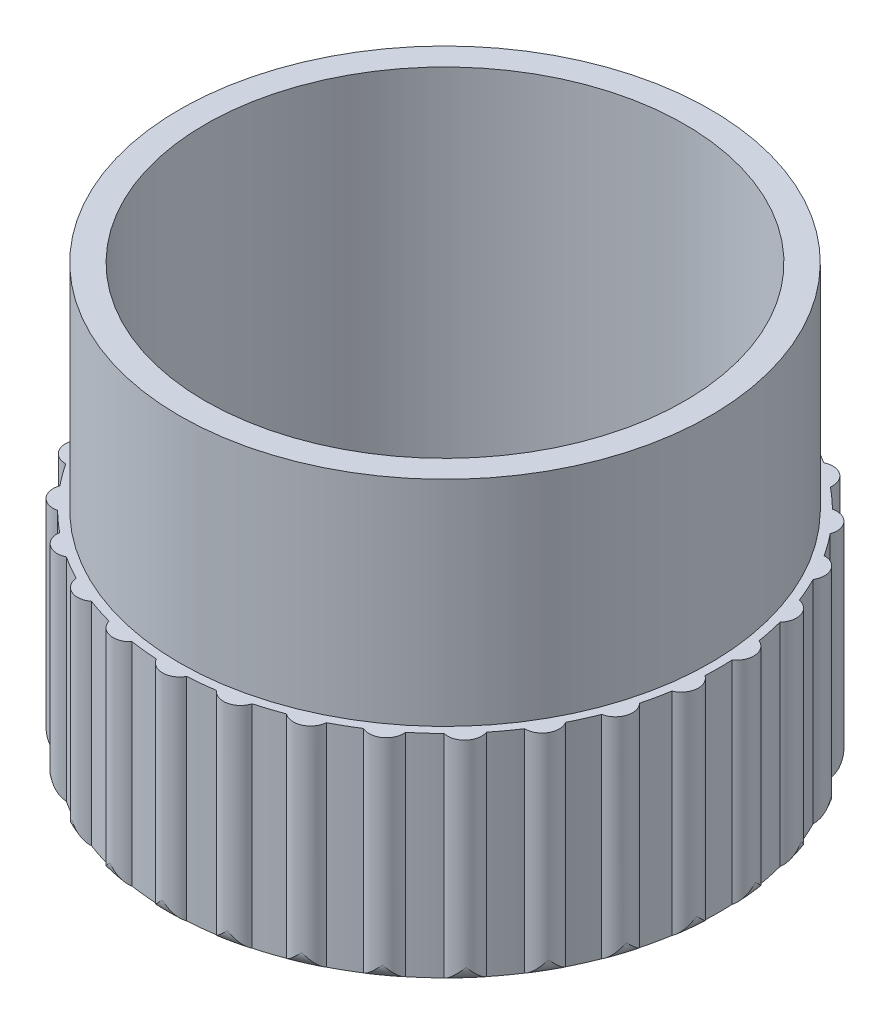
ISO-10303-21;
HEADER;
FILE_DESCRIPTION(('STEP AP214'),'2;1');
FILE_NAME('part.step','',(''),(''),'','','');
FILE_SCHEMA(('AUTOMOTIVE_DESIGN { 1 0 10303 214 1 1 1 1 }'));
ENDSEC;
DATA;
#1=APPLICATION_CONTEXT('core data for automotive mechanical design processes');
#2=APPLICATION_PROTOCOL_DEFINITION('international standard','automotive_design',2000,#1);
#3=PRODUCT_CONTEXT('',#1,'mechanical');
#4=PRODUCT('Part','Part','',(#3));
#5=PRODUCT_RELATED_PRODUCT_CATEGORY('part','',(#4));
#6=PRODUCT_DEFINITION_FORMATION('','',#4);
#7=PRODUCT_DEFINITION_CONTEXT('part definition',#1,'design');
#8=PRODUCT_DEFINITION('design','',#6,#7);
#9=PRODUCT_DEFINITION_SHAPE('','',#8);
#10=(LENGTH_UNIT() NAMED_UNIT(*) SI_UNIT(.MILLI.,.METRE.));
#11=(NAMED_UNIT(*) PLANE_ANGLE_UNIT() SI_UNIT($,.RADIAN.));
#12=(NAMED_UNIT(*) SI_UNIT($,.STERADIAN.) SOLID_ANGLE_UNIT());
#13=UNCERTAINTY_MEASURE_WITH_UNIT(LENGTH_MEASURE(1.E-05),#10,'distance_accuracy_value','');
#14=(GEOMETRIC_REPRESENTATION_CONTEXT(3) GLOBAL_UNCERTAINTY_ASSIGNED_CONTEXT((#13)) GLOBAL_UNIT_ASSIGNED_CONTEXT((#10,
#11,#12)) REPRESENTATION_CONTEXT('',''));
#15=CARTESIAN_POINT('',(0.,0.,0.));
#16=DIRECTION('',(0.,0.,1.));
#17=DIRECTION('',(1.,0.,0.));
#18=AXIS2_PLACEMENT_3D('',#15,#16,#17);
#19=CARTESIAN_POINT('',(0.,3.00000000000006,0.));
#20=DIRECTION('',(0.,1.,0.));
#21=DIRECTION('',(0.,0.,1.));
#22=AXIS2_PLACEMENT_3D('',#19,#20,#21);
#23=CYLINDRICAL_SURFACE('',#22,32.);
#24=DIRECTION('',(0.,-1.,0.));
#25=VECTOR('',#24,1.);
#26=CARTESIAN_POINT('',(-4.92245439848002,28.7284943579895,31.6191309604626));
#27=LINE('',#26,#25);
#28=CARTESIAN_POINT('',(-4.92245439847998,25.,31.6191309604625));
#29=VERTEX_POINT('',#28);
#30=CARTESIAN_POINT('',(-4.92245439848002,0.267949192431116,31.6191309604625));
#31=VERTEX_POINT('',#30);
#32=EDGE_CURVE('E1020',#29,#31,#27,.T.);
#33=ORIENTED_EDGE('',*,*,#32,.T.);
#34=CARTESIAN_POINT('',(0.,0.267949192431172,0.));
#35=DIRECTION('',(0.,1.,0.));
#36=DIRECTION('',(0.,0.,1.));
#37=AXIS2_PLACEMENT_3D('',#34,#35,#36);
#38=CIRCLE('',#37,32.);
#39=CARTESIAN_POINT('',(-1.75910002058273,0.267949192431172,31.9516129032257));
#40=VERTEX_POINT('',#39);
#41=EDGE_CURVE('E64',#31,#40,#38,.T.);
#42=ORIENTED_EDGE('',*,*,#41,.T.);
#43=DIRECTION('',(0.,-1.,0.));
#44=VECTOR('',#43,1.);
#45=CARTESIAN_POINT('',(-1.75910002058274,28.6710825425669,31.9516129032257));
#46=LINE('',#45,#44);
#47=CARTESIAN_POINT('',(-1.75910002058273,25.,31.9516129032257));
#48=VERTEX_POINT('',#47);
#49=EDGE_CURVE('E1340',#48,#40,#46,.T.);
#50=ORIENTED_EDGE('',*,*,#49,.F.);
#51=CARTESIAN_POINT('',(0.,25.0000000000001,0.));
#52=DIRECTION('',(0.,1.,0.));
#53=DIRECTION('',(0.,0.,1.));
#54=AXIS2_PLACEMENT_3D('',#51,#52,#53);
#55=CIRCLE('',#54,32.);
#56=EDGE_CURVE('E1361',#29,#48,#55,.T.);
#57=ORIENTED_EDGE('',*,*,#56,.F.);
#58=EDGE_LOOP('',(#33,#42,#50,#57));
#59=FACE_BOUND('',#58,.T.);
#60=ADVANCED_FACE('F42',(#59),#23,.T.);
#61=DIRECTION('',(0.,-1.,0.));
#62=VECTOR('',#61,1.);
#63=CARTESIAN_POINT('',(-11.3888739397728,28.7065200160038,29.9047412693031));
#64=LINE('',#63,#62);
#65=CARTESIAN_POINT('',(-11.3888739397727,25.,29.9047412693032));
#66=VERTEX_POINT('',#65);
#67=CARTESIAN_POINT('',(-11.3888739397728,0.267949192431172,29.9047412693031));
#68=VERTEX_POINT('',#67);
#69=EDGE_CURVE('E1023',#66,#68,#64,.T.);
#70=ORIENTED_EDGE('',*,*,#69,.T.);
#71=CARTESIAN_POINT('',(0.,0.267949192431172,0.));
#72=DIRECTION('',(0.,1.,0.));
#73=DIRECTION('',(0.,0.,1.));
#74=AXIS2_PLACEMENT_3D('',#71,#72,#73);
#75=CIRCLE('',#74,32.);
#76=CARTESIAN_POINT('',(-8.36377332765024,0.267949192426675,30.8876560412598));
#77=VERTEX_POINT('',#76);
#78=EDGE_CURVE('E1976',#68,#77,#75,.T.);
#79=ORIENTED_EDGE('',*,*,#78,.T.);
#80=DIRECTION('',(0.,-1.,0.));
#81=VECTOR('',#80,1.);
#82=CARTESIAN_POINT('',(-8.3637733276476,28.7284943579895,30.8876560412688));
#83=LINE('',#82,#81);
#84=CARTESIAN_POINT('',(-8.36377332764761,25.,30.8876560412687));
#85=VERTEX_POINT('',#84);
#86=EDGE_CURVE('E1024',#85,#77,#83,.T.);
#87=ORIENTED_EDGE('',*,*,#86,.F.);
#88=EDGE_CURVE('E1373',#66,#85,#55,.T.);
#89=ORIENTED_EDGE('',*,*,#88,.F.);
#90=EDGE_LOOP('',(#70,#79,#87,#89));
#91=FACE_BOUND('',#90,.T.);
#92=ADVANCED_FACE('F1994',(#91),#23,.T.);
#93=DIRECTION('',(0.,-1.,0.));
#94=VECTOR('',#93,1.);
#95=CARTESIAN_POINT('',(-17.3575450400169,28.6506842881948,26.8833708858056));
#96=LINE('',#95,#94);
#97=CARTESIAN_POINT('',(-17.3575450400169,25.,26.8833708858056));
#98=VERTEX_POINT('',#97);
#99=CARTESIAN_POINT('',(-17.357545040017,0.267949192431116,26.8833708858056));
#100=VERTEX_POINT('',#99);
#101=EDGE_CURVE('E1034',#98,#100,#96,.T.);
#102=ORIENTED_EDGE('',*,*,#101,.T.);
#103=CARTESIAN_POINT('',(0.,0.267949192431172,0.));
#104=DIRECTION('',(0.,1.,0.));
#105=DIRECTION('',(0.,0.,1.));
#106=AXIS2_PLACEMENT_3D('',#103,#104,#105);
#107=CIRCLE('',#106,32.);
#108=CARTESIAN_POINT('',(-14.6029096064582,0.267949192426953,28.4737603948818));
#109=VERTEX_POINT('',#108);
#110=EDGE_CURVE('E1959',#100,#109,#107,.T.);
#111=ORIENTED_EDGE('',*,*,#110,.T.);
#112=DIRECTION('',(0.,-1.,0.));
#113=VECTOR('',#112,1.);
#114=CARTESIAN_POINT('',(-14.6029096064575,28.7065200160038,28.4737603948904));
#115=LINE('',#114,#113);
#116=CARTESIAN_POINT('',(-14.6029096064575,25.0000000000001,28.4737603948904));
#117=VERTEX_POINT('',#116);
#118=EDGE_CURVE('E1035',#117,#109,#115,.T.);
#119=ORIENTED_EDGE('',*,*,#118,.F.);
#120=EDGE_CURVE('E1378',#98,#117,#55,.T.);
#121=ORIENTED_EDGE('',*,*,#120,.F.);
#122=EDGE_LOOP('',(#102,#111,#119,#121));
#123=FACE_BOUND('',#122,.T.);
#124=ADVANCED_FACE('F1999',(#123),#23,.T.);
#125=DIRECTION('',(0.,-1.,0.));
#126=VECTOR('',#125,1.);
#127=CARTESIAN_POINT('',(-22.5676081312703,28.6375751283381,22.6870681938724));
#128=LINE('',#127,#126);
#129=CARTESIAN_POINT('',(-22.5676081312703,25.,22.6870681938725));
#130=VERTEX_POINT('',#129);
#131=CARTESIAN_POINT('',(-22.5676081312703,0.267949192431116,22.6870681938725));
#132=VERTEX_POINT('',#131);
#133=EDGE_CURVE('E1045',#130,#132,#128,.T.);
#134=ORIENTED_EDGE('',*,*,#133,.T.);
#135=CARTESIAN_POINT('',(0.,0.267949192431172,0.));
#136=DIRECTION('',(0.,1.,0.));
#137=DIRECTION('',(0.,0.,1.));
#138=AXIS2_PLACEMENT_3D('',#135,#136,#137);
#139=CIRCLE('',#138,32.);
#140=CARTESIAN_POINT('',(-20.2038286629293,0.267949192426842,24.8154247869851));
#141=VERTEX_POINT('',#140);
#142=EDGE_CURVE('E1938',#132,#141,#139,.T.);
#143=ORIENTED_EDGE('',*,*,#142,.T.);
#144=DIRECTION('',(0.,-1.,0.));
#145=VECTOR('',#144,1.);
#146=CARTESIAN_POINT('',(-20.2038286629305,28.6506842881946,24.8154247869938));
#147=LINE('',#146,#145);
#148=CARTESIAN_POINT('',(-20.2038286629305,25.,24.8154247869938));
#149=VERTEX_POINT('',#148);
#150=EDGE_CURVE('E1046',#149,#141,#147,.T.);
#151=ORIENTED_EDGE('',*,*,#150,.F.);
#152=EDGE_CURVE('E1383',#130,#149,#55,.T.);
#153=ORIENTED_EDGE('',*,*,#152,.F.);
#154=EDGE_LOOP('',(#134,#143,#151,#153));
#155=FACE_BOUND('',#154,.T.);
#156=ADVANCED_FACE('F2021',(#155),#23,.T.);
#157=DIRECTION('',(0.,-1.,0.));
#158=VECTOR('',#157,1.);
#159=CARTESIAN_POINT('',(-26.7913584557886,28.6759718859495,17.4992317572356));
#160=LINE('',#159,#158);
#161=CARTESIAN_POINT('',(-26.7913584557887,25.,17.4992317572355));
#162=VERTEX_POINT('',#161);
#163=CARTESIAN_POINT('',(-26.7913584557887,0.267949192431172,17.4992317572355));
#164=VERTEX_POINT('',#163);
#165=EDGE_CURVE('E1056',#162,#164,#160,.T.);
#166=ORIENTED_EDGE('',*,*,#165,.T.);
#167=CARTESIAN_POINT('',(0.,0.267949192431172,0.));
#168=DIRECTION('',(0.,1.,0.));
#169=DIRECTION('',(0.,0.,1.));
#170=AXIS2_PLACEMENT_3D('',#167,#168,#169);
#171=CIRCLE('',#170,32.);
#172=CARTESIAN_POINT('',(-24.9217434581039,0.267949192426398,20.0725360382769));
#173=VERTEX_POINT('',#172);
#174=EDGE_CURVE('E1923',#164,#173,#171,.T.);
#175=ORIENTED_EDGE('',*,*,#174,.T.);
#176=DIRECTION('',(0.,-1.,0.));
#177=VECTOR('',#176,1.);
#178=CARTESIAN_POINT('',(-24.9217434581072,28.6375751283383,20.072536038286));
#179=LINE('',#178,#177);
#180=CARTESIAN_POINT('',(-24.9217434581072,25.,20.072536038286));
#181=VERTEX_POINT('',#180);
#182=EDGE_CURVE('E1057',#181,#173,#179,.T.);
#183=ORIENTED_EDGE('',*,*,#182,.F.);
#184=EDGE_CURVE('E1388',#162,#181,#55,.T.);
#185=ORIENTED_EDGE('',*,*,#184,.F.);
#186=EDGE_LOOP('',(#166,#175,#183,#185));
#187=FACE_BOUND('',#186,.T.);
#188=ADVANCED_FACE('F2025',(#187),#23,.T.);
#189=DIRECTION('',(0.,-1.,0.));
#190=VECTOR('',#189,1.);
#191=CARTESIAN_POINT('',(-29.8441978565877,28.725670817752,11.546594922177));
#192=LINE('',#191,#190);
#193=CARTESIAN_POINT('',(-29.8441978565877,25.,11.5465949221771));
#194=VERTEX_POINT('',#193);
#195=CARTESIAN_POINT('',(-29.8441978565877,0.267949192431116,11.546594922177));
#196=VERTEX_POINT('',#195);
#197=EDGE_CURVE('E1067',#194,#196,#192,.T.);
#198=ORIENTED_EDGE('',*,*,#197,.T.);
#199=CARTESIAN_POINT('',(0.,0.267949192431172,0.));
#200=DIRECTION('',(0.,1.,0.));
#201=DIRECTION('',(0.,0.,1.));
#202=AXIS2_PLACEMENT_3D('',#199,#200,#201);
#203=CIRCLE('',#202,32.);
#204=CARTESIAN_POINT('',(-28.5504584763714,0.267949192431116,14.4523811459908));
#205=VERTEX_POINT('',#204);
#206=EDGE_CURVE('E1902',#196,#205,#203,.T.);
#207=ORIENTED_EDGE('',*,*,#206,.T.);
#208=DIRECTION('',(0.,-1.,0.));
#209=VECTOR('',#208,1.);
#210=CARTESIAN_POINT('',(-28.5504584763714,28.6759718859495,14.4523811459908));
#211=LINE('',#210,#209);
#212=CARTESIAN_POINT('',(-28.5504584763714,25.,14.4523811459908));
#213=VERTEX_POINT('',#212);
#214=EDGE_CURVE('E1068',#213,#205,#211,.T.);
#215=ORIENTED_EDGE('',*,*,#214,.F.);
#216=EDGE_CURVE('E1393',#194,#213,#55,.T.);
#217=ORIENTED_EDGE('',*,*,#216,.F.);
#218=EDGE_LOOP('',(#198,#207,#215,#217));
#219=FACE_BOUND('',#218,.T.);
#220=ADVANCED_FACE('F2029',(#219),#23,.T.);
#221=DIRECTION('',(0.,-1.,0.));
#222=VECTOR('',#221,1.);
#223=CARTESIAN_POINT('',(-31.5927026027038,28.711312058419,5.0893164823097));
#224=LINE('',#223,#222);
#225=CARTESIAN_POINT('',(-31.5927026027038,25.,5.08931648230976));
#226=VERTEX_POINT('',#225);
#227=CARTESIAN_POINT('',(-31.5927026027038,0.267949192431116,5.0893164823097));
#228=VERTEX_POINT('',#227);
#229=EDGE_CURVE('E1078',#226,#228,#224,.T.);
#230=ORIENTED_EDGE('',*,*,#229,.T.);
#231=CARTESIAN_POINT('',(0.,0.267949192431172,0.));
#232=DIRECTION('',(0.,1.,0.));
#233=DIRECTION('',(0.,0.,1.));
#234=AXIS2_PLACEMENT_3D('',#231,#232,#233);
#235=CIRCLE('',#234,32.);
#236=CARTESIAN_POINT('',(-30.9313814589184,0.267949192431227,8.20058784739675));
#237=VERTEX_POINT('',#236);
#238=EDGE_CURVE('E1887',#228,#237,#235,.T.);
#239=ORIENTED_EDGE('',*,*,#238,.T.);
#240=DIRECTION('',(0.,-1.,0.));
#241=VECTOR('',#240,1.);
#242=CARTESIAN_POINT('',(-30.9313814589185,28.7256708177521,8.20058784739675));
#243=LINE('',#242,#241);
#244=CARTESIAN_POINT('',(-30.9313814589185,25.,8.20058784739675));
#245=VERTEX_POINT('',#244);
#246=EDGE_CURVE('E1079',#245,#237,#243,.T.);
#247=ORIENTED_EDGE('',*,*,#246,.F.);
#248=EDGE_CURVE('E1398',#226,#245,#55,.T.);
#249=ORIENTED_EDGE('',*,*,#248,.F.);
#250=EDGE_LOOP('',(#230,#239,#247,#249));
#251=FACE_BOUND('',#250,.T.);
#252=ADVANCED_FACE('F2033',(#251),#23,.T.);
#253=DIRECTION('',(0.,-1.,0.));
#254=VECTOR('',#253,1.);
#255=CARTESIAN_POINT('',(-31.9604546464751,28.7113120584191,-1.59038950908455));
#256=LINE('',#255,#254);
#257=CARTESIAN_POINT('',(-31.9604546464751,25.,-1.59038950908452));
#258=VERTEX_POINT('',#257);
#259=CARTESIAN_POINT('',(-31.9604546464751,0.267949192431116,-1.59038950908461));
#260=VERTEX_POINT('',#259);
#261=EDGE_CURVE('E1089',#258,#260,#256,.T.);
#262=ORIENTED_EDGE('',*,*,#261,.T.);
#263=CARTESIAN_POINT('',(0.,0.267949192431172,0.));
#264=DIRECTION('',(0.,1.,0.));
#265=DIRECTION('',(0.,0.,1.));
#266=AXIS2_PLACEMENT_3D('',#263,#264,#265);
#267=CIRCLE('',#266,32.);
#268=CARTESIAN_POINT('',(-31.960454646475,0.267949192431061,1.59038950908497));
#269=VERTEX_POINT('',#268);
#270=EDGE_CURVE('E1869',#260,#269,#267,.T.);
#271=ORIENTED_EDGE('',*,*,#270,.T.);
#272=DIRECTION('',(0.,-1.,0.));
#273=VECTOR('',#272,1.);
#274=CARTESIAN_POINT('',(-31.9604546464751,28.711312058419,1.59038950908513));
#275=LINE('',#274,#273);
#276=CARTESIAN_POINT('',(-31.9604546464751,25.,1.59038950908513));
#277=VERTEX_POINT('',#276);
#278=EDGE_CURVE('E1090',#277,#269,#275,.T.);
#279=ORIENTED_EDGE('',*,*,#278,.F.);
#280=EDGE_CURVE('E1403',#258,#277,#55,.T.);
#281=ORIENTED_EDGE('',*,*,#280,.F.);
#282=EDGE_LOOP('',(#262,#271,#279,#281));
#283=FACE_BOUND('',#282,.T.);
#284=ADVANCED_FACE('F2037',(#283),#23,.T.);
#285=DIRECTION('',(0.,-1.,0.));
#286=VECTOR('',#285,1.);
#287=CARTESIAN_POINT('',(-30.9313814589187,28.7256708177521,-8.20058784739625));
#288=LINE('',#287,#286);
#289=CARTESIAN_POINT('',(-30.9313814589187,25.,-8.20058784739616));
#290=VERTEX_POINT('',#289);
#291=CARTESIAN_POINT('',(-30.9313814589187,0.267949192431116,-8.20058784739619));
#292=VERTEX_POINT('',#291);
#293=EDGE_CURVE('E1100',#290,#292,#288,.T.);
#294=ORIENTED_EDGE('',*,*,#293,.T.);
#295=CARTESIAN_POINT('',(0.,0.267949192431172,0.));
#296=DIRECTION('',(0.,1.,0.));
#297=DIRECTION('',(0.,0.,1.));
#298=AXIS2_PLACEMENT_3D('',#295,#296,#297);
#299=CIRCLE('',#298,32.);
#300=CARTESIAN_POINT('',(-31.5927026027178,0.267949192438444,-5.08931648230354));
#301=VERTEX_POINT('',#300);
#302=EDGE_CURVE('E1855',#292,#301,#299,.T.);
#303=ORIENTED_EDGE('',*,*,#302,.T.);
#304=DIRECTION('',(0.,-1.,0.));
#305=VECTOR('',#304,1.);
#306=CARTESIAN_POINT('',(-31.5927026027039,28.7113120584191,-5.08931648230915));
#307=LINE('',#306,#305);
#308=CARTESIAN_POINT('',(-31.5927026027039,25.,-5.08931648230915));
#309=VERTEX_POINT('',#308);
#310=EDGE_CURVE('E1101',#309,#301,#307,.T.);
#311=ORIENTED_EDGE('',*,*,#310,.F.);
#312=EDGE_CURVE('E1408',#290,#309,#55,.T.);
#313=ORIENTED_EDGE('',*,*,#312,.F.);
#314=EDGE_LOOP('',(#294,#303,#311,#313));
#315=FACE_BOUND('',#314,.T.);
#316=ADVANCED_FACE('F2041',(#315),#23,.T.);
#317=DIRECTION('',(0.,-1.,0.));
#318=VECTOR('',#317,1.);
#319=CARTESIAN_POINT('',(-28.5504584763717,28.6759718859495,-14.4523811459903));
#320=LINE('',#319,#318);
#321=CARTESIAN_POINT('',(-28.5504584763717,25.0000000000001,-14.4523811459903));
#322=VERTEX_POINT('',#321);
#323=CARTESIAN_POINT('',(-28.5504584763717,0.267949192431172,-14.4523811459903));
#324=VERTEX_POINT('',#323);
#325=EDGE_CURVE('E1111',#322,#324,#320,.T.);
#326=ORIENTED_EDGE('',*,*,#325,.T.);
#327=CARTESIAN_POINT('',(0.,0.267949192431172,0.));
#328=DIRECTION('',(0.,1.,0.));
#329=DIRECTION('',(0.,0.,1.));
#330=AXIS2_PLACEMENT_3D('',#327,#328,#329);
#331=CIRCLE('',#330,32.);
#332=CARTESIAN_POINT('',(-29.8441978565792,0.267949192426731,-11.5465949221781));
#333=VERTEX_POINT('',#332);
#334=EDGE_CURVE('E1839',#324,#333,#331,.T.);
#335=ORIENTED_EDGE('',*,*,#334,.T.);
#336=DIRECTION('',(0.,-1.,0.));
#337=VECTOR('',#336,1.);
#338=CARTESIAN_POINT('',(-29.8441978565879,28.7256708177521,-11.5465949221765));
#339=LINE('',#338,#337);
#340=CARTESIAN_POINT('',(-29.844197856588,25.0000000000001,-11.5465949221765));
#341=VERTEX_POINT('',#340);
#342=EDGE_CURVE('E1112',#341,#333,#339,.T.);
#343=ORIENTED_EDGE('',*,*,#342,.F.);
#344=EDGE_CURVE('E1413',#322,#341,#55,.T.);
#345=ORIENTED_EDGE('',*,*,#344,.F.);
#346=EDGE_LOOP('',(#326,#335,#343,#345));
#347=FACE_BOUND('',#346,.T.);
#348=ADVANCED_FACE('F2045',(#347),#23,.T.);
#349=DIRECTION('',(0.,-1.,0.));
#350=VECTOR('',#349,1.);
#351=CARTESIAN_POINT('',(-24.9217434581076,28.6375751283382,-20.0725360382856));
#352=LINE('',#351,#350);
#353=CARTESIAN_POINT('',(-24.9217434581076,25.0000000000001,-20.0725360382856));
#354=VERTEX_POINT('',#353);
#355=CARTESIAN_POINT('',(-24.9217434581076,0.267949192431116,-20.0725360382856));
#356=VERTEX_POINT('',#355);
#357=EDGE_CURVE('E1122',#354,#356,#352,.T.);
#358=ORIENTED_EDGE('',*,*,#357,.T.);
#359=CARTESIAN_POINT('',(0.,0.267949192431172,0.));
#360=DIRECTION('',(0.,1.,0.));
#361=DIRECTION('',(0.,0.,1.));
#362=AXIS2_PLACEMENT_3D('',#359,#360,#361);
#363=CIRCLE('',#362,32.);
#364=CARTESIAN_POINT('',(-26.7913584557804,0.267949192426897,-17.4992317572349));
#365=VERTEX_POINT('',#364);
#366=EDGE_CURVE('E1825',#356,#365,#363,.T.);
#367=ORIENTED_EDGE('',*,*,#366,.T.);
#368=DIRECTION('',(0.,-1.,0.));
#369=VECTOR('',#368,1.);
#370=CARTESIAN_POINT('',(-26.791358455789,28.6759718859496,-17.4992317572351));
#371=LINE('',#370,#369);
#372=CARTESIAN_POINT('',(-26.791358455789,25.,-17.4992317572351));
#373=VERTEX_POINT('',#372);
#374=EDGE_CURVE('E1123',#373,#365,#371,.T.);
#375=ORIENTED_EDGE('',*,*,#374,.F.);
#376=EDGE_CURVE('E1418',#354,#373,#55,.T.);
#377=ORIENTED_EDGE('',*,*,#376,.F.);
#378=EDGE_LOOP('',(#358,#367,#375,#377));
#379=FACE_BOUND('',#378,.T.);
#380=ADVANCED_FACE('F2049',(#379),#23,.T.);
#381=DIRECTION('',(0.,-1.,0.));
#382=VECTOR('',#381,1.);
#383=CARTESIAN_POINT('',(-20.203828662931,28.6506842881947,-24.8154247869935));
#384=LINE('',#383,#382);
#385=CARTESIAN_POINT('',(-20.203828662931,24.9999999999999,-24.8154247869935));
#386=VERTEX_POINT('',#385);
#387=CARTESIAN_POINT('',(-20.203828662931,0.267949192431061,-24.8154247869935));
#388=VERTEX_POINT('',#387);
#389=EDGE_CURVE('E1133',#386,#388,#384,.T.);
#390=ORIENTED_EDGE('',*,*,#389,.T.);
#391=CARTESIAN_POINT('',(0.,0.267949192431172,0.));
#392=DIRECTION('',(0.,1.,0.));
#393=DIRECTION('',(0.,0.,1.));
#394=AXIS2_PLACEMENT_3D('',#391,#392,#393);
#395=CIRCLE('',#394,32.);
#396=CARTESIAN_POINT('',(-22.567608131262,0.267949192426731,-22.68706819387));
#397=VERTEX_POINT('',#396);
#398=EDGE_CURVE('E1809',#388,#397,#395,.T.);
#399=ORIENTED_EDGE('',*,*,#398,.T.);
#400=DIRECTION('',(0.,-1.,0.));
#401=VECTOR('',#400,1.);
#402=CARTESIAN_POINT('',(-22.5676081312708,28.6375751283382,-22.6870681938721));
#403=LINE('',#402,#401);
#404=CARTESIAN_POINT('',(-22.5676081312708,25.,-22.6870681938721));
#405=VERTEX_POINT('',#404);
#406=EDGE_CURVE('E1134',#405,#397,#403,.T.);
#407=ORIENTED_EDGE('',*,*,#406,.F.);
#408=EDGE_CURVE('E1423',#386,#405,#55,.T.);
#409=ORIENTED_EDGE('',*,*,#408,.F.);
#410=EDGE_LOOP('',(#390,#399,#407,#409));
#411=FACE_BOUND('',#410,.T.);
#412=ADVANCED_FACE('F2053',(#411),#23,.T.);
#413=DIRECTION('',(0.,-1.,0.));
#414=VECTOR('',#413,1.);
#415=CARTESIAN_POINT('',(-14.6029096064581,28.7065200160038,-28.4737603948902));
#416=LINE('',#415,#414);
#417=CARTESIAN_POINT('',(-14.602909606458,25.,-28.4737603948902));
#418=VERTEX_POINT('',#417);
#419=CARTESIAN_POINT('',(-14.6029096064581,0.267949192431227,-28.4737603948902));
#420=VERTEX_POINT('',#419);
#421=EDGE_CURVE('E1144',#418,#420,#416,.T.);
#422=ORIENTED_EDGE('',*,*,#421,.T.);
#423=CARTESIAN_POINT('',(0.,0.267949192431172,0.));
#424=DIRECTION('',(0.,1.,0.));
#425=DIRECTION('',(0.,0.,1.));
#426=AXIS2_PLACEMENT_3D('',#423,#424,#425);
#427=CIRCLE('',#426,32.);
#428=CARTESIAN_POINT('',(-17.3575450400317,0.267949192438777,-26.8833708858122));
#429=VERTEX_POINT('',#428);
#430=EDGE_CURVE('E1795',#420,#429,#427,.T.);
#431=ORIENTED_EDGE('',*,*,#430,.T.);
#432=DIRECTION('',(0.,-1.,0.));
#433=VECTOR('',#432,1.);
#434=CARTESIAN_POINT('',(-17.3575450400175,28.6506842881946,-26.8833708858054));
#435=LINE('',#434,#433);
#436=CARTESIAN_POINT('',(-17.3575450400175,25.,-26.8833708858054));
#437=VERTEX_POINT('',#436);
#438=EDGE_CURVE('E1145',#437,#429,#435,.T.);
#439=ORIENTED_EDGE('',*,*,#438,.F.);
#440=EDGE_CURVE('E1428',#418,#437,#55,.T.);
#441=ORIENTED_EDGE('',*,*,#440,.F.);
#442=EDGE_LOOP('',(#422,#431,#439,#441));
#443=FACE_BOUND('',#442,.T.);
#444=ADVANCED_FACE('F2057',(#443),#23,.T.);
#445=DIRECTION('',(0.,-1.,0.));
#446=VECTOR('',#445,1.);
#447=CARTESIAN_POINT('',(-8.36377332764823,28.7284943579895,-30.8876560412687));
#448=LINE('',#447,#446);
#449=CARTESIAN_POINT('',(-8.36377332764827,25.,-30.8876560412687));
#450=VERTEX_POINT('',#449);
#451=CARTESIAN_POINT('',(-8.36377332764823,0.267949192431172,-30.8876560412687));
#452=VERTEX_POINT('',#451);
#453=EDGE_CURVE('E1155',#450,#452,#448,.T.);
#454=ORIENTED_EDGE('',*,*,#453,.T.);
#455=CARTESIAN_POINT('',(0.,0.267949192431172,0.));
#456=DIRECTION('',(0.,1.,0.));
#457=DIRECTION('',(0.,0.,1.));
#458=AXIS2_PLACEMENT_3D('',#455,#456,#457);
#459=CIRCLE('',#458,32.);
#460=CARTESIAN_POINT('',(-11.3888739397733,0.267949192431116,-29.904741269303));
#461=VERTEX_POINT('',#460);
#462=EDGE_CURVE('E1779',#452,#461,#459,.T.);
#463=ORIENTED_EDGE('',*,*,#462,.T.);
#464=DIRECTION('',(0.,-1.,0.));
#465=VECTOR('',#464,1.);
#466=CARTESIAN_POINT('',(-11.3888739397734,28.7065200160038,-29.904741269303));
#467=LINE('',#466,#465);
#468=CARTESIAN_POINT('',(-11.3888739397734,25.0000000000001,-29.904741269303));
#469=VERTEX_POINT('',#468);
#470=EDGE_CURVE('E1156',#469,#461,#467,.T.);
#471=ORIENTED_EDGE('',*,*,#470,.F.);
#472=EDGE_CURVE('E1433',#450,#469,#55,.T.);
#473=ORIENTED_EDGE('',*,*,#472,.F.);
#474=EDGE_LOOP('',(#454,#463,#471,#473));
#475=FACE_BOUND('',#474,.T.);
#476=ADVANCED_FACE('F2061',(#475),#23,.T.);
#477=DIRECTION('',(0.,-1.,0.));
#478=VECTOR('',#477,1.);
#479=CARTESIAN_POINT('',(-1.75910002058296,28.6710825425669,-31.9516129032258));
#480=LINE('',#479,#478);
#481=CARTESIAN_POINT('',(-1.759100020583,25.0000000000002,-31.9516129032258));
#482=VERTEX_POINT('',#481);
#483=CARTESIAN_POINT('',(-1.75910002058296,0.267949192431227,-31.9516129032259));
#484=VERTEX_POINT('',#483);
#485=EDGE_CURVE('E1166',#482,#484,#480,.T.);
#486=ORIENTED_EDGE('',*,*,#485,.T.);
#487=CARTESIAN_POINT('',(0.,0.267949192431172,0.));
#488=DIRECTION('',(0.,1.,0.));
#489=DIRECTION('',(0.,0.,1.));
#490=AXIS2_PLACEMENT_3D('',#487,#488,#489);
#491=CIRCLE('',#490,32.);
#492=CARTESIAN_POINT('',(-4.92245439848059,0.267949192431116,-31.6191309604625));
#493=VERTEX_POINT('',#492);
#494=EDGE_CURVE('E519',#484,#493,#491,.T.);
#495=ORIENTED_EDGE('',*,*,#494,.T.);
#496=DIRECTION('',(0.,-1.,0.));
#497=VECTOR('',#496,1.);
#498=CARTESIAN_POINT('',(-4.92245439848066,28.7284943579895,-31.6191309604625));
#499=LINE('',#498,#497);
#500=CARTESIAN_POINT('',(-4.92245439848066,25.0000000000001,-31.6191309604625));
#501=VERTEX_POINT('',#500);
#502=EDGE_CURVE('E1167',#501,#493,#499,.T.);
#503=ORIENTED_EDGE('',*,*,#502,.F.);
#504=EDGE_CURVE('E1438',#482,#501,#55,.T.);
#505=ORIENTED_EDGE('',*,*,#504,.F.);
#506=EDGE_LOOP('',(#486,#495,#503,#505));
#507=FACE_BOUND('',#506,.T.);
#508=ADVANCED_FACE('F2067',(#507),#23,.T.);
#509=DIRECTION('',(0.,-1.,0.));
#510=VECTOR('',#509,1.);
#511=CARTESIAN_POINT('',(4.92245439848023,28.7284943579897,-31.6191309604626));
#512=LINE('',#511,#510);
#513=CARTESIAN_POINT('',(4.92245439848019,25.0000000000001,-31.6191309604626));
#514=VERTEX_POINT('',#513);
#515=CARTESIAN_POINT('',(4.92245439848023,0.267949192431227,-31.6191309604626));
#516=VERTEX_POINT('',#515);
#517=EDGE_CURVE('E1177',#514,#516,#512,.T.);
#518=ORIENTED_EDGE('',*,*,#517,.T.);
#519=CARTESIAN_POINT('',(0.,0.267949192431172,0.));
#520=DIRECTION('',(0.,1.,0.));
#521=DIRECTION('',(0.,0.,1.));
#522=AXIS2_PLACEMENT_3D('',#519,#520,#521);
#523=CIRCLE('',#522,32.);
#524=CARTESIAN_POINT('',(1.75910002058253,0.267949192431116,-31.9516129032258));
#525=VERTEX_POINT('',#524);
#526=EDGE_CURVE('E1628',#516,#525,#523,.T.);
#527=ORIENTED_EDGE('',*,*,#526,.T.);
#528=DIRECTION('',(0.,-1.,0.));
#529=VECTOR('',#528,1.);
#530=CARTESIAN_POINT('',(1.7591000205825,28.6710825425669,-31.9516129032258));
#531=LINE('',#530,#529);
#532=CARTESIAN_POINT('',(1.7591000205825,25.,-31.9516129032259));
#533=VERTEX_POINT('',#532);
#534=EDGE_CURVE('E528',#533,#525,#531,.T.);
#535=ORIENTED_EDGE('',*,*,#534,.F.);
#536=EDGE_CURVE('E1443',#514,#533,#55,.T.);
#537=ORIENTED_EDGE('',*,*,#536,.F.);
#538=EDGE_LOOP('',(#518,#527,#535,#537));
#539=FACE_BOUND('',#538,.T.);
#540=ADVANCED_FACE('F1627',(#539),#23,.T.);
#541=DIRECTION('',(0.,-1.,0.));
#542=VECTOR('',#541,1.);
#543=CARTESIAN_POINT('',(11.3888739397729,28.7065200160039,-29.9047412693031));
#544=LINE('',#543,#542);
#545=CARTESIAN_POINT('',(11.3888739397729,25.,-29.9047412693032));
#546=VERTEX_POINT('',#545);
#547=CARTESIAN_POINT('',(11.3888739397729,0.267949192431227,-29.9047412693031));
#548=VERTEX_POINT('',#547);
#549=EDGE_CURVE('E1185',#546,#548,#544,.T.);
#550=ORIENTED_EDGE('',*,*,#549,.T.);
#551=CARTESIAN_POINT('',(0.,0.267949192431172,0.));
#552=DIRECTION('',(0.,1.,0.));
#553=DIRECTION('',(0.,0.,1.));
#554=AXIS2_PLACEMENT_3D('',#551,#552,#553);
#555=CIRCLE('',#554,32.);
#556=CARTESIAN_POINT('',(8.36377332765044,0.267949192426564,-30.8876560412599));
#557=VERTEX_POINT('',#556);
#558=EDGE_CURVE('E1620',#548,#557,#555,.T.);
#559=ORIENTED_EDGE('',*,*,#558,.T.);
#560=DIRECTION('',(0.,-1.,0.));
#561=VECTOR('',#560,1.);
#562=CARTESIAN_POINT('',(8.3637733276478,28.7284943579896,-30.8876560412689));
#563=LINE('',#562,#561);
#564=CARTESIAN_POINT('',(8.3637733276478,25.0000000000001,-30.8876560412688));
#565=VERTEX_POINT('',#564);
#566=EDGE_CURVE('E1186',#565,#557,#563,.T.);
#567=ORIENTED_EDGE('',*,*,#566,.F.);
#568=EDGE_CURVE('E1448',#546,#565,#55,.T.);
#569=ORIENTED_EDGE('',*,*,#568,.F.);
#570=EDGE_LOOP('',(#550,#559,#567,#569));
#571=FACE_BOUND('',#570,.T.);
#572=ADVANCED_FACE('F1619',(#571),#23,.T.);
#573=DIRECTION('',(0.,-1.,0.));
#574=VECTOR('',#573,1.);
#575=CARTESIAN_POINT('',(17.3575450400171,28.6506842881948,-26.8833708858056));
#576=LINE('',#575,#574);
#577=CARTESIAN_POINT('',(17.3575450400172,25.,-26.8833708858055));
#578=VERTEX_POINT('',#577);
#579=CARTESIAN_POINT('',(17.3575450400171,0.267949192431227,-26.8833708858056));
#580=VERTEX_POINT('',#579);
#581=EDGE_CURVE('E1196',#578,#580,#576,.T.);
#582=ORIENTED_EDGE('',*,*,#581,.T.);
#583=CARTESIAN_POINT('',(0.,0.267949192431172,0.));
#584=DIRECTION('',(0.,1.,0.));
#585=DIRECTION('',(0.,0.,1.));
#586=AXIS2_PLACEMENT_3D('',#583,#584,#585);
#587=CIRCLE('',#586,32.);
#588=CARTESIAN_POINT('',(14.6029096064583,0.267949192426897,-28.4737603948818));
#589=VERTEX_POINT('',#588);
#590=EDGE_CURVE('E1610',#580,#589,#587,.T.);
#591=ORIENTED_EDGE('',*,*,#590,.T.);
#592=DIRECTION('',(0.,-1.,0.));
#593=VECTOR('',#592,1.);
#594=CARTESIAN_POINT('',(14.6029096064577,28.7065200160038,-28.4737603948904));
#595=LINE('',#594,#593);
#596=CARTESIAN_POINT('',(14.6029096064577,25.,-28.4737603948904));
#597=VERTEX_POINT('',#596);
#598=EDGE_CURVE('E1197',#597,#589,#595,.T.);
#599=ORIENTED_EDGE('',*,*,#598,.F.);
#600=EDGE_CURVE('E1453',#578,#597,#55,.T.);
#601=ORIENTED_EDGE('',*,*,#600,.F.);
#602=EDGE_LOOP('',(#582,#591,#599,#601));
#603=FACE_BOUND('',#602,.T.);
#604=ADVANCED_FACE('F1609',(#603),#23,.T.);
#605=DIRECTION('',(0.,-1.,0.));
#606=VECTOR('',#605,1.);
#607=CARTESIAN_POINT('',(22.5676081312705,28.6375751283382,-22.6870681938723));
#608=LINE('',#607,#606);
#609=CARTESIAN_POINT('',(22.5676081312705,25.,-22.6870681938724));
#610=VERTEX_POINT('',#609);
#611=CARTESIAN_POINT('',(22.5676081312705,0.267949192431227,-22.6870681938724));
#612=VERTEX_POINT('',#611);
#613=EDGE_CURVE('E1207',#610,#612,#608,.T.);
#614=ORIENTED_EDGE('',*,*,#613,.T.);
#615=CARTESIAN_POINT('',(0.,0.267949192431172,0.));
#616=DIRECTION('',(0.,1.,0.));
#617=DIRECTION('',(0.,0.,1.));
#618=AXIS2_PLACEMENT_3D('',#615,#616,#617);
#619=CIRCLE('',#618,32.);
#620=CARTESIAN_POINT('',(20.2038286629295,0.267949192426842,-24.8154247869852));
#621=VERTEX_POINT('',#620);
#622=EDGE_CURVE('E1600',#612,#621,#619,.T.);
#623=ORIENTED_EDGE('',*,*,#622,.T.);
#624=DIRECTION('',(0.,-1.,0.));
#625=VECTOR('',#624,1.);
#626=CARTESIAN_POINT('',(20.2038286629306,28.6506842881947,-24.8154247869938));
#627=LINE('',#626,#625);
#628=CARTESIAN_POINT('',(20.2038286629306,25.0000000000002,-24.8154247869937));
#629=VERTEX_POINT('',#628);
#630=EDGE_CURVE('E1208',#629,#621,#627,.T.);
#631=ORIENTED_EDGE('',*,*,#630,.F.);
#632=EDGE_CURVE('E1458',#610,#629,#55,.T.);
#633=ORIENTED_EDGE('',*,*,#632,.F.);
#634=EDGE_LOOP('',(#614,#623,#631,#633));
#635=FACE_BOUND('',#634,.T.);
#636=ADVANCED_FACE('F1599',(#635),#23,.T.);
#637=DIRECTION('',(0.,-1.,0.));
#638=VECTOR('',#637,1.);
#639=CARTESIAN_POINT('',(26.7913584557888,28.6759718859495,-17.4992317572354));
#640=LINE('',#639,#638);
#641=CARTESIAN_POINT('',(26.7913584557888,25.0000000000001,-17.4992317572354));
#642=VERTEX_POINT('',#641);
#643=CARTESIAN_POINT('',(26.7913584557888,0.267949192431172,-17.4992317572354));
#644=VERTEX_POINT('',#643);
#645=EDGE_CURVE('E1218',#642,#644,#640,.T.);
#646=ORIENTED_EDGE('',*,*,#645,.T.);
#647=CARTESIAN_POINT('',(0.,0.267949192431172,0.));
#648=DIRECTION('',(0.,1.,0.));
#649=DIRECTION('',(0.,0.,1.));
#650=AXIS2_PLACEMENT_3D('',#647,#648,#649);
#651=CIRCLE('',#650,32.);
#652=CARTESIAN_POINT('',(24.9217434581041,0.267949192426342,-20.0725360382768));
#653=VERTEX_POINT('',#652);
#654=EDGE_CURVE('E1590',#644,#653,#651,.T.);
#655=ORIENTED_EDGE('',*,*,#654,.T.);
#656=DIRECTION('',(0.,-1.,0.));
#657=VECTOR('',#656,1.);
#658=CARTESIAN_POINT('',(24.9217434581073,28.6375751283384,-20.0725360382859));
#659=LINE('',#658,#657);
#660=CARTESIAN_POINT('',(24.9217434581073,25.0000000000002,-20.0725360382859));
#661=VERTEX_POINT('',#660);
#662=EDGE_CURVE('E1219',#661,#653,#659,.T.);
#663=ORIENTED_EDGE('',*,*,#662,.F.);
#664=EDGE_CURVE('E1463',#642,#661,#55,.T.);
#665=ORIENTED_EDGE('',*,*,#664,.F.);
#666=EDGE_LOOP('',(#646,#655,#663,#665));
#667=FACE_BOUND('',#666,.T.);
#668=ADVANCED_FACE('F1589',(#667),#23,.T.);
#669=DIRECTION('',(0.,-1.,0.));
#670=VECTOR('',#669,1.);
#671=CARTESIAN_POINT('',(29.8441978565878,28.7256708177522,-11.546594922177));
#672=LINE('',#671,#670);
#673=CARTESIAN_POINT('',(29.8441978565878,25.0000000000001,-11.546594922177));
#674=VERTEX_POINT('',#673);
#675=CARTESIAN_POINT('',(29.8441978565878,0.267949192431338,-11.546594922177));
#676=VERTEX_POINT('',#675);
#677=EDGE_CURVE('E1229',#674,#676,#672,.T.);
#678=ORIENTED_EDGE('',*,*,#677,.T.);
#679=CARTESIAN_POINT('',(0.,0.267949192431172,0.));
#680=DIRECTION('',(0.,1.,0.));
#681=DIRECTION('',(0.,0.,1.));
#682=AXIS2_PLACEMENT_3D('',#679,#680,#681);
#683=CIRCLE('',#682,32.);
#684=CARTESIAN_POINT('',(28.5504584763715,0.267949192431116,-14.4523811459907));
#685=VERTEX_POINT('',#684);
#686=EDGE_CURVE('E1003',#676,#685,#683,.T.);
#687=ORIENTED_EDGE('',*,*,#686,.T.);
#688=DIRECTION('',(0.,-1.,0.));
#689=VECTOR('',#688,1.);
#690=CARTESIAN_POINT('',(28.5504584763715,28.6759718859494,-14.4523811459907));
#691=LINE('',#690,#689);
#692=CARTESIAN_POINT('',(28.5504584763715,25.,-14.4523811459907));
#693=VERTEX_POINT('',#692);
#694=EDGE_CURVE('E1230',#693,#685,#691,.T.);
#695=ORIENTED_EDGE('',*,*,#694,.F.);
#696=EDGE_CURVE('E1468',#674,#693,#55,.T.);
#697=ORIENTED_EDGE('',*,*,#696,.F.);
#698=EDGE_LOOP('',(#678,#687,#695,#697));
#699=FACE_BOUND('',#698,.T.);
#700=ADVANCED_FACE('F1581',(#699),#23,.T.);
#701=DIRECTION('',(0.,-1.,0.));
#702=VECTOR('',#701,1.);
#703=CARTESIAN_POINT('',(31.5927026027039,28.711312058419,-5.08931648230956));
#704=LINE('',#703,#702);
#705=CARTESIAN_POINT('',(31.5927026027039,25.0000000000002,-5.08931648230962));
#706=VERTEX_POINT('',#705);
#707=CARTESIAN_POINT('',(31.5927026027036,0.267949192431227,-5.08931648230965));
#708=VERTEX_POINT('',#707);
#709=EDGE_CURVE('E1240',#706,#708,#704,.T.);
#710=ORIENTED_EDGE('',*,*,#709,.T.);
#711=CARTESIAN_POINT('',(0.,0.267949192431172,0.));
#712=DIRECTION('',(0.,1.,0.));
#713=DIRECTION('',(0.,0.,1.));
#714=AXIS2_PLACEMENT_3D('',#711,#712,#713);
#715=CIRCLE('',#714,32.);
#716=CARTESIAN_POINT('',(30.9313814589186,0.267949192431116,-8.20058784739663));
#717=VERTEX_POINT('',#716);
#718=EDGE_CURVE('E1574',#708,#717,#715,.T.);
#719=ORIENTED_EDGE('',*,*,#718,.T.);
#720=DIRECTION('',(0.,-1.,0.));
#721=VECTOR('',#720,1.);
#722=CARTESIAN_POINT('',(30.9313814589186,28.7256708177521,-8.20058784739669));
#723=LINE('',#722,#721);
#724=CARTESIAN_POINT('',(30.9313814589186,25.0000000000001,-8.20058784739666));
#725=VERTEX_POINT('',#724);
#726=EDGE_CURVE('E1241',#725,#717,#723,.T.);
#727=ORIENTED_EDGE('',*,*,#726,.F.);
#728=EDGE_CURVE('E1473',#706,#725,#55,.T.);
#729=ORIENTED_EDGE('',*,*,#728,.F.);
#730=EDGE_LOOP('',(#710,#719,#727,#729));
#731=FACE_BOUND('',#730,.T.);
#732=ADVANCED_FACE('F1573',(#731),#23,.T.);
#733=DIRECTION('',(0.,-1.,0.));
#734=VECTOR('',#733,1.);
#735=CARTESIAN_POINT('',(31.9604546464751,28.7113120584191,1.59038950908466));
#736=LINE('',#735,#734);
#737=CARTESIAN_POINT('',(31.9604546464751,25.0000000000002,1.59038950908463));
#738=VERTEX_POINT('',#737);
#739=CARTESIAN_POINT('',(31.9604546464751,0.267949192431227,1.59038950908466));
#740=VERTEX_POINT('',#739);
#741=EDGE_CURVE('E1251',#738,#740,#736,.T.);
#742=ORIENTED_EDGE('',*,*,#741,.T.);
#743=CARTESIAN_POINT('',(0.,0.267949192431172,0.));
#744=DIRECTION('',(0.,1.,0.));
#745=DIRECTION('',(0.,0.,1.));
#746=AXIS2_PLACEMENT_3D('',#743,#744,#745);
#747=CIRCLE('',#746,32.);
#748=CARTESIAN_POINT('',(31.9604546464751,0.267949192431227,-1.59038950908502));
#749=VERTEX_POINT('',#748);
#750=EDGE_CURVE('E1565',#740,#749,#747,.T.);
#751=ORIENTED_EDGE('',*,*,#750,.T.);
#752=DIRECTION('',(0.,-1.,0.));
#753=VECTOR('',#752,1.);
#754=CARTESIAN_POINT('',(31.9604546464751,28.7113120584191,-1.59038950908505));
#755=LINE('',#754,#753);
#756=CARTESIAN_POINT('',(31.9604546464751,25.0000000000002,-1.59038950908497));
#757=VERTEX_POINT('',#756);
#758=EDGE_CURVE('E1252',#757,#749,#755,.T.);
#759=ORIENTED_EDGE('',*,*,#758,.F.);
#760=EDGE_CURVE('E1478',#738,#757,#55,.T.);
#761=ORIENTED_EDGE('',*,*,#760,.F.);
#762=EDGE_LOOP('',(#742,#751,#759,#761));
#763=FACE_BOUND('',#762,.T.);
#764=ADVANCED_FACE('F1564',(#763),#23,.T.);
#765=DIRECTION('',(0.,-1.,0.));
#766=VECTOR('',#765,1.);
#767=CARTESIAN_POINT('',(30.9313814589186,28.7256708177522,8.20058784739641));
#768=LINE('',#767,#766);
#769=CARTESIAN_POINT('',(30.9313814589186,25.0000000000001,8.20058784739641));
#770=VERTEX_POINT('',#769);
#771=CARTESIAN_POINT('',(30.9313814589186,0.267949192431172,8.20058784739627));
#772=VERTEX_POINT('',#771);
#773=EDGE_CURVE('E1262',#770,#772,#768,.T.);
#774=ORIENTED_EDGE('',*,*,#773,.T.);
#775=CARTESIAN_POINT('',(0.,0.267949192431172,0.));
#776=DIRECTION('',(0.,1.,0.));
#777=DIRECTION('',(0.,0.,1.));
#778=AXIS2_PLACEMENT_3D('',#775,#776,#777);
#779=CIRCLE('',#778,32.);
#780=CARTESIAN_POINT('',(31.5927026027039,0.267949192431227,5.08931648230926));
#781=VERTEX_POINT('',#780);
#782=EDGE_CURVE('E534',#772,#781,#779,.T.);
#783=ORIENTED_EDGE('',*,*,#782,.T.);
#784=DIRECTION('',(0.,-1.,0.));
#785=VECTOR('',#784,1.);
#786=CARTESIAN_POINT('',(31.5927026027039,28.7113120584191,5.08931648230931));
#787=LINE('',#786,#785);
#788=CARTESIAN_POINT('',(31.5927026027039,25.0000000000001,5.08931648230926));
#789=VERTEX_POINT('',#788);
#790=EDGE_CURVE('E1263',#789,#781,#787,.T.);
#791=ORIENTED_EDGE('',*,*,#790,.F.);
#792=EDGE_CURVE('E1483',#770,#789,#55,.T.);
#793=ORIENTED_EDGE('',*,*,#792,.F.);
#794=EDGE_LOOP('',(#774,#783,#791,#793));
#795=FACE_BOUND('',#794,.T.);
#796=ADVANCED_FACE('F1555',(#795),#23,.T.);
#797=DIRECTION('',(0.,-1.,0.));
#798=VECTOR('',#797,1.);
#799=CARTESIAN_POINT('',(28.5504584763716,28.6759718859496,14.4523811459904));
#800=LINE('',#799,#798);
#801=CARTESIAN_POINT('',(28.5504584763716,25.0000000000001,14.4523811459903));
#802=VERTEX_POINT('',#801);
#803=CARTESIAN_POINT('',(28.5504584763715,0.267949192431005,14.4523811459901));
#804=VERTEX_POINT('',#803);
#805=EDGE_CURVE('E1273',#802,#804,#800,.T.);
#806=ORIENTED_EDGE('',*,*,#805,.T.);
#807=CARTESIAN_POINT('',(0.,0.267949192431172,0.));
#808=DIRECTION('',(0.,1.,0.));
#809=DIRECTION('',(0.,0.,1.));
#810=AXIS2_PLACEMENT_3D('',#807,#808,#809);
#811=CIRCLE('',#810,32.);
#812=CARTESIAN_POINT('',(29.8441978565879,0.267949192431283,11.5465949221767));
#813=VERTEX_POINT('',#812);
#814=EDGE_CURVE('E1546',#804,#813,#811,.T.);
#815=ORIENTED_EDGE('',*,*,#814,.T.);
#816=DIRECTION('',(0.,-1.,0.));
#817=VECTOR('',#816,1.);
#818=CARTESIAN_POINT('',(29.8441978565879,28.7256708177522,11.5465949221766));
#819=LINE('',#818,#817);
#820=CARTESIAN_POINT('',(29.8441978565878,25.0000000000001,11.5465949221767));
#821=VERTEX_POINT('',#820);
#822=EDGE_CURVE('E1274',#821,#813,#819,.T.);
#823=ORIENTED_EDGE('',*,*,#822,.F.);
#824=EDGE_CURVE('E1488',#802,#821,#55,.T.);
#825=ORIENTED_EDGE('',*,*,#824,.F.);
#826=EDGE_LOOP('',(#806,#815,#823,#825));
#827=FACE_BOUND('',#826,.T.);
#828=ADVANCED_FACE('F1545',(#827),#23,.T.);
#829=DIRECTION('',(0.,-1.,0.));
#830=VECTOR('',#829,1.);
#831=CARTESIAN_POINT('',(24.9217434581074,28.6375751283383,20.0725360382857));
#832=LINE('',#831,#830);
#833=CARTESIAN_POINT('',(24.9217434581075,25.0000000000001,20.0725360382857));
#834=VERTEX_POINT('',#833);
#835=CARTESIAN_POINT('',(24.9217434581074,0.267949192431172,20.0725360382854));
#836=VERTEX_POINT('',#835);
#837=EDGE_CURVE('E1284',#834,#836,#832,.T.);
#838=ORIENTED_EDGE('',*,*,#837,.T.);
#839=CARTESIAN_POINT('',(0.,0.267949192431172,0.));
#840=DIRECTION('',(0.,1.,0.));
#841=DIRECTION('',(0.,0.,1.));
#842=AXIS2_PLACEMENT_3D('',#839,#840,#841);
#843=CIRCLE('',#842,32.);
#844=CARTESIAN_POINT('',(26.7913584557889,0.267949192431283,17.4992317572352));
#845=VERTEX_POINT('',#844);
#846=EDGE_CURVE('E1536',#836,#845,#843,.T.);
#847=ORIENTED_EDGE('',*,*,#846,.T.);
#848=DIRECTION('',(0.,-1.,0.));
#849=VECTOR('',#848,1.);
#850=CARTESIAN_POINT('',(26.7913584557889,28.6759718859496,17.4992317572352));
#851=LINE('',#850,#849);
#852=CARTESIAN_POINT('',(26.7913584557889,25.0000000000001,17.4992317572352));
#853=VERTEX_POINT('',#852);
#854=EDGE_CURVE('E1285',#853,#845,#851,.T.);
#855=ORIENTED_EDGE('',*,*,#854,.F.);
#856=EDGE_CURVE('E1493',#834,#853,#55,.T.);
#857=ORIENTED_EDGE('',*,*,#856,.F.);
#858=EDGE_LOOP('',(#838,#847,#855,#857));
#859=FACE_BOUND('',#858,.T.);
#860=ADVANCED_FACE('F1535',(#859),#23,.T.);
#861=DIRECTION('',(0.,-1.,0.));
#862=VECTOR('',#861,1.);
#863=CARTESIAN_POINT('',(20.2038286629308,28.6506842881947,24.8154247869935));
#864=LINE('',#863,#862);
#865=CARTESIAN_POINT('',(20.2038286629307,25.,24.8154247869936));
#866=VERTEX_POINT('',#865);
#867=CARTESIAN_POINT('',(20.2038286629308,0.267949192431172,24.8154247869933));
#868=VERTEX_POINT('',#867);
#869=EDGE_CURVE('E1295',#866,#868,#864,.T.);
#870=ORIENTED_EDGE('',*,*,#869,.T.);
#871=CARTESIAN_POINT('',(0.,0.267949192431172,0.));
#872=DIRECTION('',(0.,1.,0.));
#873=DIRECTION('',(0.,0.,1.));
#874=AXIS2_PLACEMENT_3D('',#871,#872,#873);
#875=CIRCLE('',#874,32.);
#876=CARTESIAN_POINT('',(22.5676081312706,0.267949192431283,22.6870681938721));
#877=VERTEX_POINT('',#876);
#878=EDGE_CURVE('E1526',#868,#877,#875,.T.);
#879=ORIENTED_EDGE('',*,*,#878,.T.);
#880=DIRECTION('',(0.,-1.,0.));
#881=VECTOR('',#880,1.);
#882=CARTESIAN_POINT('',(22.5676081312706,28.6375751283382,22.6870681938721));
#883=LINE('',#882,#881);
#884=CARTESIAN_POINT('',(22.5676081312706,25.0000000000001,22.6870681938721));
#885=VERTEX_POINT('',#884);
#886=EDGE_CURVE('E1296',#885,#877,#883,.T.);
#887=ORIENTED_EDGE('',*,*,#886,.F.);
#888=EDGE_CURVE('E1498',#866,#885,#55,.T.);
#889=ORIENTED_EDGE('',*,*,#888,.F.);
#890=EDGE_LOOP('',(#870,#879,#887,#889));
#891=FACE_BOUND('',#890,.T.);
#892=ADVANCED_FACE('F1525',(#891),#23,.T.);
#893=DIRECTION('',(0.,-1.,0.));
#894=VECTOR('',#893,1.);
#895=CARTESIAN_POINT('',(14.6029096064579,28.7065200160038,28.4737603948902));
#896=LINE('',#895,#894);
#897=CARTESIAN_POINT('',(14.6029096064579,25.0000000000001,28.4737603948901));
#898=VERTEX_POINT('',#897);
#899=CARTESIAN_POINT('',(14.6029096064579,0.267949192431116,28.4737603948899));
#900=VERTEX_POINT('',#899);
#901=EDGE_CURVE('E1306',#898,#900,#896,.T.);
#902=ORIENTED_EDGE('',*,*,#901,.T.);
#903=CARTESIAN_POINT('',(0.,0.267949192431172,0.));
#904=DIRECTION('',(0.,1.,0.));
#905=DIRECTION('',(0.,0.,1.));
#906=AXIS2_PLACEMENT_3D('',#903,#904,#905);
#907=CIRCLE('',#906,32.);
#908=CARTESIAN_POINT('',(17.3575450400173,0.267949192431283,26.8833708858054));
#909=VERTEX_POINT('',#908);
#910=EDGE_CURVE('E1517',#900,#909,#907,.T.);
#911=ORIENTED_EDGE('',*,*,#910,.T.);
#912=DIRECTION('',(0.,-1.,0.));
#913=VECTOR('',#912,1.);
#914=CARTESIAN_POINT('',(17.3575450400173,28.6506842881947,26.8833708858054));
#915=LINE('',#914,#913);
#916=CARTESIAN_POINT('',(17.3575450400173,25.0000000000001,26.8833708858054));
#917=VERTEX_POINT('',#916);
#918=EDGE_CURVE('E1307',#917,#909,#915,.T.);
#919=ORIENTED_EDGE('',*,*,#918,.F.);
#920=EDGE_CURVE('E1371',#898,#917,#55,.T.);
#921=ORIENTED_EDGE('',*,*,#920,.F.);
#922=EDGE_LOOP('',(#902,#911,#919,#921));
#923=FACE_BOUND('',#922,.T.);
#924=ADVANCED_FACE('F1515',(#923),#23,.T.);
#925=DIRECTION('',(0.,-1.,0.));
#926=VECTOR('',#925,1.);
#927=CARTESIAN_POINT('',(8.36377332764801,28.7284943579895,30.8876560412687));
#928=LINE('',#927,#926);
#929=CARTESIAN_POINT('',(8.36377332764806,25.,30.8876560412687));
#930=VERTEX_POINT('',#929);
#931=CARTESIAN_POINT('',(8.36377332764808,0.267949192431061,30.8876560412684));
#932=VERTEX_POINT('',#931);
#933=EDGE_CURVE('E1317',#930,#932,#928,.T.);
#934=ORIENTED_EDGE('',*,*,#933,.T.);
#935=CARTESIAN_POINT('',(0.,0.267949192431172,0.));
#936=DIRECTION('',(0.,1.,0.));
#937=DIRECTION('',(0.,0.,1.));
#938=AXIS2_PLACEMENT_3D('',#935,#936,#937);
#939=CIRCLE('',#938,32.);
#940=CARTESIAN_POINT('',(11.3888739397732,0.267949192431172,29.9047412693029));
#941=VERTEX_POINT('',#940);
#942=EDGE_CURVE('E1907',#932,#941,#939,.T.);
#943=ORIENTED_EDGE('',*,*,#942,.T.);
#944=DIRECTION('',(0.,-1.,0.));
#945=VECTOR('',#944,1.);
#946=CARTESIAN_POINT('',(11.3888739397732,28.7065200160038,29.9047412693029));
#947=LINE('',#946,#945);
#948=CARTESIAN_POINT('',(11.3888739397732,25.0000000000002,29.904741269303));
#949=VERTEX_POINT('',#948);
#950=EDGE_CURVE('E1318',#949,#941,#947,.T.);
#951=ORIENTED_EDGE('',*,*,#950,.F.);
#952=EDGE_CURVE('E1365',#930,#949,#55,.T.);
#953=ORIENTED_EDGE('',*,*,#952,.F.);
#954=EDGE_LOOP('',(#934,#943,#951,#953));
#955=FACE_BOUND('',#954,.T.);
#956=ADVANCED_FACE('F2004',(#955),#23,.T.);
#957=DIRECTION('',(0.,-1.,0.));
#958=VECTOR('',#957,1.);
#959=CARTESIAN_POINT('',(1.75910002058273,28.6710825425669,31.9516129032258));
#960=LINE('',#959,#958);
#961=CARTESIAN_POINT('',(1.75910002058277,25.0000000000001,31.9516129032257));
#962=VERTEX_POINT('',#961);
#963=CARTESIAN_POINT('',(1.75910002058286,0.267949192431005,31.9516129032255));
#964=VERTEX_POINT('',#963);
#965=EDGE_CURVE('E1328',#962,#964,#960,.T.);
#966=ORIENTED_EDGE('',*,*,#965,.T.);
#967=CARTESIAN_POINT('',(0.,0.267949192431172,0.));
#968=DIRECTION('',(0.,1.,0.));
#969=DIRECTION('',(0.,0.,1.));
#970=AXIS2_PLACEMENT_3D('',#967,#968,#969);
#971=CIRCLE('',#970,32.);
#972=CARTESIAN_POINT('',(4.92245439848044,0.267949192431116,31.6191309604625));
#973=VERTEX_POINT('',#972);
#974=EDGE_CURVE('E1943',#964,#973,#971,.T.);
#975=ORIENTED_EDGE('',*,*,#974,.T.);
#976=DIRECTION('',(0.,-1.,0.));
#977=VECTOR('',#976,1.);
#978=CARTESIAN_POINT('',(4.92245439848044,28.7284943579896,31.6191309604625));
#979=LINE('',#978,#977);
#980=CARTESIAN_POINT('',(4.92245439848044,25.,31.6191309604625));
#981=VERTEX_POINT('',#980);
#982=EDGE_CURVE('E1329',#981,#973,#979,.T.);
#983=ORIENTED_EDGE('',*,*,#982,.F.);
#984=EDGE_CURVE('E1362',#962,#981,#55,.T.);
#985=ORIENTED_EDGE('',*,*,#984,.F.);
#986=EDGE_LOOP('',(#966,#975,#983,#985));
#987=FACE_BOUND('',#986,.T.);
#988=ADVANCED_FACE('F1995',(#987),#23,.T.);
#989=CARTESIAN_POINT('',(0.,28.6710825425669,31.));
#990=DIRECTION('',(0.,-1.,0.));
#991=DIRECTION('',(0.,0.,-1.));
#992=AXIS2_PLACEMENT_3D('',#989,#990,#991);
#993=CYLINDRICAL_SURFACE('',#992,2.);
#994=CARTESIAN_POINT('',(0.,2.,33.0000000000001));
#995=CARTESIAN_POINT('',(-0.00220879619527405,1.99785918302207,32.999999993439));
#996=CARTESIAN_POINT('',(-0.00441765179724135,1.99571830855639,32.9999963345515));
#997=CARTESIAN_POINT('',(-0.158293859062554,1.84657782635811,32.999486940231));
#998=CARTESIAN_POINT('',(-0.310204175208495,1.69933824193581,32.9817606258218));
#999=CARTESIAN_POINT('',(-0.609855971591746,1.4082142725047,32.9109877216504));
#1000=CARTESIAN_POINT('',(-0.757584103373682,1.26434084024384,32.857838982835));
#1001=CARTESIAN_POINT('',(-1.00527100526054,1.02189754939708,32.7329973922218));
#1002=CARTESIAN_POINT('',(-1.10759104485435,0.921348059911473,32.6698327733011));
#1003=CARTESIAN_POINT('',(-1.30308747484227,0.728132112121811,32.5221305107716));
#1004=CARTESIAN_POINT('',(-1.3963073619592,0.635428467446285,32.4377022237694));
#1005=CARTESIAN_POINT('',(-1.53439317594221,0.496923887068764,32.2851156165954));
#1006=CARTESIAN_POINT('',(-1.58353887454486,0.447346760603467,32.2242416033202));
#1007=CARTESIAN_POINT('',(-1.67609504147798,0.353331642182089,32.0941170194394));
#1008=CARTESIAN_POINT('',(-1.71947728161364,0.308919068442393,32.0248281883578));
#1009=CARTESIAN_POINT('',(-1.7592081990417,0.267837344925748,31.9514129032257));
#1010=B_SPLINE_CURVE_WITH_KNOTS('',3,(#994,#995,#996,#997,#998,#999,#1000,#1001,#1002,#1003,
#1004,#1005,#1006,#1007,#1008,#1009),.UNSPECIFIED.,.F.,.F.,(4,2,2,2,2,2,2,4),(0.,
0.00922829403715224,0.642858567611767,1.27832401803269,1.74700546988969,2.21332408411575,
2.49055752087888,2.76910231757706),.UNSPECIFIED.);
#1011=CARTESIAN_POINT('',(0.,2.00000000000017,33.));
#1012=VERTEX_POINT('',#1011);
#1013=EDGE_CURVE('E589',#1012,#40,#1010,.T.);
#1014=ORIENTED_EDGE('',*,*,#1013,.F.);
#1015=CARTESIAN_POINT('',(1.75920819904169,0.267837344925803,31.9514129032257));
#1016=CARTESIAN_POINT('',(1.72952804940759,0.298525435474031,32.0062794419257));
#1017=CARTESIAN_POINT('',(1.69778048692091,0.331104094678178,32.0588632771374));
#1018=CARTESIAN_POINT('',(1.6307875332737,0.399418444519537,32.159387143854));
#1019=CARTESIAN_POINT('',(1.59554882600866,0.435148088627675,32.2073357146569));
#1020=CARTESIAN_POINT('',(1.48596928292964,0.545708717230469,32.3436587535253));
#1021=CARTESIAN_POINT('',(1.40726054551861,0.624431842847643,32.4254063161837));
#1022=CARTESIAN_POINT('',(1.21826505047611,0.812225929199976,32.5924766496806));
#1023=CARTESIAN_POINT('',(1.10536248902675,0.923561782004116,32.672208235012));
#1024=CARTESIAN_POINT('',(0.871024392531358,1.15347093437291,32.8054195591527));
#1025=CARTESIAN_POINT('',(0.74955776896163,1.27207037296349,32.8587973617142));
#1026=CARTESIAN_POINT('',(0.524517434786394,1.49117237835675,32.9329419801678));
#1027=CARTESIAN_POINT('',(0.421676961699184,1.59107219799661,32.957858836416));
#1028=CARTESIAN_POINT('',(0.214737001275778,1.79186946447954,32.9911888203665));
#1029=CARTESIAN_POINT('',(0.110641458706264,1.89276366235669,32.9996444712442));
#1030=CARTESIAN_POINT('',(0.00441766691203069,1.99571829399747,32.9999963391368));
#1031=CARTESIAN_POINT('',(0.0022088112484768,1.99785916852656,32.9999999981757));
#1032=CARTESIAN_POINT('',(0.,2.,33.0000000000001));
#1033=B_SPLINE_CURVE_WITH_KNOTS('',3,(#1015,#1016,#1017,#1018,#1019,#1020,#1021,#1022,#1023,
#1024,#1025,#1026,#1027,#1028,#1029,#1030,#1031,#1032),.UNSPECIFIED.,.F.,.F.,(4,2,2,2,2,2,2,2,
4),(0.,0.20833229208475,0.416273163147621,0.82874877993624,1.35849360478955,1.89027173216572,
2.32595143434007,2.76050417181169,2.76973246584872),.UNSPECIFIED.);
#1034=EDGE_CURVE('E613',#964,#1012,#1033,.T.);
#1035=ORIENTED_EDGE('',*,*,#1034,.F.);
#1036=ORIENTED_EDGE('',*,*,#965,.F.);
#1037=CARTESIAN_POINT('',(0.,25.,30.9999999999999));
#1038=DIRECTION('',(0.,1.,0.));
#1039=DIRECTION('',(0.,0.,1.));
#1040=AXIS2_PLACEMENT_3D('',#1037,#1038,#1039);
#1041=CIRCLE('',#1040,2.);
#1042=EDGE_CURVE('E1336',#48,#962,#1041,.T.);
#1043=ORIENTED_EDGE('',*,*,#1042,.F.);
#1044=ORIENTED_EDGE('',*,*,#49,.T.);
#1045=EDGE_LOOP('',(#1014,#1035,#1036,#1043,#1044));
#1046=FACE_BOUND('',#1045,.T.);
#1047=ADVANCED_FACE('F2003',(#1046),#993,.T.);
#1048=CARTESIAN_POINT('',(6.44526241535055,28.7284943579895,30.322575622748));
#1049=DIRECTION('',(0.,-1.,0.));
#1050=DIRECTION('',(0.,0.,-1.));
#1051=AXIS2_PLACEMENT_3D('',#1048,#1049,#1050);
#1052=CYLINDRICAL_SURFACE('',#1051,2.);
#1053=CARTESIAN_POINT('',(6.86108579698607,2.,32.2788708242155));
#1054=CARTESIAN_POINT('',(6.85892526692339,1.99785918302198,32.2793300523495));
#1055=CARTESIAN_POINT('',(6.85676391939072,1.99571830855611,32.2797857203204));
#1056=CARTESIAN_POINT('',(6.70614437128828,1.84657783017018,32.3112801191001));
#1057=CARTESIAN_POINT('',(6.5538681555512,1.69933824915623,32.3255250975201));
#1058=CARTESIAN_POINT('',(6.24604995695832,1.40821428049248,32.3185998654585));
#1059=CARTESIAN_POINT('',(6.09049979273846,1.26434084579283,32.2973269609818));
#1060=CARTESIAN_POINT('',(5.8222693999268,1.02189753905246,32.2267104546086));
#1061=CARTESIAN_POINT('',(5.7090526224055,0.921348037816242,32.1861996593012));
#1062=CARTESIAN_POINT('',(5.48711924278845,0.728132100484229,32.0823710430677));
#1063=CARTESIAN_POINT('',(5.378382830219,0.635428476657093,32.019169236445));
#1064=CARTESIAN_POINT('',(5.21157992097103,0.496915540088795,31.8986193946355));
#1065=CARTESIAN_POINT('',(5.15084216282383,0.447330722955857,31.849284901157));
#1066=CARTESIAN_POINT('',(5.03323637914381,0.353302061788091,31.7412268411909));
#1067=CARTESIAN_POINT('',(4.97638802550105,0.308883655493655,31.6824599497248));
#1068=CARTESIAN_POINT('',(4.92225439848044,0.267797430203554,31.6188960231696));
#1069=B_SPLINE_CURVE_WITH_KNOTS('',3,(#1053,#1054,#1055,#1056,#1057,#1058,#1059,#1060,#1061,
#1062,#1063,#1064,#1065,#1066,#1067,#1068),.UNSPECIFIED.,.F.,.F.,(4,2,2,2,2,2,2,4),(0.,
0.00922829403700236,0.642858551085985,1.27832401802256,1.74700551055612,2.21332408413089,
2.4906022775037,2.76919256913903),.UNSPECIFIED.);
#1070=CARTESIAN_POINT('',(6.86108579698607,2.,32.2788708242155));
#1071=VERTEX_POINT('',#1070);
#1072=EDGE_CURVE('E637',#1071,#973,#1069,.T.);
#1073=ORIENTED_EDGE('',*,*,#1072,.F.);
#1074=CARTESIAN_POINT('',(8.36383222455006,0.267846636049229,30.8874560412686));
#1075=CARTESIAN_POINT('',(8.34620739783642,0.298535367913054,30.9472945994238));
#1076=CARTESIAN_POINT('',(8.32608572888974,0.331114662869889,31.0053301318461));
#1077=CARTESIAN_POINT('',(8.28145549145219,0.399430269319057,31.1175860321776));
#1078=CARTESIAN_POINT('',(8.25695523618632,0.435160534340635,31.171813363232));
#1079=CARTESIAN_POINT('',(8.17811142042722,0.545723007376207,31.3279402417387));
#1080=CARTESIAN_POINT('',(8.11811759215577,0.624447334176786,31.4242657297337));
#1081=CARTESIAN_POINT('',(7.96798492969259,0.812244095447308,31.6269789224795));
#1082=CARTESIAN_POINT('',(7.87412498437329,0.923581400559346,31.7284413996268));
#1083=CARTESIAN_POINT('',(7.67260057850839,1.1534933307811,31.9074619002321));
#1084=CARTESIAN_POINT('',(7.56488451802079,1.27209409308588,31.9849266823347));
#1085=CARTESIAN_POINT('',(7.36017913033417,1.49119339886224,32.1042348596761));
#1086=CARTESIAN_POINT('',(7.26477017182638,1.59108909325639,32.1499860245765));
#1087=CARTESIAN_POINT('',(7.06928989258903,1.79187797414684,32.2256083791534));
#1088=CARTESIAN_POINT('',(6.96923126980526,1.8927679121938,32.2555203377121));
#1089=CARTESIAN_POINT('',(6.86540616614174,1.99571829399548,32.2779487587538));
#1090=CARTESIAN_POINT('',(6.86324634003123,1.99785916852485,32.2784115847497));
#1091=CARTESIAN_POINT('',(6.86108579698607,2.,32.2788708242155));
#1092=B_SPLINE_CURVE_WITH_KNOTS('',3,(#1074,#1075,#1076,#1077,#1078,#1079,#1080,#1081,#1082,
#1083,#1084,#1085,#1086,#1087,#1088,#1089,#1090,#1091),.UNSPECIFIED.,.F.,.F.,(4,2,2,2,2,2,2,2,
4),(0.,0.20833398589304,0.416276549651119,0.828755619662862,1.35850493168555,1.89028745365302,
2.3259487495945,2.76048316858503,2.76971146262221),.UNSPECIFIED.);
#1093=EDGE_CURVE('E661',#932,#1071,#1092,.T.);
#1094=ORIENTED_EDGE('',*,*,#1093,.F.);
#1095=ORIENTED_EDGE('',*,*,#933,.F.);
#1096=CARTESIAN_POINT('',(6.44526241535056,25.,30.3225756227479));
#1097=DIRECTION('',(0.,1.,0.));
#1098=DIRECTION('',(0.,0.,1.));
#1099=AXIS2_PLACEMENT_3D('',#1096,#1097,#1098);
#1100=CIRCLE('',#1099,2.);
#1101=EDGE_CURVE('E1325',#981,#930,#1100,.T.);
#1102=ORIENTED_EDGE('',*,*,#1101,.F.);
#1103=ORIENTED_EDGE('',*,*,#982,.T.);
#1104=EDGE_LOOP('',(#1073,#1094,#1095,#1102,#1103));
#1105=FACE_BOUND('',#1104,.T.);
#1106=ADVANCED_FACE('F2009',(#1105),#1052,.T.);
#1107=CARTESIAN_POINT('',(12.6088359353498,28.7065200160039,28.3199091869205));
#1108=DIRECTION('',(0.,-1.,0.));
#1109=DIRECTION('',(0.,0.,-1.));
#1110=AXIS2_PLACEMENT_3D('',#1107,#1108,#1109);
#1111=CYLINDRICAL_SURFACE('',#1110,2.);
#1112=CARTESIAN_POINT('',(13.4223092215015,2.00000000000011,30.1470001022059));
#1113=CARTESIAN_POINT('',(13.4202913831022,1.99785918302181,30.1478984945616));
#1114=CARTESIAN_POINT('',(13.4182720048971,1.99571830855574,30.1487935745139));
#1115=CARTESIAN_POINT('',(13.2774919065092,1.84657782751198,30.2109153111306));
#1116=CARTESIAN_POINT('',(13.1315049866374,1.69933824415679,30.2565090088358));
#1117=CARTESIAN_POINT('',(12.8289735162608,1.40821427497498,30.3137341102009));
#1118=CARTESIAN_POINT('',(12.672399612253,1.26434084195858,30.3252667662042));
#1119=CARTESIAN_POINT('',(12.3953487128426,1.02189754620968,30.3119616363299));
#1120=CARTESIAN_POINT('',(12.2761833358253,0.921348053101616,30.2958751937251));
#1121=CARTESIAN_POINT('',(12.0375125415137,0.728132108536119,30.240458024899));
#1122=CARTESIAN_POINT('',(11.9180118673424,0.635428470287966,30.201244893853));
#1123=CARTESIAN_POINT('',(11.7297981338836,0.496921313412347,30.1180131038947));
#1124=CARTESIAN_POINT('',(11.6601381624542,0.447341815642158,30.0823892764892));
#1125=CARTESIAN_POINT('',(11.5226507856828,0.353322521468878,30.0011554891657));
#1126=CARTESIAN_POINT('',(11.4548336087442,0.308908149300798,29.9554990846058));
#1127=CARTESIAN_POINT('',(11.3886739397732,0.267825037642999,29.9045872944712));
#1128=B_SPLINE_CURVE_WITH_KNOTS('',3,(#1112,#1113,#1114,#1115,#1116,#1117,#1118,#1119,#1120,
#1121,#1122,#1123,#1124,#1125,#1126,#1127),.UNSPECIFIED.,.F.,.F.,(4,2,2,2,2,2,2,4),(0.,
0.00922829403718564,0.642858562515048,1.27832401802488,1.74700548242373,2.21332408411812,
2.49057132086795,2.76913014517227),.UNSPECIFIED.);
#1129=CARTESIAN_POINT('',(13.4223092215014,2.00000000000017,30.1470001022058));
#1130=VERTEX_POINT('',#1129);
#1131=EDGE_CURVE('E685',#1130,#941,#1128,.T.);
#1132=ORIENTED_EDGE('',*,*,#1131,.F.);
#1133=CARTESIAN_POINT('',(14.6029250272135,0.267850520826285,28.4735603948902));
#1134=CARTESIAN_POINT('',(14.5981262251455,0.298539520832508,28.5357558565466));
#1135=CARTESIAN_POINT('',(14.5905102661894,0.331119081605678,28.5967067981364));
#1136=CARTESIAN_POINT('',(14.570194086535,0.399435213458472,28.7157889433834));
#1137=CARTESIAN_POINT('',(14.5575034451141,0.435165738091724,28.7739252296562));
#1138=CARTESIAN_POINT('',(14.5128423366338,0.545728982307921,28.9430330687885));
#1139=CARTESIAN_POINT('',(14.4741861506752,0.624453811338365,29.0497270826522));
#1140=CARTESIAN_POINT('',(14.3694793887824,0.812251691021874,29.2792248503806));
#1141=CARTESIAN_POINT('',(14.2987649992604,0.92358960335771,29.3979846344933));
#1142=CARTESIAN_POINT('',(14.1388633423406,1.15350269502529,29.614992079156));
#1143=CARTESIAN_POINT('',(14.0496062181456,1.27210401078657,29.7131592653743));
#1144=CARTESIAN_POINT('',(13.8741800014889,1.49120218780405,29.8724188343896));
#1145=CARTESIAN_POINT('',(13.7903694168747,1.5910961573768,29.9370053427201));
#1146=CARTESIAN_POINT('',(13.6148864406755,1.79188153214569,30.0516152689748));
#1147=CARTESIAN_POINT('',(13.5232349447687,1.89276968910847,30.1016759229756));
#1148=CARTESIAN_POINT('',(13.4263434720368,1.99571829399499,30.1451999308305));
#1149=CARTESIAN_POINT('',(13.4243270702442,1.99785916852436,30.1461016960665));
#1150=CARTESIAN_POINT('',(13.4223092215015,2.00000000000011,30.1470001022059));
#1151=B_SPLINE_CURVE_WITH_KNOTS('',3,(#1133,#1134,#1135,#1136,#1137,#1138,#1139,#1140,#1141,
#1142,#1143,#1144,#1145,#1146,#1147,#1148,#1149,#1150),.UNSPECIFIED.,.F.,.F.,(4,2,2,2,2,2,2,2,
4),(0.,0.208334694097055,0.416277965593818,0.828758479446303,1.35850966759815,1.89029402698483,
2.32594762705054,2.76047438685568,2.76970268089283),.UNSPECIFIED.);
#1152=EDGE_CURVE('E709',#900,#1130,#1151,.T.);
#1153=ORIENTED_EDGE('',*,*,#1152,.F.);
#1154=ORIENTED_EDGE('',*,*,#901,.F.);
#1155=CARTESIAN_POINT('',(12.6088359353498,25.,28.3199091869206));
#1156=DIRECTION('',(0.,1.,0.));
#1157=DIRECTION('',(0.,0.,1.));
#1158=AXIS2_PLACEMENT_3D('',#1155,#1156,#1157);
#1159=CIRCLE('',#1158,2.);
#1160=EDGE_CURVE('E1314',#949,#898,#1159,.T.);
#1161=ORIENTED_EDGE('',*,*,#1160,.F.);
#1162=ORIENTED_EDGE('',*,*,#950,.T.);
#1163=EDGE_LOOP('',(#1132,#1153,#1154,#1161,#1162));
#1164=FACE_BOUND('',#1163,.T.);
#1165=ADVANCED_FACE('F2363',(#1164),#1111,.T.);
#1166=CARTESIAN_POINT('',(18.2213428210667,28.6506842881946,25.0795268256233));
#1167=DIRECTION('',(0.,-1.,0.));
#1168=DIRECTION('',(0.,0.,-1.));
#1169=AXIS2_PLACEMENT_3D('',#1166,#1167,#1168);
#1170=CYLINDRICAL_SURFACE('',#1169,2.);
#1171=CARTESIAN_POINT('',(19.3969133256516,2.00000000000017,26.6975608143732));
#1172=CARTESIAN_POINT('',(19.3951263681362,1.9978591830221,26.698859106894));
#1173=CARTESIAN_POINT('',(19.3933372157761,1.99571830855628,26.700154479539));
#1174=CARTESIAN_POINT('',(19.2685493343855,1.84657782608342,26.7901885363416));
#1175=CARTESIAN_POINT('',(19.1352320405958,1.69933824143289,26.8651382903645));
#1176=CARTESIAN_POINT('',(18.8512093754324,1.40821427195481,26.9840127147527));
#1177=CARTESIAN_POINT('',(18.7004547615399,1.26434083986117,27.0278468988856));
#1178=CARTESIAN_POINT('',(18.4266918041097,1.02189755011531,27.0724346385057));
#1179=CARTESIAN_POINT('',(18.3067859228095,0.921348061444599,27.0814755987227));
#1180=CARTESIAN_POINT('',(18.0618087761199,0.728132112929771,27.0768918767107));
#1181=CARTESIAN_POINT('',(17.9367665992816,0.63542846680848,27.0633812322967));
#1182=CARTESIAN_POINT('',(17.7353655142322,0.496924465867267,27.0211010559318));
#1183=CARTESIAN_POINT('',(17.6598258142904,0.447347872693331,27.000740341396));
#1184=CARTESIAN_POINT('',(17.5084626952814,0.353333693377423,26.9498712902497));
#1185=CARTESIAN_POINT('',(17.4326396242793,0.308921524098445,26.9193154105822));
#1186=CARTESIAN_POINT('',(17.3573450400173,0.267840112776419,26.8832750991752));
#1187=B_SPLINE_CURVE_WITH_KNOTS('',3,(#1171,#1172,#1173,#1174,#1175,#1176,#1177,#1178,#1179,
#1180,#1181,#1182,#1183,#1184,#1185,#1186),.UNSPECIFIED.,.F.,.F.,(4,2,2,2,2,2,2,4),(0.,
0.0092282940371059,0.642858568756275,1.27832401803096,1.74700546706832,2.21332408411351,
2.49055441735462,2.76909605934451),.UNSPECIFIED.);
#1188=CARTESIAN_POINT('',(19.3969133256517,2.00000000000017,26.6975608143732));
#1189=VERTEX_POINT('',#1188);
#1190=EDGE_CURVE('E733',#1189,#909,#1187,.T.);
#1191=ORIENTED_EDGE('',*,*,#1190,.F.);
#1192=CARTESIAN_POINT('',(20.20380200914,0.267849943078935,24.8152247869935));
#1193=CARTESIAN_POINT('',(20.2120392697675,0.298538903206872,24.8770588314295));
#1194=CARTESIAN_POINT('',(20.2172621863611,0.331118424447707,24.9382612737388));
#1195=CARTESIAN_POINT('',(20.2221486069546,0.399434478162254,25.0589651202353));
#1196=CARTESIAN_POINT('',(20.2218225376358,0.43516496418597,25.1184695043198));
#1197=CARTESIAN_POINT('',(20.2132969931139,0.545728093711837,25.2931674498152));
#1198=CARTESIAN_POINT('',(20.1976685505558,0.624452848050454,25.4055669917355));
#1199=CARTESIAN_POINT('',(20.1429653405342,0.812250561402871,25.6518194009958));
#1200=CARTESIAN_POINT('',(20.0984878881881,0.923588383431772,25.7826863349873));
#1201=CARTESIAN_POINT('',(19.9871990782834,1.15350130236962,26.0281970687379));
#1202=CARTESIAN_POINT('',(19.9203026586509,1.27210253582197,26.1427766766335));
#1203=CARTESIAN_POINT('',(19.7818218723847,1.49120088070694,26.3350295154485));
#1204=CARTESIAN_POINT('',(19.7132709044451,1.59109510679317,26.4156301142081));
#1205=CARTESIAN_POINT('',(19.5654510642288,1.79188100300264,26.564220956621));
#1206=CARTESIAN_POINT('',(19.4862103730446,1.89276942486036,26.6322432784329));
#1207=CARTESIAN_POINT('',(19.4004851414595,1.99571829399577,26.6949612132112));
#1208=CARTESIAN_POINT('',(19.3987002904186,1.99785916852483,26.6962625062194));
#1209=CARTESIAN_POINT('',(19.3969133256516,2.00000000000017,26.6975608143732));
#1210=B_SPLINE_CURVE_WITH_KNOTS('',3,(#1192,#1193,#1194,#1195,#1196,#1197,#1198,#1199,#1200,
#1201,#1202,#1203,#1204,#1205,#1206,#1207,#1208,#1209),.UNSPECIFIED.,.F.,.F.,(4,2,2,2,2,2,2,2,
4),(0.,0.208334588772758,0.416277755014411,0.828758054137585,1.35850896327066,1.89029304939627,
2.3259477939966,2.7604756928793,2.76970398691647),.UNSPECIFIED.);
#1211=EDGE_CURVE('E757',#868,#1189,#1210,.T.);
#1212=ORIENTED_EDGE('',*,*,#1211,.F.);
#1213=ORIENTED_EDGE('',*,*,#869,.F.);
#1214=CARTESIAN_POINT('',(18.2213428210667,25.,25.0795268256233));
#1215=DIRECTION('',(0.,1.,0.));
#1216=DIRECTION('',(0.,0.,1.));
#1217=AXIS2_PLACEMENT_3D('',#1214,#1215,#1216);
#1218=CIRCLE('',#1217,2.);
#1219=EDGE_CURVE('E1303',#917,#866,#1218,.T.);
#1220=ORIENTED_EDGE('',*,*,#1219,.F.);
#1221=ORIENTED_EDGE('',*,*,#918,.T.);
#1222=EDGE_LOOP('',(#1191,#1212,#1213,#1220,#1221));
#1223=FACE_BOUND('',#1222,.T.);
#1224=ADVANCED_FACE('F1520',(#1223),#1170,.T.);
#1225=CARTESIAN_POINT('',(23.0374895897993,28.6375751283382,20.7430487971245));
#1226=DIRECTION('',(0.,-1.,0.));
#1227=DIRECTION('',(0.,0.,-1.));
#1228=AXIS2_PLACEMENT_3D('',#1225,#1226,#1227);
#1229=CYLINDRICAL_SURFACE('',#1228,2.);
#1230=CARTESIAN_POINT('',(24.523779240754,2.00000000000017,22.0813100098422));
#1231=CARTESIAN_POINT('',(24.5223012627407,1.99785918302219,22.0829514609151));
#1232=CARTESIAN_POINT('',(24.5208205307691,1.99571830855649,22.0845905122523));
#1233=CARTESIAN_POINT('',(24.4174786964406,1.84657782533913,22.1986019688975));
#1234=CARTESIAN_POINT('',(24.3026576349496,1.69933824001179,22.2996321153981));
#1235=CARTESIAN_POINT('',(24.0495569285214,1.40821427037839,22.4749604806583));
#1236=CARTESIAN_POINT('',(23.911210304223,1.26434083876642,22.5491804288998));
#1237=CARTESIAN_POINT('',(23.6527000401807,1.02189755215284,22.6497123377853));
#1238=CARTESIAN_POINT('',(23.537294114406,0.921348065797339,22.6834855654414));
#1239=CARTESIAN_POINT('',(23.2967172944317,0.72813211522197,22.7299356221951));
#1240=CARTESIAN_POINT('',(23.1715985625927,0.635428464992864,22.7427179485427));
#1241=CARTESIAN_POINT('',(22.9658104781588,0.496926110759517,22.7432353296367));
#1242=CARTESIAN_POINT('',(22.8876908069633,0.447351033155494,22.739025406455));
#1243=CARTESIAN_POINT('',(22.729064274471,0.353339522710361,22.7207393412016));
#1244=CARTESIAN_POINT('',(22.6485478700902,0.30892850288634,22.7066166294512));
#1245=CARTESIAN_POINT('',(22.5674081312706,0.267847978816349,22.6870198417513));
#1246=B_SPLINE_CURVE_WITH_KNOTS('',3,(#1230,#1231,#1232,#1233,#1234,#1235,#1236,#1237,#1238,
#1239,#1240,#1241,#1242,#1243,#1244,#1245),.UNSPECIFIED.,.F.,.F.,(4,2,2,2,2,2,2,4),(0.,
0.00922829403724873,0.642858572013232,1.27832401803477,1.74700545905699,2.21332408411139,
2.49054559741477,2.76907827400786),.UNSPECIFIED.);
#1247=CARTESIAN_POINT('',(24.523779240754,2.00000000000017,22.0813100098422));
#1248=VERTEX_POINT('',#1247);
#1249=EDGE_CURVE('E781',#1248,#877,#1246,.T.);
#1250=ORIENTED_EDGE('',*,*,#1249,.F.);
#1251=CARTESIAN_POINT('',(24.9216722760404,0.267844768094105,20.0723360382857));
#1252=CARTESIAN_POINT('',(24.9425858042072,0.298533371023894,20.1311059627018));
#1253=CARTESIAN_POINT('',(24.9604195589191,0.331112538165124,20.1898848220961));
#1254=CARTESIAN_POINT('',(24.9902955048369,0.399427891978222,20.306934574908));
#1255=CARTESIAN_POINT('',(25.0023485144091,0.435158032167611,20.3652062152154));
#1256=CARTESIAN_POINT('',(25.0303319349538,0.545720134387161,20.5378585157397));
#1257=CARTESIAN_POINT('',(25.0384148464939,0.62444421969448,20.6510508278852));
#1258=CARTESIAN_POINT('',(25.0361073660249,0.812240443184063,20.9032947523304));
#1259=CARTESIAN_POINT('',(25.0198115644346,0.923577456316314,21.0405489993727));
#1260=CARTESIAN_POINT('',(24.9620012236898,1.15348882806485,21.3038325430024));
#1261=CARTESIAN_POINT('',(24.920390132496,1.2720893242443,21.4298167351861));
#1262=CARTESIAN_POINT('',(24.8249078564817,1.49118917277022,21.6466628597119));
#1263=CARTESIAN_POINT('',(24.7746119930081,1.59108569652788,21.7397572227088));
#1264=CARTESIAN_POINT('',(24.660914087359,1.79187626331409,21.9158390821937));
#1265=CARTESIAN_POINT('',(24.5975462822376,1.89276705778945,21.9988520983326));
#1266=CARTESIAN_POINT('',(24.526732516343,1.99571829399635,22.0780245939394));
#1267=CARTESIAN_POINT('',(24.5252572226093,1.99785916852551,22.079668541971));
#1268=CARTESIAN_POINT('',(24.523779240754,2.00000000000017,22.0813100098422));
#1269=B_SPLINE_CURVE_WITH_KNOTS('',3,(#1251,#1252,#1253,#1254,#1255,#1256,#1257,#1258,#1259,
#1260,#1261,#1262,#1263,#1264,#1265,#1266,#1267,#1268),.UNSPECIFIED.,.F.,.F.,(4,2,2,2,2,2,2,2,
4),(0.,0.208333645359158,0.41627586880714,0.828754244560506,1.35850265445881,1.890284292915,
2.32594928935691,2.76048739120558,2.76971568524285),.UNSPECIFIED.);
#1270=EDGE_CURVE('E805',#836,#1248,#1269,.T.);
#1271=ORIENTED_EDGE('',*,*,#1270,.F.);
#1272=ORIENTED_EDGE('',*,*,#837,.F.);
#1273=CARTESIAN_POINT('',(23.0374895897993,25.0000000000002,20.7430487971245));
#1274=DIRECTION('',(0.,1.,0.));
#1275=DIRECTION('',(0.,0.,1.));
#1276=AXIS2_PLACEMENT_3D('',#1273,#1274,#1275);
#1277=CIRCLE('',#1276,2.);
#1278=EDGE_CURVE('E1292',#885,#834,#1277,.T.);
#1279=ORIENTED_EDGE('',*,*,#1278,.F.);
#1280=ORIENTED_EDGE('',*,*,#886,.T.);
#1281=EDGE_LOOP('',(#1250,#1271,#1272,#1279,#1280));
#1282=FACE_BOUND('',#1281,.T.);
#1283=ADVANCED_FACE('F1529',(#1282),#1229,.T.);
#1284=CARTESIAN_POINT('',(26.8467875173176,28.6759718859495,15.4999999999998));
#1285=DIRECTION('',(0.,-1.,0.));
#1286=DIRECTION('',(0.,0.,-1.));
#1287=AXIS2_PLACEMENT_3D('',#1284,#1285,#1286);
#1288=CYLINDRICAL_SURFACE('',#1287,2.);
#1289=CARTESIAN_POINT('',(28.5788383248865,2.,16.4999999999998));
#1290=CARTESIAN_POINT('',(28.5777339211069,1.99785918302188,16.5019128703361));
#1291=CARTESIAN_POINT('',(28.5766263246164,1.99571830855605,16.5038239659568));
#1292=CARTESIAN_POINT('',(28.4992470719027,1.84657782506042,16.6368299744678));
#1293=CARTESIAN_POINT('',(28.4079404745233,1.69933823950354,16.7595250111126));
#1294=CARTESIAN_POINT('',(28.1968234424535,1.40821426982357,16.9836446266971));
#1295=CARTESIAN_POINT('',(28.0769312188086,1.26434083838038,17.0850065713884));
#1296=CARTESIAN_POINT('',(27.8449717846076,1.02189755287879,17.2370889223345));
#1297=CARTESIAN_POINT('',(27.7391096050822,0.921348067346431,17.2941183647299));
#1298=CARTESIAN_POINT('',(27.5134474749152,0.728132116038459,17.3895721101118));
#1299=CARTESIAN_POINT('',(27.3937204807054,0.635428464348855,17.4280887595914));
#1300=CARTESIAN_POINT('',(27.1925377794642,0.496926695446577,17.4713804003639));
#1301=CARTESIAN_POINT('',(27.1152508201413,0.447352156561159,17.4835043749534));
#1302=CARTESIAN_POINT('',(26.9562906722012,0.35334159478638,17.4985982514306));
#1303=CARTESIAN_POINT('',(26.8745984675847,0.308930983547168,17.5015245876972));
#1304=CARTESIAN_POINT('',(26.7911584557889,0.267850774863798,17.4992262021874));
#1305=B_SPLINE_CURVE_WITH_KNOTS('',3,(#1289,#1290,#1291,#1292,#1293,#1294,#1295,#1296,#1297,
#1298,#1299,#1300,#1301,#1302,#1303,#1304),.UNSPECIFIED.,.F.,.F.,(4,2,2,2,2,2,2,4),(0.,
0.00922829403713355,0.642858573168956,1.27832401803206,1.74700545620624,2.21332408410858,
2.49054246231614,2.76907195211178),.UNSPECIFIED.);
#1306=CARTESIAN_POINT('',(28.5788383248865,2.00000000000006,16.4999999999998));
#1307=VERTEX_POINT('',#1306);
#1308=EDGE_CURVE('E829',#1307,#845,#1305,.T.);
#1309=ORIENTED_EDGE('',*,*,#1308,.F.);
#1310=CARTESIAN_POINT('',(28.5503354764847,0.267833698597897,14.4521811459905));
#1311=CARTESIAN_POINT('',(28.583011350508,0.298521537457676,14.5053179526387));
#1312=CARTESIAN_POINT('',(28.6126766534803,0.331099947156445,14.5591038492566));
#1313=CARTESIAN_POINT('',(28.6662367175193,0.39941380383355,14.6673829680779));
#1314=CARTESIAN_POINT('',(28.6901422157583,0.435143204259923,14.7218746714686));
#1315=CARTESIAN_POINT('',(28.753412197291,0.545703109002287,14.8849342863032));
#1316=CARTESIAN_POINT('',(28.784853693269,0.62442576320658,14.9939714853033));
#1317=CARTESIAN_POINT('',(28.8350440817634,0.81221879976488,15.2411808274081));
#1318=CARTESIAN_POINT('',(28.847642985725,0.923554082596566,15.3788227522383));
#1319=CARTESIAN_POINT('',(28.845839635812,1.15346214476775,15.6483705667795));
#1320=CARTESIAN_POINT('',(28.8313335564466,1.27206106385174,15.7802524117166));
#1321=CARTESIAN_POINT('',(28.7830254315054,1.49116412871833,16.0122171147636));
#1322=CARTESIAN_POINT('',(28.7531837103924,1.5910655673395,16.1137398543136));
#1323=CARTESIAN_POINT('',(28.6785776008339,1.79186612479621,16.3096235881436));
#1324=CARTESIAN_POINT('',(28.6338520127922,1.89276199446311,16.4040024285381));
#1325=CARTESIAN_POINT('',(28.5810439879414,1.99571829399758,16.4961723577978));
#1326=CARTESIAN_POINT('',(28.5799427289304,1.99785916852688,16.498087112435));
#1327=CARTESIAN_POINT('',(28.5788383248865,2.,16.4999999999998));
#1328=B_SPLINE_CURVE_WITH_KNOTS('',3,(#1310,#1311,#1312,#1313,#1314,#1315,#1316,#1317,#1318,
#1319,#1320,#1321,#1322,#1323,#1324,#1325,#1326,#1327),.UNSPECIFIED.,.F.,.F.,(4,2,2,2,2,2,2,2,
4),(0.,0.208331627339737,0.416271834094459,0.828746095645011,1.35848915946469,1.89026556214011,
2.32595248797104,2.76051241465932,2.76974070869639),.UNSPECIFIED.);
#1329=EDGE_CURVE('E853',#804,#1307,#1328,.T.);
#1330=ORIENTED_EDGE('',*,*,#1329,.F.);
#1331=ORIENTED_EDGE('',*,*,#805,.F.);
#1332=CARTESIAN_POINT('',(26.8467875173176,25.0000000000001,15.4999999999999));
#1333=DIRECTION('',(0.,1.,0.));
#1334=DIRECTION('',(0.,0.,1.));
#1335=AXIS2_PLACEMENT_3D('',#1332,#1333,#1334);
#1336=CIRCLE('',#1335,2.);
#1337=EDGE_CURVE('E1281',#853,#802,#1336,.T.);
#1338=ORIENTED_EDGE('',*,*,#1337,.F.);
#1339=ORIENTED_EDGE('',*,*,#854,.T.);
#1340=EDGE_LOOP('',(#1309,#1330,#1331,#1338,#1339));
#1341=FACE_BOUND('',#1340,.T.);
#1342=ADVANCED_FACE('F1539',(#1341),#1288,.T.);
#1343=CARTESIAN_POINT('',(29.4827520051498,28.7256708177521,9.57952682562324));
#1344=DIRECTION('',(0.,-1.,0.));
#1345=DIRECTION('',(0.,0.,-1.));
#1346=AXIS2_PLACEMENT_3D('',#1343,#1344,#1345);
#1347=CYLINDRICAL_SURFACE('',#1346,2.);
#1348=CARTESIAN_POINT('',(31.3848650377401,2.00000000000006,10.1975608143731));
#1349=CARTESIAN_POINT('',(31.3841824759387,1.99785918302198,10.1996615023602));
#1350=CARTESIAN_POINT('',(31.3834964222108,1.99571830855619,10.2017611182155));
#1351=CARTESIAN_POINT('',(31.3354615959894,1.84657782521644,10.34794867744));
#1352=CARTESIAN_POINT('',(31.2716599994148,1.69933823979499,10.4869462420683));
#1353=CARTESIAN_POINT('',(31.1117534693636,1.40821427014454,10.7500620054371));
#1354=CARTESIAN_POINT('',(31.0155555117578,1.26434083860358,10.8741359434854));
#1355=CARTESIAN_POINT('',(30.820284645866,1.02189755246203,11.0711220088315));
#1356=CARTESIAN_POINT('',(30.7285928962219,0.921348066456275,11.1489152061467));
#1357=CARTESIAN_POINT('',(30.5277079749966,0.728132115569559,11.2892008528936));
#1358=CARTESIAN_POINT('',(30.4186053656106,0.635428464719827,11.3517684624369));
#1359=CARTESIAN_POINT('',(30.2308193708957,0.496926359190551,11.435942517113));
#1360=CARTESIAN_POINT('',(30.1577415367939,0.447351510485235,11.4638705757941));
#1361=CARTESIAN_POINT('',(30.0053921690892,0.353340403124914,11.5116844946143));
#1362=CARTESIAN_POINT('',(29.9260929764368,0.308929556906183,11.5315316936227));
#1363=CARTESIAN_POINT('',(29.8439978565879,0.26784916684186,11.5466316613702));
#1364=B_SPLINE_CURVE_WITH_KNOTS('',3,(#1348,#1349,#1350,#1351,#1352,#1353,#1354,#1355,#1356,
#1357,#1358,#1359,#1360,#1361,#1362,#1363),.UNSPECIFIED.,.F.,.F.,(4,2,2,2,2,2,2,4),(0.,
0.00922829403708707,0.642858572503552,1.27832401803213,1.74700545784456,2.21332408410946,
2.49054426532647,2.7690755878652),.UNSPECIFIED.);
#1365=CARTESIAN_POINT('',(31.3848650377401,2.00000000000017,10.1975608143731));
#1366=VERTEX_POINT('',#1365);
#1367=EDGE_CURVE('E876',#1366,#813,#1364,.T.);
#1368=ORIENTED_EDGE('',*,*,#1367,.F.);
#1369=CARTESIAN_POINT('',(30.931191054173,0.267813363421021,8.20038784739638));
#1370=CARTESIAN_POINT('',(30.9742011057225,0.298499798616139,8.24556840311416));
#1371=CARTESIAN_POINT('',(31.0144014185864,0.331076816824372,8.29200983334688));
#1372=CARTESIAN_POINT('',(31.089304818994,0.399387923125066,8.38678440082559));
#1373=CARTESIAN_POINT('',(31.124018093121,0.435115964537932,8.43511381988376));
#1374=CARTESIAN_POINT('',(31.2198097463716,0.545671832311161,8.58145187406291));
#1375=CARTESIAN_POINT('',(31.273236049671,0.624391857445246,8.68156693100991));
#1376=CARTESIAN_POINT('',(31.3737318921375,0.812179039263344,8.91293389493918));
#1377=CARTESIAN_POINT('',(31.4146757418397,0.923511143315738,9.0449459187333));
#1378=CARTESIAN_POINT('',(31.4689603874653,1.15341312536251,9.30897365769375));
#1379=CARTESIAN_POINT('',(31.4821946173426,1.27200914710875,9.44098744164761));
#1380=CARTESIAN_POINT('',(31.4831773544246,1.491118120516,9.6779354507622));
#1381=CARTESIAN_POINT('',(31.4750970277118,1.59102858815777,9.78345433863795));
#1382=CARTESIAN_POINT('',(31.442847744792,1.79184749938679,9.99058886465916));
#1383=CARTESIAN_POINT('',(31.4187204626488,1.89275269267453,10.0922138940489));
#1384=CARTESIAN_POINT('',(31.3862266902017,1.99571829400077,10.1933582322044));
#1385=CARTESIAN_POINT('',(31.3855475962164,1.99785916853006,10.1954601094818));
#1386=CARTESIAN_POINT('',(31.3848650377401,2.00000000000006,10.1975608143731));
#1387=B_SPLINE_CURVE_WITH_KNOTS('',3,(#1369,#1370,#1371,#1372,#1373,#1374,#1375,#1376,#1377,
#1378,#1379,#1380,#1381,#1382,#1383,#1384,#1385,#1386),.UNSPECIFIED.,.F.,.F.,(4,2,2,2,2,2,2,2,
4),(0.,0.208327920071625,0.41626442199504,0.828731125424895,1.35846436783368,1.89023115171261,
2.32595836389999,2.76055838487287,2.76978667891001),.UNSPECIFIED.);
#1388=EDGE_CURVE('E530',#772,#1366,#1387,.T.);
#1389=ORIENTED_EDGE('',*,*,#1388,.F.);
#1390=ORIENTED_EDGE('',*,*,#773,.F.);
#1391=CARTESIAN_POINT('',(29.4827520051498,25.,9.57952682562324));
#1392=DIRECTION('',(0.,1.,0.));
#1393=DIRECTION('',(0.,0.,1.));
#1394=AXIS2_PLACEMENT_3D('',#1391,#1392,#1393);
#1395=CIRCLE('',#1394,2.);
#1396=EDGE_CURVE('E1270',#821,#770,#1395,.T.);
#1397=ORIENTED_EDGE('',*,*,#1396,.F.);
#1398=ORIENTED_EDGE('',*,*,#822,.T.);
#1399=EDGE_LOOP('',(#1368,#1389,#1390,#1397,#1398));
#1400=FACE_BOUND('',#1399,.T.);
#1401=ADVANCED_FACE('F1549',(#1400),#1347,.T.);
#1402=CARTESIAN_POINT('',(30.8301787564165,28.711312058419,3.24038236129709));
#1403=DIRECTION('',(0.,-1.,0.));
#1404=DIRECTION('',(0.,0.,-1.));
#1405=AXIS2_PLACEMENT_3D('',#1402,#1403,#1404);
#1406=CYLINDRICAL_SURFACE('',#1405,2.);
#1407=CARTESIAN_POINT('',(32.8192225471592,2.,3.44943928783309));
#1408=CARTESIAN_POINT('',(32.8189916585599,1.9978591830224,3.45163598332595));
#1409=CARTESIAN_POINT('',(32.8187571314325,1.99571830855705,3.453832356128));
#1410=CARTESIAN_POINT('',(32.8021660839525,1.84657782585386,3.60681236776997));
#1411=CARTESIAN_POINT('',(32.7686579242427,1.69933824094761,3.75603759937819));
#1412=CARTESIAN_POINT('',(32.66695057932,1.40821427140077,4.04665008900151));
#1413=CARTESIAN_POINT('',(32.5986512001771,1.26434083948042,4.18801339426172));
#1414=CARTESIAN_POINT('',(32.4486031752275,1.02189755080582,4.42129393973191));
#1415=CARTESIAN_POINT('',(32.3750892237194,0.921348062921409,4.51645095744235));
#1416=CARTESIAN_POINT('',(32.2077611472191,0.728132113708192,4.69543734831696));
#1417=CARTESIAN_POINT('',(32.1140512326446,0.635428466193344,4.77932141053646));
#1418=CARTESIAN_POINT('',(31.9478679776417,0.496925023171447,4.90070013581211));
#1419=CARTESIAN_POINT('',(31.8821918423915,0.447348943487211,4.94321266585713));
#1420=CARTESIAN_POINT('',(31.7431087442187,0.353335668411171,5.02165864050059));
#1421=CARTESIAN_POINT('',(31.6696666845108,0.308923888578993,5.05756001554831));
#1422=CARTESIAN_POINT('',(31.5925026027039,0.267842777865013,5.0893989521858));
#1423=B_SPLINE_CURVE_WITH_KNOTS('',3,(#1407,#1408,#1409,#1410,#1411,#1412,#1413,#1414,#1415,
#1416,#1417,#1418,#1419,#1420,#1421,#1422),.UNSPECIFIED.,.F.,.F.,(4,2,2,2,2,2,2,4),(0.,
0.00922829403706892,0.642858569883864,1.27832401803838,1.74700546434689,2.21332408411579,
2.4905514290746,2.76909003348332),.UNSPECIFIED.);
#1424=CARTESIAN_POINT('',(32.819222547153,2.00000000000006,3.44943928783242));
#1425=VERTEX_POINT('',#1424);
#1426=EDGE_CURVE('E901',#1425,#781,#1423,.T.);
#1427=ORIENTED_EDGE('',*,*,#1426,.F.);
#1428=CARTESIAN_POINT('',(31.9601626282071,0.267775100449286,1.59018950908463));
#1429=CARTESIAN_POINT('',(32.0116266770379,0.298458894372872,1.62543773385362));
#1430=CARTESIAN_POINT('',(32.0606047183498,0.331033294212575,1.66250348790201));
#1431=CARTESIAN_POINT('',(32.1535773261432,0.399339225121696,1.73962837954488));
#1432=CARTESIAN_POINT('',(32.1975810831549,0.435064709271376,1.77968176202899));
#1433=CARTESIAN_POINT('',(32.3217075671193,0.545612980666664,1.90289798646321));
#1434=CARTESIAN_POINT('',(32.3947838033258,0.624328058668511,1.98971229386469));
#1435=CARTESIAN_POINT('',(32.5411937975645,0.81210422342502,2.19511793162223));
#1436=CARTESIAN_POINT('',(32.6086940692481,0.923430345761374,2.31572648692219));
#1437=CARTESIAN_POINT('',(32.7166969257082,1.15332088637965,2.56268691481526));
#1438=CARTESIAN_POINT('',(32.7570948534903,1.27191145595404,2.68905906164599));
#1439=CARTESIAN_POINT('',(32.8073366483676,1.49103154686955,2.92063769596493));
#1440=CARTESIAN_POINT('',(32.8213782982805,1.5909590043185,3.02554895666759));
#1441=CARTESIAN_POINT('',(32.8329071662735,1.79181245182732,3.23489862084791));
#1442=CARTESIAN_POINT('',(32.8304371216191,1.89273518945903,3.33933754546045));
#1443=CARTESIAN_POINT('',(32.8196806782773,1.99571829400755,3.44504543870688));
#1444=CARTESIAN_POINT('',(32.8194534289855,1.99785916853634,3.44724257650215));
#1445=CARTESIAN_POINT('',(32.8192225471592,2.,3.44943928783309));
#1446=B_SPLINE_CURVE_WITH_KNOTS('',3,(#1428,#1429,#1430,#1431,#1432,#1433,#1434,#1435,#1436,
#1437,#1438,#1439,#1440,#1441,#1442,#1443,#1444,#1445),.UNSPECIFIED.,.F.,.F.,(4,2,2,2,2,2,2,2,
4),(0.,0.208320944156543,0.416250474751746,0.828702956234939,1.35841771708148,1.89016640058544,
2.3259694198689,2.7606448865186,2.76987318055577),.UNSPECIFIED.);
#1447=EDGE_CURVE('E925',#740,#1425,#1446,.T.);
#1448=ORIENTED_EDGE('',*,*,#1447,.F.);
#1449=ORIENTED_EDGE('',*,*,#741,.F.);
#1450=CARTESIAN_POINT('',(30.8301787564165,25.,3.24038236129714));
#1451=DIRECTION('',(0.,1.,0.));
#1452=DIRECTION('',(0.,0.,1.));
#1453=AXIS2_PLACEMENT_3D('',#1450,#1451,#1452);
#1454=CIRCLE('',#1453,2.);
#1455=EDGE_CURVE('E1259',#789,#738,#1454,.T.);
#1456=ORIENTED_EDGE('',*,*,#1455,.F.);
#1457=ORIENTED_EDGE('',*,*,#790,.T.);
#1458=EDGE_LOOP('',(#1427,#1448,#1449,#1456,#1457));
#1459=FACE_BOUND('',#1458,.T.);
#1460=ADVANCED_FACE('F1558',(#1459),#1406,.T.);
#1461=CARTESIAN_POINT('',(30.8301787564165,28.7113120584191,-3.24038236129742));
#1462=DIRECTION('',(0.,-1.,0.));
#1463=DIRECTION('',(0.,0.,-1.));
#1464=AXIS2_PLACEMENT_3D('',#1461,#1462,#1463);
#1465=CYLINDRICAL_SURFACE('',#1464,2.);
#1466=CARTESIAN_POINT('',(32.819222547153,2.00000000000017,-3.4494392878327));
#1467=CARTESIAN_POINT('',(32.8194534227,1.99785918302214,-3.44724259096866));
#1468=CARTESIAN_POINT('',(32.8196806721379,1.99571830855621,-3.44504545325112));
#1469=CARTESIAN_POINT('',(32.8352585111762,1.84657783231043,-3.2919589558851));
#1470=CARTESIAN_POINT('',(32.8335082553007,1.6993382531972,-3.13902792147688));
#1471=CARTESIAN_POINT('',(32.794445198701,1.40821428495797,-2.83361986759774));
#1472=CARTESIAN_POINT('',(32.7570294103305,1.26434084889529,-2.68114544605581));
#1473=CARTESIAN_POINT('',(32.6587620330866,1.02189753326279,-2.42176587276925));
#1474=CARTESIAN_POINT('',(32.6066387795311,0.921348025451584,-2.31340383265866));
#1475=CARTESIAN_POINT('',(32.4801805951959,0.72813209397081,-2.10353927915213));
#1476=CARTESIAN_POINT('',(32.4059589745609,0.635428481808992,-2.0020049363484));
#1477=CARTESIAN_POINT('',(32.268629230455,0.49691087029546,-1.84871150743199));
#1478=CARTESIAN_POINT('',(32.2132107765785,0.447321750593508,-1.79345850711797));
#1479=CARTESIAN_POINT('',(32.0934390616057,0.353285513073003,-1.68778343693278));
#1480=CARTESIAN_POINT('',(32.0290447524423,0.308863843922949,-1.63738547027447));
#1481=CARTESIAN_POINT('',(31.9601626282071,0.26777510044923,-1.59018950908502));
#1482=B_SPLINE_CURVE_WITH_KNOTS('',3,(#1466,#1467,#1468,#1469,#1470,#1471,#1472,#1473,#1474,
#1475,#1476,#1477,#1478,#1479,#1480,#1481),.UNSPECIFIED.,.F.,.F.,(4,2,2,2,2,2,2,4),(0.,
0.00922829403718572,0.642858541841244,1.27832401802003,1.74700553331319,2.21332408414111,
2.49062731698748,2.7692430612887),.UNSPECIFIED.);
#1483=CARTESIAN_POINT('',(32.819222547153,2.00000000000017,-3.4494392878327));
#1484=VERTEX_POINT('',#1483);
#1485=EDGE_CURVE('E949',#1484,#749,#1482,.T.);
#1486=ORIENTED_EDGE('',*,*,#1485,.F.);
#1487=CARTESIAN_POINT('',(31.5925026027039,0.267842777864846,-5.08939895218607));
#1488=CARTESIAN_POINT('',(31.6501710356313,0.29853124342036,-5.06561611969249));
#1489=CARTESIAN_POINT('',(31.705785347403,0.331110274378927,-5.03953859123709));
#1490=CARTESIAN_POINT('',(31.8127611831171,0.399425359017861,-4.98341945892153));
#1491=CARTESIAN_POINT('',(31.8641305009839,0.435155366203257,-4.95338539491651));
#1492=CARTESIAN_POINT('',(32.0111607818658,0.545717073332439,-4.85865461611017));
#1493=CARTESIAN_POINT('',(32.1006876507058,0.624440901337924,-4.78892123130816));
#1494=CARTESIAN_POINT('',(32.2865976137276,0.812236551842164,-4.61842294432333));
#1495=CARTESIAN_POINT('',(32.3776935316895,0.923573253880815,-4.51447213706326));
#1496=CARTESIAN_POINT('',(32.5346690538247,1.15348403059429,-4.29534028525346));
#1497=CARTESIAN_POINT('',(32.6004505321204,1.27208424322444,-4.18011766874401));
#1498=CARTESIAN_POINT('',(32.6977094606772,1.49118467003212,-3.96406165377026));
#1499=CARTESIAN_POINT('',(32.733238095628,1.59108207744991,-3.86439140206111));
#1500=CARTESIAN_POINT('',(32.788014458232,1.7918744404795,-3.66207385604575));
#1501=CARTESIAN_POINT('',(32.8073040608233,1.89276614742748,-3.55943492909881));
#1502=CARTESIAN_POINT('',(32.818757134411,1.99571829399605,-3.45383237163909));
#1503=CARTESIAN_POINT('',(32.8189916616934,1.99785916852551,-3.45163599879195));
#1504=CARTESIAN_POINT('',(32.819222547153,2.00000000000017,-3.4494392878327));
#1505=B_SPLINE_CURVE_WITH_KNOTS('',3,(#1487,#1488,#1489,#1490,#1491,#1492,#1493,#1494,#1495,
#1496,#1497,#1498,#1499,#1500,#1501,#1502,#1503,#1504),.UNSPECIFIED.,.F.,.F.,(4,2,2,2,2,2,2,2,
4),(0.,0.208333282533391,0.416275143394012,0.828752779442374,1.35850022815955,1.89028092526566,
2.32594986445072,2.76049189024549,2.76972018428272),.UNSPECIFIED.);
#1506=EDGE_CURVE('E973',#708,#1484,#1505,.T.);
#1507=ORIENTED_EDGE('',*,*,#1506,.F.);
#1508=ORIENTED_EDGE('',*,*,#709,.F.);
#1509=CARTESIAN_POINT('',(30.8301787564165,25.0000000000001,-3.24038236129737));
#1510=DIRECTION('',(0.,1.,0.));
#1511=DIRECTION('',(0.,0.,1.));
#1512=AXIS2_PLACEMENT_3D('',#1509,#1510,#1511);
#1513=CIRCLE('',#1512,2.);
#1514=EDGE_CURVE('E1248',#757,#706,#1513,.T.);
#1515=ORIENTED_EDGE('',*,*,#1514,.F.);
#1516=ORIENTED_EDGE('',*,*,#758,.T.);
#1517=EDGE_LOOP('',(#1486,#1507,#1508,#1515,#1516));
#1518=FACE_BOUND('',#1517,.T.);
#1519=ADVANCED_FACE('F1008',(#1518),#1465,.T.);
#1520=CARTESIAN_POINT('',(29.4827520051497,28.7256708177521,-9.57952682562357));
#1521=DIRECTION('',(0.,-1.,0.));
#1522=DIRECTION('',(0.,0.,-1.));
#1523=AXIS2_PLACEMENT_3D('',#1520,#1521,#1522);
#1524=CYLINDRICAL_SURFACE('',#1523,2.);
#1525=CARTESIAN_POINT('',(31.38486503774,2.00000000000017,-10.1975608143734));
#1526=CARTESIAN_POINT('',(31.3855475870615,1.99785918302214,-10.1954601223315));
#1527=CARTESIAN_POINT('',(31.3862266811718,1.99571830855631,-10.1933582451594));
#1528=CARTESIAN_POINT('',(31.4332925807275,1.84657782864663,-10.0468558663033));
#1529=CARTESIAN_POINT('',(31.4633767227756,1.69933824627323,-9.89690283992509));
#1530=CARTESIAN_POINT('',(31.4886651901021,1.40821427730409,-9.59004701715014));
#1531=CARTESIAN_POINT('',(31.4837682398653,1.26434084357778,-9.43312534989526));
#1532=CARTESIAN_POINT('',(31.4415762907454,1.02189754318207,-9.15898292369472));
#1533=CARTESIAN_POINT('',(31.4131217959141,0.921348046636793,-9.04215183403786));
#1534=CARTESIAN_POINT('',(31.3330603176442,0.728132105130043,-8.81058117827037));
#1535=CARTESIAN_POINT('',(31.2815707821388,0.6354284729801,-8.69583403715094));
#1536=CARTESIAN_POINT('',(31.1791194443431,0.496918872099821,-8.5173483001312));
#1537=CARTESIAN_POINT('',(31.1364070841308,0.447337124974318,-8.45179058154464));
#1538=CARTESIAN_POINT('',(31.0412415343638,0.353313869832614,-8.32354182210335));
#1539=CARTESIAN_POINT('',(30.9887432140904,0.308897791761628,-8.26086581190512));
#1540=CARTESIAN_POINT('',(30.931191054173,0.267813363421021,-8.20038784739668));
#1541=B_SPLINE_CURVE_WITH_KNOTS('',3,(#1525,#1526,#1527,#1528,#1529,#1530,#1531,#1532,#1533,
#1534,#1535,#1536,#1537,#1538,#1539,#1540),.UNSPECIFIED.,.F.,.F.,(4,2,2,2,2,2,2,4),(0.,
0.00922829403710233,0.642858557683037,1.27832401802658,1.74700549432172,2.21332408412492,
2.49058441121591,2.769156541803),.UNSPECIFIED.);
#1542=CARTESIAN_POINT('',(31.38486503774,2.00000000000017,-10.1975608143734));
#1543=VERTEX_POINT('',#1542);
#1544=EDGE_CURVE('E995',#1543,#717,#1541,.T.);
#1545=ORIENTED_EDGE('',*,*,#1544,.F.);
#1546=CARTESIAN_POINT('',(29.8439978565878,0.267849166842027,-11.5466316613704));
#1547=CARTESIAN_POINT('',(29.9053509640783,0.298538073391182,-11.5353580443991));
#1548=CARTESIAN_POINT('',(29.9651719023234,0.33111754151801,-11.5214127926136));
#1549=CARTESIAN_POINT('',(30.0814780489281,0.399433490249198,-11.4887606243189));
#1550=CARTESIAN_POINT('',(30.1379693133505,0.435163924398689,-11.4700627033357));
#1551=CARTESIAN_POINT('',(30.3014823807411,0.545726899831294,-11.4079699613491));
#1552=CARTESIAN_POINT('',(30.4035512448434,0.624451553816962,-11.3583731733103));
#1553=CARTESIAN_POINT('',(30.620847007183,0.812249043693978,-11.2302514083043));
#1554=CARTESIAN_POINT('',(30.7315645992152,0.923586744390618,-11.1475108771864));
#1555=CARTESIAN_POINT('',(30.9306691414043,1.15349943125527,-10.9658022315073));
#1556=CARTESIAN_POINT('',(31.0189687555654,1.27210055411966,-10.8667730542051));
#1557=CARTESIAN_POINT('',(31.1590195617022,1.49119912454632,-10.6756605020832));
#1558=CARTESIAN_POINT('',(31.2144921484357,1.59109369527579,-10.5855574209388));
#1559=CARTESIAN_POINT('',(31.310132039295,1.79188029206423,-10.3990546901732));
#1560=CARTESIAN_POINT('',(31.3503385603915,1.8927690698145,-10.3026719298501));
#1561=CARTESIAN_POINT('',(31.3834964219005,1.9957182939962,-10.2017611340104));
#1562=CARTESIAN_POINT('',(31.3841824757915,1.99785916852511,-10.1996615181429));
#1563=CARTESIAN_POINT('',(31.38486503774,2.00000000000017,-10.1975608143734));
#1564=B_SPLINE_CURVE_WITH_KNOTS('',3,(#1546,#1547,#1548,#1549,#1550,#1551,#1552,#1553,#1554,
#1555,#1556,#1557,#1558,#1559,#1560,#1561,#1562,#1563),.UNSPECIFIED.,.F.,.F.,(4,2,2,2,2,2,2,2,
4),(0.,0.208334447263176,0.416277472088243,0.828757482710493,1.3585080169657,1.89029173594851,
2.32594801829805,2.76047744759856,2.7697057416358),.UNSPECIFIED.);
#1565=EDGE_CURVE('E1013',#676,#1543,#1564,.T.);
#1566=ORIENTED_EDGE('',*,*,#1565,.F.);
#1567=ORIENTED_EDGE('',*,*,#677,.F.);
#1568=CARTESIAN_POINT('',(29.4827520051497,25.,-9.57952682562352));
#1569=DIRECTION('',(0.,1.,0.));
#1570=DIRECTION('',(0.,0.,1.));
#1571=AXIS2_PLACEMENT_3D('',#1568,#1569,#1570);
#1572=CIRCLE('',#1571,2.);
#1573=EDGE_CURVE('E1237',#725,#674,#1572,.T.);
#1574=ORIENTED_EDGE('',*,*,#1573,.F.);
#1575=ORIENTED_EDGE('',*,*,#726,.T.);
#1576=EDGE_LOOP('',(#1545,#1566,#1567,#1574,#1575));
#1577=FACE_BOUND('',#1576,.T.);
#1578=ADVANCED_FACE('F1004',(#1577),#1524,.T.);
#1579=CARTESIAN_POINT('',(26.8467875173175,28.6759718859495,-15.5000000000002));
#1580=DIRECTION('',(0.,-1.,0.));
#1581=DIRECTION('',(0.,0.,-1.));
#1582=AXIS2_PLACEMENT_3D('',#1579,#1580,#1581);
#1583=CYLINDRICAL_SURFACE('',#1582,2.);
#1584=CARTESIAN_POINT('',(28.5788383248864,2.00000000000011,-16.5000000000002));
#1585=CARTESIAN_POINT('',(28.5799427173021,1.99785918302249,-16.4980871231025));
#1586=CARTESIAN_POINT('',(28.5810439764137,1.99571830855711,-16.496172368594));
#1587=CARTESIAN_POINT('',(28.6575409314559,1.84657782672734,-16.362656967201));
#1588=CARTESIAN_POINT('',(28.718144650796,1.69933824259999,-16.2222356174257));
#1589=CARTESIAN_POINT('',(28.8066794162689,1.40821427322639,-15.9273430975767));
#1590=CARTESIAN_POINT('',(28.8345153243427,1.26434084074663,-15.7728324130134));
#1591=CARTESIAN_POINT('',(28.8502427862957,1.02189754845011,-15.495908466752));
#1592=CARTESIAN_POINT('',(28.8467006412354,0.921348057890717,-15.3757144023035));
#1593=CARTESIAN_POINT('',(28.8165349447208,0.728132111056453,-15.1325583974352));
#1594=CARTESIAN_POINT('',(28.79002784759,0.635428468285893,-15.009613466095));
#1595=CARTESIAN_POINT('',(28.7269265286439,0.496923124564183,-14.8137332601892));
#1596=CARTESIAN_POINT('',(28.6987804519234,0.447345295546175,-14.7407337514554));
#1597=CARTESIAN_POINT('',(28.6323660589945,0.353328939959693,-14.5955133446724));
#1598=CARTESIAN_POINT('',(28.5940504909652,0.308915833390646,-14.52329776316));
#1599=CARTESIAN_POINT('',(28.5503354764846,0.267833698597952,-14.4521811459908));
#1600=B_SPLINE_CURVE_WITH_KNOTS('',3,(#1584,#1585,#1586,#1587,#1588,#1589,#1590,#1591,#1592,
#1593,#1594,#1595,#1596,#1597,#1598,#1599),.UNSPECIFIED.,.F.,.F.,(4,2,2,2,2,2,2,4),(0.,
0.00922829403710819,0.642858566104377,1.27832401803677,1.74700547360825,2.21332408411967,
2.49056160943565,2.76911056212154),.UNSPECIFIED.);
#1601=CARTESIAN_POINT('',(28.5788383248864,2.00000000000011,-16.5000000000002));
#1602=VERTEX_POINT('',#1601);
#1603=EDGE_CURVE('E989',#1602,#685,#1600,.T.);
#1604=ORIENTED_EDGE('',*,*,#1603,.F.);
#1605=CARTESIAN_POINT('',(26.7911584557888,0.267850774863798,-17.4992262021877));
#1606=CARTESIAN_POINT('',(26.8535148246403,0.29853979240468,-17.5009548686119));
#1607=CARTESIAN_POINT('',(26.9149279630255,0.331119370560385,-17.4997517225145));
#1608=CARTESIAN_POINT('',(27.0354813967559,0.399435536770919,-17.4919942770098));
#1609=CARTESIAN_POINT('',(27.0946257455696,0.435166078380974,-17.4854500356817));
#1610=CARTESIAN_POINT('',(27.2674755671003,0.545729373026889,-17.4587101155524));
#1611=CARTESIAN_POINT('',(27.3776257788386,0.624454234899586,-17.4314182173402));
#1612=CARTESIAN_POINT('',(27.6168111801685,0.812252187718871,-17.3512740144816));
#1613=CARTESIAN_POINT('',(27.7423120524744,0.923590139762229,-17.2933607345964));
#1614=CARTESIAN_POINT('',(27.9748449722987,1.15350330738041,-17.1570183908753));
#1615=CARTESIAN_POINT('',(28.0818042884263,1.27210465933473,-17.0785114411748));
#1616=CARTESIAN_POINT('',(28.2585283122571,1.4912027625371,-16.9206933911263));
#1617=CARTESIAN_POINT('',(28.3315214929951,1.59109661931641,-16.8440931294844));
#1618=CARTESIAN_POINT('',(28.4638463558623,1.79188176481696,-16.6815516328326));
#1619=CARTESIAN_POINT('',(28.5232128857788,1.89276980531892,-16.5956350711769));
#1620=CARTESIAN_POINT('',(28.576626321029,1.99571829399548,-16.503823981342));
#1621=CARTESIAN_POINT('',(28.5777339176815,1.99785916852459,-16.5019128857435));
#1622=CARTESIAN_POINT('',(28.5788383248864,2.00000000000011,-16.5000000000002));
#1623=B_SPLINE_CURVE_WITH_KNOTS('',3,(#1605,#1606,#1607,#1608,#1609,#1610,#1611,#1612,#1613,
#1614,#1615,#1616,#1617,#1618,#1619,#1620,#1621,#1622),.UNSPECIFIED.,.F.,.F.,(4,2,2,2,2,2,2,2,
4),(0.,0.208334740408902,0.416278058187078,0.828758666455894,1.35850997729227,1.89029445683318,
2.32594755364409,2.76047381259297,2.76970210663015),.UNSPECIFIED.);
#1624=EDGE_CURVE('E981',#644,#1602,#1623,.T.);
#1625=ORIENTED_EDGE('',*,*,#1624,.F.);
#1626=ORIENTED_EDGE('',*,*,#645,.F.);
#1627=CARTESIAN_POINT('',(26.8467875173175,25.0000000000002,-15.5000000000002));
#1628=DIRECTION('',(0.,1.,0.));
#1629=DIRECTION('',(0.,0.,1.));
#1630=AXIS2_PLACEMENT_3D('',#1627,#1628,#1629);
#1631=CIRCLE('',#1630,2.);
#1632=EDGE_CURVE('E1226',#693,#642,#1631,.T.);
#1633=ORIENTED_EDGE('',*,*,#1632,.F.);
#1634=ORIENTED_EDGE('',*,*,#694,.T.);
#1635=EDGE_LOOP('',(#1604,#1625,#1626,#1633,#1634));
#1636=FACE_BOUND('',#1635,.T.);
#1637=ADVANCED_FACE('F1007',(#1636),#1583,.T.);
#1638=CARTESIAN_POINT('',(23.0374895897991,28.6375751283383,-20.7430487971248));
#1639=DIRECTION('',(0.,-1.,0.));
#1640=DIRECTION('',(0.,0.,-1.));
#1641=AXIS2_PLACEMENT_3D('',#1638,#1639,#1640);
#1642=CYLINDRICAL_SURFACE('',#1641,2.);
#1643=CARTESIAN_POINT('',(24.5237792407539,2.00000000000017,-22.0813100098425));
#1644=CARTESIAN_POINT('',(24.5252572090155,1.99785918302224,-22.0796685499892));
#1645=CARTESIAN_POINT('',(24.5267325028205,1.99571830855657,-22.0780246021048));
#1646=CARTESIAN_POINT('',(24.6293172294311,1.8465778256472,-21.9633314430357));
#1647=CARTESIAN_POINT('',(24.7177918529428,1.69933824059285,-21.8385788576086));
#1648=CARTESIAN_POINT('',(24.8657035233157,1.40821427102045,-21.5685378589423));
#1649=CARTESIAN_POINT('',(24.9250557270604,1.26434083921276,-21.4231910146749));
#1650=CARTESIAN_POINT('',(24.9980152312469,1.02189755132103,-21.155588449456));
#1651=CARTESIAN_POINT('',(25.0195402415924,0.921348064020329,-21.0372844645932));
#1652=CARTESIAN_POINT('',(25.040588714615,0.728132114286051,-20.7931701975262));
#1653=CARTESIAN_POINT('',(25.040222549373,0.635428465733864,-20.6674007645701));
#1654=CARTESIAN_POINT('',(25.0192262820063,0.496925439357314,-20.4626849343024));
#1655=CARTESIAN_POINT('',(25.0068734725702,0.447349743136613,-20.3854322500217));
#1656=CARTESIAN_POINT('',(24.9721058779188,0.353337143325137,-20.2295840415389));
#1657=CARTESIAN_POINT('',(24.9496437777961,0.308925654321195,-20.1509838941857));
#1658=CARTESIAN_POINT('',(24.9216722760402,0.267844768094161,-20.0723360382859));
#1659=B_SPLINE_CURVE_WITH_KNOTS('',3,(#1643,#1644,#1645,#1646,#1647,#1648,#1649,#1650,#1651,
#1652,#1653,#1654,#1655,#1656,#1657,#1658),.UNSPECIFIED.,.F.,.F.,(4,2,2,2,2,2,2,4),(0.,
0.00922829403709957,0.64285857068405,1.27832401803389,1.74700546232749,2.21332408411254,
2.49054919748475,2.76908553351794),.UNSPECIFIED.);
#1660=CARTESIAN_POINT('',(24.5237792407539,2.00000000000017,-22.0813100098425));
#1661=VERTEX_POINT('',#1660);
#1662=EDGE_CURVE('E966',#1661,#653,#1659,.T.);
#1663=ORIENTED_EDGE('',*,*,#1662,.F.);
#1664=CARTESIAN_POINT('',(22.5674081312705,0.267847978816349,-22.6870198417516));
#1665=CARTESIAN_POINT('',(22.6280423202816,0.298536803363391,-22.7016755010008));
#1666=CARTESIAN_POINT('',(22.6883634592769,0.331116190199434,-22.7132673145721));
#1667=CARTESIAN_POINT('',(22.8078951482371,0.399431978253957,-22.7307441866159));
#1668=CARTESIAN_POINT('',(22.8671075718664,0.435162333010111,-22.7366399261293));
#1669=CARTESIAN_POINT('',(23.0417394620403,0.545725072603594,-22.7464223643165));
#1670=CARTESIAN_POINT('',(23.1551567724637,0.62444957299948,-22.7426287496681));
#1671=CARTESIAN_POINT('',(23.4057780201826,0.812246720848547,-22.7139662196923));
#1672=CARTESIAN_POINT('',(23.5405771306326,0.923584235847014,-22.6834121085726));
#1673=CARTESIAN_POINT('',(23.7963756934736,1.15349656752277,-22.5983965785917));
#1674=CARTESIAN_POINT('',(23.917320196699,1.27209752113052,-22.5438438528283));
#1675=CARTESIAN_POINT('',(24.1229960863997,1.49119643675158,-22.4262177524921));
#1676=CARTESIAN_POINT('',(24.2103216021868,1.59109153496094,-22.3664670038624));
#1677=CARTESIAN_POINT('',(24.3735514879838,1.79187920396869,-22.2349879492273));
#1678=CARTESIAN_POINT('',(24.4494848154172,1.89276852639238,-22.1632910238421));
#1679=CARTESIAN_POINT('',(24.5208205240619,1.99571829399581,-22.0845905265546));
#1680=CARTESIAN_POINT('',(24.5223012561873,1.997859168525,-22.082951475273));
#1681=CARTESIAN_POINT('',(24.5237792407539,2.00000000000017,-22.0813100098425));
#1682=B_SPLINE_CURVE_WITH_KNOTS('',3,(#1664,#1665,#1666,#1667,#1668,#1669,#1670,#1671,#1672,
#1673,#1674,#1675,#1676,#1677,#1678,#1679,#1680,#1681),.UNSPECIFIED.,.F.,.F.,(4,2,2,2,2,2,2,2,
4),(0.,0.208334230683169,0.416277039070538,0.828756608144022,1.35850656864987,1.89028972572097,
2.32594836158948,2.76048013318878,2.76970842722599),.UNSPECIFIED.);
#1683=EDGE_CURVE('E958',#612,#1661,#1682,.T.);
#1684=ORIENTED_EDGE('',*,*,#1683,.F.);
#1685=ORIENTED_EDGE('',*,*,#613,.F.);
#1686=CARTESIAN_POINT('',(23.0374895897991,25.0000000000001,-20.7430487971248));
#1687=DIRECTION('',(0.,1.,0.));
#1688=DIRECTION('',(0.,0.,1.));
#1689=AXIS2_PLACEMENT_3D('',#1686,#1687,#1688);
#1690=CIRCLE('',#1689,2.);
#1691=EDGE_CURVE('E1215',#661,#610,#1690,.T.);
#1692=ORIENTED_EDGE('',*,*,#1691,.F.);
#1693=ORIENTED_EDGE('',*,*,#662,.T.);
#1694=EDGE_LOOP('',(#1663,#1684,#1685,#1692,#1693));
#1695=FACE_BOUND('',#1694,.T.);
#1696=ADVANCED_FACE('F1593',(#1695),#1642,.T.);
#1697=CARTESIAN_POINT('',(18.2213428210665,28.6506842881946,-25.0795268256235));
#1698=DIRECTION('',(0.,-1.,0.));
#1699=DIRECTION('',(0.,0.,-1.));
#1700=AXIS2_PLACEMENT_3D('',#1697,#1698,#1699);
#1701=CYLINDRICAL_SURFACE('',#1700,2.);
#1702=CARTESIAN_POINT('',(19.3969133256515,2.00000000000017,-26.6975608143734));
#1703=CARTESIAN_POINT('',(19.3987002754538,1.99785918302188,-26.6962625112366));
#1704=CARTESIAN_POINT('',(19.4004851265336,1.99571830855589,-26.6949612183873));
#1705=CARTESIAN_POINT('',(19.5246741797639,1.84657782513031,-26.6041029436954));
#1706=CARTESIAN_POINT('',(19.6371529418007,1.6993382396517,-26.5004714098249));
#1707=CARTESIAN_POINT('',(19.8379770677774,1.40821426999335,-26.267084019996));
#1708=CARTESIAN_POINT('',(19.9262515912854,1.26434083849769,-26.1372533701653));
#1709=CARTESIAN_POINT('',(20.0532544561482,1.02189755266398,-25.8906676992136));
#1710=CARTESIAN_POINT('',(20.0989058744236,0.921348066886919,-25.7794242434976));
#1711=CARTESIAN_POINT('',(20.1702485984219,0.728132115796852,-25.5450206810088));
#1712=CARTESIAN_POINT('',(20.1960393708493,0.635428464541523,-25.4219234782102));
#1713=CARTESIAN_POINT('',(20.2180645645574,0.496926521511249,-25.2173174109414));
#1714=CARTESIAN_POINT('',(20.2220434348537,0.447351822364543,-25.1391862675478));
#1715=CARTESIAN_POINT('',(20.2204386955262,0.353340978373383,-24.9795186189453));
#1716=CARTESIAN_POINT('',(20.2148097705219,0.308930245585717,-24.897967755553));
#1717=CARTESIAN_POINT('',(20.2038020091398,0.267849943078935,-24.8152247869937));
#1718=B_SPLINE_CURVE_WITH_KNOTS('',3,(#1702,#1703,#1704,#1705,#1706,#1707,#1708,#1709,#1710,
#1711,#1712,#1713,#1714,#1715,#1716,#1717),.UNSPECIFIED.,.F.,.F.,(4,2,2,2,2,2,2,4),(0.,
0.00922829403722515,0.642858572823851,1.27832401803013,1.74700545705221,2.21332408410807,
2.49054339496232,2.76907383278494),.UNSPECIFIED.);
#1719=CARTESIAN_POINT('',(19.3969133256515,2.00000000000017,-26.6975608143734));
#1720=VERTEX_POINT('',#1719);
#1721=EDGE_CURVE('E942',#1720,#621,#1718,.T.);
#1722=ORIENTED_EDGE('',*,*,#1721,.F.);
#1723=CARTESIAN_POINT('',(17.3573450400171,0.267840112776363,-26.8832750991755));
#1724=CARTESIAN_POINT('',(17.413606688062,0.298528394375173,-26.9102173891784));
#1725=CARTESIAN_POINT('',(17.470199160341,0.331107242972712,-26.9340977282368));
#1726=CARTESIAN_POINT('',(17.5834843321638,0.399421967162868,-26.9760455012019));
#1727=CARTESIAN_POINT('',(17.6401766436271,0.435151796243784,-26.9941237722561));
#1728=CARTESIAN_POINT('',(17.8089574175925,0.545712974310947,-27.0400017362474));
#1729=CARTESIAN_POINT('',(17.9206843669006,0.624436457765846,-27.0598727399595));
#1730=CARTESIAN_POINT('',(18.1717868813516,0.812231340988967,-27.0839459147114));
#1731=CARTESIAN_POINT('',(18.3099922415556,0.923567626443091,-27.0820871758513));
#1732=CARTESIAN_POINT('',(18.5778757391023,1.15347760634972,-27.0521158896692));
#1733=CARTESIAN_POINT('',(18.7075191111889,1.27207743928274,-27.0239026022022));
#1734=CARTESIAN_POINT('',(18.9331602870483,1.49117864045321,-26.9516109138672));
#1735=CARTESIAN_POINT('',(19.031004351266,1.59107723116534,-26.9113211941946));
#1736=CARTESIAN_POINT('',(19.2180106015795,1.79187199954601,-26.8166502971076));
#1737=CARTESIAN_POINT('',(19.307194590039,1.89276492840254,-26.7623058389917));
#1738=CARTESIAN_POINT('',(19.3933372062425,1.99571829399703,-26.7001544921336));
#1739=CARTESIAN_POINT('',(19.3951263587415,1.9978591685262,-26.6988591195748));
#1740=CARTESIAN_POINT('',(19.3969133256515,2.00000000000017,-26.6975608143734));
#1741=B_SPLINE_CURVE_WITH_KNOTS('',3,(#1723,#1724,#1725,#1726,#1727,#1728,#1729,#1730,#1731,
#1732,#1733,#1734,#1735,#1736,#1737,#1738,#1739,#1740),.UNSPECIFIED.,.F.,.F.,(4,2,2,2,2,2,2,2,
4),(0.,0.208332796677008,0.416274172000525,0.828750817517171,1.35849697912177,1.89027641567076,
2.3259506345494,2.76049791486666,2.76972620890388),.UNSPECIFIED.);
#1742=EDGE_CURVE('E933',#580,#1720,#1741,.T.);
#1743=ORIENTED_EDGE('',*,*,#1742,.F.);
#1744=ORIENTED_EDGE('',*,*,#581,.F.);
#1745=CARTESIAN_POINT('',(18.2213428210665,25.,-25.0795268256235));
#1746=DIRECTION('',(0.,1.,0.));
#1747=DIRECTION('',(0.,0.,1.));
#1748=AXIS2_PLACEMENT_3D('',#1745,#1746,#1747);
#1749=CIRCLE('',#1748,2.);
#1750=EDGE_CURVE('E1204',#629,#578,#1749,.T.);
#1751=ORIENTED_EDGE('',*,*,#1750,.F.);
#1752=ORIENTED_EDGE('',*,*,#630,.T.);
#1753=EDGE_LOOP('',(#1722,#1743,#1744,#1751,#1752));
#1754=FACE_BOUND('',#1753,.T.);
#1755=ADVANCED_FACE('F1603',(#1754),#1701,.T.);
#1756=CARTESIAN_POINT('',(12.6088359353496,28.7065200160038,-28.3199091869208));
#1757=DIRECTION('',(0.,-1.,0.));
#1758=DIRECTION('',(0.,0.,-1.));
#1759=AXIS2_PLACEMENT_3D('',#1756,#1757,#1758);
#1760=CYLINDRICAL_SURFACE('',#1759,2.);
#1761=CARTESIAN_POINT('',(13.4223092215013,2.00000000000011,-30.1470001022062));
#1762=CARTESIAN_POINT('',(13.4243270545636,1.99785918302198,-30.1461016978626));
#1763=CARTESIAN_POINT('',(13.4263434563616,1.99571830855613,-30.1451999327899));
#1764=CARTESIAN_POINT('',(13.5667091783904,1.84657782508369,-30.0821474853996));
#1765=CARTESIAN_POINT('',(13.6982762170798,1.69933823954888,-30.0041661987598));
#1766=CARTESIAN_POINT('',(13.9432358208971,1.40821426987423,-29.8176325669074));
#1767=CARTESIAN_POINT('',(14.0565746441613,1.26434083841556,-29.7089923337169));
#1768=CARTESIAN_POINT('',(14.2320702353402,1.02189755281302,-29.4942005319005));
#1769=CARTESIAN_POINT('',(14.2998528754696,0.921348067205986,-29.3948794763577));
#1770=CARTESIAN_POINT('',(14.4183718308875,0.7281321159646,-29.1804311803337));
#1771=CARTESIAN_POINT('',(14.4691923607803,0.635428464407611,-29.0653861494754));
#1772=CARTESIAN_POINT('',(14.5332761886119,0.496926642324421,-28.8698306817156));
#1773=CARTESIAN_POINT('',(14.5534124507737,0.447352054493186,-28.7942343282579));
#1774=CARTESIAN_POINT('',(14.5850395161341,0.353341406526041,-28.637722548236));
#1775=CARTESIAN_POINT('',(14.5964889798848,0.308930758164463,-28.5567836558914));
#1776=CARTESIAN_POINT('',(14.6029250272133,0.267850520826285,-28.4735603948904));
#1777=B_SPLINE_CURVE_WITH_KNOTS('',3,(#1761,#1762,#1763,#1764,#1765,#1766,#1767,#1768,#1769,
#1770,#1771,#1772,#1773,#1774,#1775,#1776),.UNSPECIFIED.,.F.,.F.,(4,2,2,2,2,2,2,4),(0.,
0.0092282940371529,0.642858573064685,1.27832401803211,1.74700545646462,2.21332408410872,
2.49054274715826,2.76907252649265),.UNSPECIFIED.);
#1778=CARTESIAN_POINT('',(13.4223092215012,2.,-30.1470001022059));
#1779=VERTEX_POINT('',#1778);
#1780=EDGE_CURVE('E918',#1779,#589,#1777,.T.);
#1781=ORIENTED_EDGE('',*,*,#1780,.F.);
#1782=CARTESIAN_POINT('',(11.3886739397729,0.267825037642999,-29.9045872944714));
#1783=CARTESIAN_POINT('',(11.4381035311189,0.298512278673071,-29.9426387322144));
#1784=CARTESIAN_POINT('',(11.4884933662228,0.331090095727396,-29.9777639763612));
#1785=CARTESIAN_POINT('',(11.5905797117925,0.399402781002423,-30.0423495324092));
#1786=CARTESIAN_POINT('',(11.642273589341,0.435131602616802,-30.0718203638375));
#1787=CARTESIAN_POINT('',(11.7978249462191,0.545689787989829,-30.1517892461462));
#1788=CARTESIAN_POINT('',(11.9029773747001,0.624411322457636,-30.194456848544));
#1789=CARTESIAN_POINT('',(12.1435841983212,0.812201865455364,-30.2702148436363));
#1790=CARTESIAN_POINT('',(12.2791541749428,0.923535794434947,-30.2971335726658));
#1791=CARTESIAN_POINT('',(12.5474121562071,1.15344126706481,-30.3235184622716));
#1792=CARTESIAN_POINT('',(12.6800871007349,1.27203895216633,-30.3228788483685));
#1793=CARTESIAN_POINT('',(12.9158345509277,1.49114453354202,-30.2990848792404));
#1794=CARTESIAN_POINT('',(13.0199248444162,1.59104981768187,-30.2800188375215));
#1795=CARTESIAN_POINT('',(13.2225423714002,1.79185819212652,-30.2262959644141));
#1796=CARTESIAN_POINT('',(13.3210832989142,1.89275803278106,-30.1916795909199));
#1797=CARTESIAN_POINT('',(13.418271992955,1.99571829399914,-30.14879358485));
#1798=CARTESIAN_POINT('',(13.4202913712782,1.99785916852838,-30.1478985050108));
#1799=CARTESIAN_POINT('',(13.4223092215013,2.00000000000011,-30.1470001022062));
#1800=B_SPLINE_CURVE_WITH_KNOTS('',3,(#1782,#1783,#1784,#1785,#1786,#1787,#1788,#1789,#1790,
#1791,#1792,#1793,#1794,#1795,#1796,#1797,#1798,#1799),.UNSPECIFIED.,.F.,.F.,(4,2,2,2,2,2,2,2,
4),(0.,0.208330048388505,0.416268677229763,0.828739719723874,1.35847860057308,1.8902509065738,
2.32595499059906,2.76053199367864,2.76976028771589),.UNSPECIFIED.);
#1801=EDGE_CURVE('E910',#548,#1779,#1800,.T.);
#1802=ORIENTED_EDGE('',*,*,#1801,.F.);
#1803=ORIENTED_EDGE('',*,*,#549,.F.);
#1804=CARTESIAN_POINT('',(12.6088359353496,25.0000000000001,-28.3199091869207));
#1805=DIRECTION('',(0.,1.,0.));
#1806=DIRECTION('',(0.,0.,1.));
#1807=AXIS2_PLACEMENT_3D('',#1804,#1805,#1806);
#1808=CIRCLE('',#1807,2.);
#1809=EDGE_CURVE('E1193',#597,#546,#1808,.T.);
#1810=ORIENTED_EDGE('',*,*,#1809,.F.);
#1811=ORIENTED_EDGE('',*,*,#598,.T.);
#1812=EDGE_LOOP('',(#1781,#1802,#1803,#1810,#1811));
#1813=FACE_BOUND('',#1812,.T.);
#1814=ADVANCED_FACE('F1613',(#1813),#1760,.T.);
#1815=CARTESIAN_POINT('',(6.44526241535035,28.7284943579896,-30.3225756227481));
#1816=DIRECTION('',(0.,-1.,0.));
#1817=DIRECTION('',(0.,0.,-1.));
#1818=AXIS2_PLACEMENT_3D('',#1815,#1816,#1817);
#1819=CYLINDRICAL_SURFACE('',#1818,2.);
#1820=CARTESIAN_POINT('',(6.86108579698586,2.00000000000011,-32.2788708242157));
#1821=CARTESIAN_POINT('',(6.86324632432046,1.99785918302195,-32.2784115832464));
#1822=CARTESIAN_POINT('',(6.86540615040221,1.99571830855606,-32.2779487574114));
#1823=CARTESIAN_POINT('',(7.01581388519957,1.84657782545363,-32.2454578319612));
#1824=CARTESIAN_POINT('',(7.16071908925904,1.69933824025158,-32.1965349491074));
#1825=CARTESIAN_POINT('',(7.43910826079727,1.40821427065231,-32.0650074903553));
#1826=CARTESIAN_POINT('',(7.57255793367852,1.26434083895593,-31.9823057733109));
#1827=CARTESIAN_POINT('',(7.78887625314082,1.02189755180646,-31.808695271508));
#1828=CARTESIAN_POINT('',(7.87582768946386,0.921348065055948,-31.7256374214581));
#1829=CARTESIAN_POINT('',(8.03634302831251,0.728132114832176,-31.5405168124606));
#1830=CARTESIAN_POINT('',(8.10997221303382,0.635428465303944,-31.4385519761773));
#1831=CARTESIAN_POINT('',(8.21331453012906,0.496925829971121,-31.2605925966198));
#1832=CARTESIAN_POINT('',(8.24872864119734,0.447350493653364,-31.1908336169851));
#1833=CARTESIAN_POINT('',(8.31220597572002,0.353338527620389,-31.0443151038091));
#1834=CARTESIAN_POINT('',(8.34023363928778,0.308927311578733,-30.9675240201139));
#1835=CARTESIAN_POINT('',(8.36383222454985,0.267846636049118,-30.8874560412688));
#1836=B_SPLINE_CURVE_WITH_KNOTS('',3,(#1820,#1821,#1822,#1823,#1824,#1825,#1826,#1827,#1828,
#1829,#1830,#1831,#1832,#1833,#1834,#1835),.UNSPECIFIED.,.F.,.F.,(4,2,2,2,2,2,2,4),(0.,
0.00922829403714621,0.642858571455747,1.27832401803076,1.74700546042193,2.21332408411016,
2.49054710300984,2.76908131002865),.UNSPECIFIED.);
#1837=CARTESIAN_POINT('',(6.86108579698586,2.00000000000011,-32.2788708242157));
#1838=VERTEX_POINT('',#1837);
#1839=EDGE_CURVE('E894',#1838,#557,#1836,.T.);
#1840=ORIENTED_EDGE('',*,*,#1839,.F.);
#1841=CARTESIAN_POINT('',(4.92225439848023,0.267797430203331,-31.6188960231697));
#1842=CARTESIAN_POINT('',(4.9626905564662,0.298482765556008,-31.6663933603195));
#1843=CARTESIAN_POINT('',(5.00467439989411,0.331058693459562,-31.7112282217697));
#1844=CARTESIAN_POINT('',(5.0910980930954,0.399367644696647,-31.7956286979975));
#1845=CARTESIAN_POINT('',(5.13553318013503,0.435094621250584,-31.8352040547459));
#1846=CARTESIAN_POINT('',(5.27105351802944,0.545647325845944,-31.9457689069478));
#1847=CARTESIAN_POINT('',(5.36503357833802,0.624365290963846,-32.0093685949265));
#1848=CARTESIAN_POINT('',(5.58462407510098,0.812147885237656,-32.1335014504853));
#1849=CARTESIAN_POINT('',(5.71163083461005,0.92347749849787,-32.1880220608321));
#1850=CARTESIAN_POINT('',(5.96853368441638,1.15337471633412,-32.2696123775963));
#1851=CARTESIAN_POINT('',(6.09843899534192,1.27196846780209,-32.296575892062));
#1852=CARTESIAN_POINT('',(6.33399227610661,1.49108207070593,-32.3223272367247));
#1853=CARTESIAN_POINT('',(6.43978558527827,1.59099961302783,-32.3253229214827));
#1854=CARTESIAN_POINT('',(6.64917183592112,1.79183290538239,-32.314903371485));
#1855=CARTESIAN_POINT('',(6.75276976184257,1.89274540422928,-32.3015305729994));
#1856=CARTESIAN_POINT('',(6.85676390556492,1.99571829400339,-32.2797857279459));
#1857=CARTESIAN_POINT('',(6.85892525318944,1.99785916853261,-32.2793300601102));
#1858=CARTESIAN_POINT('',(6.86108579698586,2.00000000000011,-32.2788708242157));
#1859=B_SPLINE_CURVE_WITH_KNOTS('',3,(#1841,#1842,#1843,#1844,#1845,#1846,#1847,#1848,#1849,
#1850,#1851,#1852,#1853,#1854,#1855,#1856,#1857,#1858),.UNSPECIFIED.,.F.,.F.,(4,2,2,2,2,2,2,2,
4),(0.,0.208325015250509,0.416258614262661,0.828719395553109,1.35844494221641,1.89020418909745,
2.32596296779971,2.76059440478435,2.76982269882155),.UNSPECIFIED.);
#1860=EDGE_CURVE('E886',#516,#1838,#1859,.T.);
#1861=ORIENTED_EDGE('',*,*,#1860,.F.);
#1862=ORIENTED_EDGE('',*,*,#517,.F.);
#1863=CARTESIAN_POINT('',(6.44526241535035,25.,-30.322575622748));
#1864=DIRECTION('',(0.,1.,0.));
#1865=DIRECTION('',(0.,0.,1.));
#1866=AXIS2_PLACEMENT_3D('',#1863,#1864,#1865);
#1867=CIRCLE('',#1866,2.);
#1868=EDGE_CURVE('E1182',#565,#514,#1867,.T.);
#1869=ORIENTED_EDGE('',*,*,#1868,.F.);
#1870=ORIENTED_EDGE('',*,*,#566,.T.);
#1871=EDGE_LOOP('',(#1840,#1861,#1862,#1869,#1870));
#1872=FACE_BOUND('',#1871,.T.);
#1873=ADVANCED_FACE('F1623',(#1872),#1819,.T.);
#1874=CARTESIAN_POINT('',(-2.18575157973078E-13,28.6710825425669,-31.));
#1875=DIRECTION('',(0.,-1.,0.));
#1876=DIRECTION('',(0.,0.,-1.));
#1877=AXIS2_PLACEMENT_3D('',#1874,#1875,#1876);
#1878=CYLINDRICAL_SURFACE('',#1877,2.);
#1879=CARTESIAN_POINT('',(-2.34187669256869E-13,2.00000000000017,-33.0000000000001));
#1880=CARTESIAN_POINT('',(0.00220879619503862,1.99785918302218,-32.999999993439));
#1881=CARTESIAN_POINT('',(0.00441765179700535,1.99571830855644,-32.9999963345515));
#1882=CARTESIAN_POINT('',(0.158293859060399,1.84657782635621,-32.9994869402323));
#1883=CARTESIAN_POINT('',(0.310204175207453,1.69933824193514,-32.9817606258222));
#1884=CARTESIAN_POINT('',(0.609855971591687,1.40821427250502,-32.9109877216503));
#1885=CARTESIAN_POINT('',(0.757584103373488,1.26434084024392,-32.8578389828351));
#1886=CARTESIAN_POINT('',(1.00527100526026,1.02189754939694,-32.732997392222));
#1887=CARTESIAN_POINT('',(1.10759104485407,0.921348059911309,-32.6698327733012));
#1888=CARTESIAN_POINT('',(1.30308747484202,0.728132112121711,-32.5221305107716));
#1889=CARTESIAN_POINT('',(1.39630736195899,0.635428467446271,-32.4377022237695));
#1890=CARTESIAN_POINT('',(1.53439317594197,0.496923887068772,-32.2851156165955));
#1891=CARTESIAN_POINT('',(1.58353887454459,0.447346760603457,-32.2242416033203));
#1892=CARTESIAN_POINT('',(1.67609504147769,0.35333164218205,-32.0941170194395));
#1893=CARTESIAN_POINT('',(1.71947728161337,0.308919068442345,-32.0248281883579));
#1894=CARTESIAN_POINT('',(1.75920819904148,0.267837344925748,-31.9514129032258));
#1895=B_SPLINE_CURVE_WITH_KNOTS('',3,(#1879,#1880,#1881,#1882,#1883,#1884,#1885,#1886,#1887,
#1888,#1889,#1890,#1891,#1892,#1893,#1894),.UNSPECIFIED.,.F.,.F.,(4,2,2,2,2,2,2,4),(0.,
0.00922829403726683,0.642858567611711,1.27832401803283,1.74700546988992,2.21332408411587,
2.49055752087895,2.76910231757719),.UNSPECIFIED.);
#1896=CARTESIAN_POINT('',(0.,2.00000000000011,-33.0000000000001));
#1897=VERTEX_POINT('',#1896);
#1898=EDGE_CURVE('E516',#1897,#525,#1895,.T.);
#1899=ORIENTED_EDGE('',*,*,#1898,.F.);
#1900=CARTESIAN_POINT('',(-1.75920819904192,0.267837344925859,-31.9514129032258));
#1901=CARTESIAN_POINT('',(-1.72952804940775,0.298525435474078,-32.0062794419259));
#1902=CARTESIAN_POINT('',(-1.69778048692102,0.331104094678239,-32.0588632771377));
#1903=CARTESIAN_POINT('',(-1.63078753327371,0.39941844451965,-32.1593871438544));
#1904=CARTESIAN_POINT('',(-1.59554882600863,0.435148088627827,-32.2073357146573));
#1905=CARTESIAN_POINT('',(-1.48596928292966,0.545708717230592,-32.3436587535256));
#1906=CARTESIAN_POINT('',(-1.40726054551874,0.624431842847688,-32.4254063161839));
#1907=CARTESIAN_POINT('',(-1.21826505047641,0.812225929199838,-32.5924766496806));
#1908=CARTESIAN_POINT('',(-1.1053624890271,0.923561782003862,-32.6722082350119));
#1909=CARTESIAN_POINT('',(-0.871024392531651,1.15347093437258,-32.8054195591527));
#1910=CARTESIAN_POINT('',(-0.749557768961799,1.27207037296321,-32.8587973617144));
#1911=CARTESIAN_POINT('',(-0.524517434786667,1.49117237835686,-32.9329419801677));
#1912=CARTESIAN_POINT('',(-0.42167696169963,1.59107219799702,-32.9578588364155));
#1913=CARTESIAN_POINT('',(-0.214737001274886,1.79186946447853,-32.9911888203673));
#1914=CARTESIAN_POINT('',(-0.110641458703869,1.89276366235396,-32.9996444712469));
#1915=CARTESIAN_POINT('',(-0.00441766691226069,1.99571829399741,-32.9999963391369));
#1916=CARTESIAN_POINT('',(-0.00220881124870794,1.99785916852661,-32.9999999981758));
#1917=CARTESIAN_POINT('',(-2.34187669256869E-13,2.00000000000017,-33.0000000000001));
#1918=B_SPLINE_CURVE_WITH_KNOTS('',3,(#1900,#1901,#1902,#1903,#1904,#1905,#1906,#1907,#1908,
#1909,#1910,#1911,#1912,#1913,#1914,#1915,#1916,#1917),.UNSPECIFIED.,.F.,.F.,(4,2,2,2,2,2,2,2,
4),(0.,0.208332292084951,0.416273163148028,0.828748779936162,1.35849360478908,1.89027173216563,
2.32595143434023,2.76050417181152,2.76973246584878),.UNSPECIFIED.);
#1919=EDGE_CURVE('E513',#484,#1897,#1918,.T.);
#1920=ORIENTED_EDGE('',*,*,#1919,.F.);
#1921=ORIENTED_EDGE('',*,*,#485,.F.);
#1922=CARTESIAN_POINT('',(-2.20309881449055E-13,25.0000000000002,-31.0000000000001));
#1923=DIRECTION('',(0.,1.,0.));
#1924=DIRECTION('',(0.,0.,1.));
#1925=AXIS2_PLACEMENT_3D('',#1922,#1923,#1924);
#1926=CIRCLE('',#1925,2.);
#1927=EDGE_CURVE('E1174',#533,#482,#1926,.T.);
#1928=ORIENTED_EDGE('',*,*,#1927,.F.);
#1929=ORIENTED_EDGE('',*,*,#534,.T.);
#1930=EDGE_LOOP('',(#1899,#1920,#1921,#1928,#1929));
#1931=FACE_BOUND('',#1930,.T.);
#1932=ADVANCED_FACE('F526',(#1931),#1878,.T.);
#1933=CARTESIAN_POINT('',(-6.44526241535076,28.7284943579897,-30.322575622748));
#1934=DIRECTION('',(0.,-1.,0.));
#1935=DIRECTION('',(0.,0.,-1.));
#1936=AXIS2_PLACEMENT_3D('',#1933,#1934,#1935);
#1937=CYLINDRICAL_SURFACE('',#1936,2.);
#1938=CARTESIAN_POINT('',(-6.86108579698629,2.,-32.2788708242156));
#1939=CARTESIAN_POINT('',(-6.85892526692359,1.99785918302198,-32.2793300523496));
#1940=CARTESIAN_POINT('',(-6.85676391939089,1.99571830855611,-32.2797857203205));
#1941=CARTESIAN_POINT('',(-6.70614437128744,1.84657783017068,-32.3112801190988));
#1942=CARTESIAN_POINT('',(-6.55386815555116,1.69933824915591,-32.3255250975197));
#1943=CARTESIAN_POINT('',(-6.24604995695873,1.40821428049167,-32.3185998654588));
#1944=CARTESIAN_POINT('',(-6.09049979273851,1.26434084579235,-32.2973269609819));
#1945=CARTESIAN_POINT('',(-5.82226939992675,1.0218975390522,-32.2267104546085));
#1946=CARTESIAN_POINT('',(-5.7090526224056,0.921348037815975,-32.1861996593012));
#1947=CARTESIAN_POINT('',(-5.48711924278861,0.728132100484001,-32.0823710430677));
#1948=CARTESIAN_POINT('',(-5.3783828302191,0.635428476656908,-32.0191692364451));
#1949=CARTESIAN_POINT('',(-5.21157992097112,0.496915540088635,-31.8986193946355));
#1950=CARTESIAN_POINT('',(-5.15084216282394,0.447330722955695,-31.8492849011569));
#1951=CARTESIAN_POINT('',(-5.03323637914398,0.353302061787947,-31.7412268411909));
#1952=CARTESIAN_POINT('',(-4.97638802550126,0.308883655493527,-31.6824599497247));
#1953=CARTESIAN_POINT('',(-4.92225439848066,0.267797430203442,-31.6188960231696));
#1954=B_SPLINE_CURVE_WITH_KNOTS('',3,(#1938,#1939,#1940,#1941,#1942,#1943,#1944,#1945,#1946,
#1947,#1948,#1949,#1950,#1951,#1952,#1953),.UNSPECIFIED.,.F.,.F.,(4,2,2,2,2,2,2,4),(0.,
0.00922829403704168,0.642858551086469,1.27832401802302,1.74700551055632,2.2133240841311,
2.49060227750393,2.76919256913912),.UNSPECIFIED.);
#1955=CARTESIAN_POINT('',(-6.8610857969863,2.,-32.2788708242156));
#1956=VERTEX_POINT('',#1955);
#1957=EDGE_CURVE('E869',#1956,#493,#1954,.T.);
#1958=ORIENTED_EDGE('',*,*,#1957,.F.);
#1959=CARTESIAN_POINT('',(-8.36383222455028,0.267846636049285,-30.8874560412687));
#1960=CARTESIAN_POINT('',(-8.3462073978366,0.298535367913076,-30.9472945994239));
#1961=CARTESIAN_POINT('',(-8.32608572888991,0.331114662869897,-31.0053301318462));
#1962=CARTESIAN_POINT('',(-8.28145549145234,0.399430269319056,-31.1175860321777));
#1963=CARTESIAN_POINT('',(-8.25695523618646,0.435160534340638,-31.1718133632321));
#1964=CARTESIAN_POINT('',(-8.17811142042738,0.545723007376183,-31.3279402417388));
#1965=CARTESIAN_POINT('',(-8.11811759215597,0.624447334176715,-31.4242657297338));
#1966=CARTESIAN_POINT('',(-7.96798492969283,0.81224409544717,-31.6269789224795));
#1967=CARTESIAN_POINT('',(-7.87412498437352,0.923581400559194,-31.7284413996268));
#1968=CARTESIAN_POINT('',(-7.67260057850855,1.15349333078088,-31.9074619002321));
#1969=CARTESIAN_POINT('',(-7.5648845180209,1.27209409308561,-31.9849266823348));
#1970=CARTESIAN_POINT('',(-7.36017913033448,1.49119339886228,-32.1042348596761));
#1971=CARTESIAN_POINT('',(-7.26477017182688,1.59108909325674,-32.1499860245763));
#1972=CARTESIAN_POINT('',(-7.06928989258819,1.79187797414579,-32.2256083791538));
#1973=CARTESIAN_POINT('',(-6.96923126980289,1.89276791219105,-32.2555203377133));
#1974=CARTESIAN_POINT('',(-6.86540616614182,1.9957182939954,-32.277948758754));
#1975=CARTESIAN_POINT('',(-6.86324634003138,1.99785916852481,-32.2784115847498));
#1976=CARTESIAN_POINT('',(-6.86108579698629,2.,-32.2788708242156));
#1977=B_SPLINE_CURVE_WITH_KNOTS('',3,(#1959,#1960,#1961,#1962,#1963,#1964,#1965,#1966,#1967,
#1968,#1969,#1970,#1971,#1972,#1973,#1974,#1975,#1976),.UNSPECIFIED.,.F.,.F.,(4,2,2,2,2,2,2,2,
4),(0.,0.208333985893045,0.416276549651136,0.828755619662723,1.35850493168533,1.89028745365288,
2.3259487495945,2.76048316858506,2.76971146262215),.UNSPECIFIED.);
#1978=EDGE_CURVE('E861',#452,#1956,#1977,.T.);
#1979=ORIENTED_EDGE('',*,*,#1978,.F.);
#1980=ORIENTED_EDGE('',*,*,#453,.F.);
#1981=CARTESIAN_POINT('',(-6.44526241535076,25.0000000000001,-30.322575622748));
#1982=DIRECTION('',(0.,1.,0.));
#1983=DIRECTION('',(0.,0.,1.));
#1984=AXIS2_PLACEMENT_3D('',#1981,#1982,#1983);
#1985=CIRCLE('',#1984,2.);
#1986=EDGE_CURVE('E1163',#501,#450,#1985,.T.);
#1987=ORIENTED_EDGE('',*,*,#1986,.F.);
#1988=ORIENTED_EDGE('',*,*,#502,.T.);
#1989=EDGE_LOOP('',(#1958,#1979,#1980,#1987,#1988));
#1990=FACE_BOUND('',#1989,.T.);
#1991=ADVANCED_FACE('F2064',(#1990),#1937,.T.);
#1992=CARTESIAN_POINT('',(-12.60883593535,28.7065200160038,-28.3199091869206));
#1993=DIRECTION('',(0.,-1.,0.));
#1994=DIRECTION('',(0.,0.,-1.));
#1995=AXIS2_PLACEMENT_3D('',#1992,#1993,#1994);
#1996=CYLINDRICAL_SURFACE('',#1995,2.);
#1997=CARTESIAN_POINT('',(-13.4223092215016,2.00000000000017,-30.1470001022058));
#1998=CARTESIAN_POINT('',(-13.4202913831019,1.99785918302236,-30.1478984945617));
#1999=CARTESIAN_POINT('',(-13.4182720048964,1.99571830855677,-30.1487935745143));
#2000=CARTESIAN_POINT('',(-13.2774919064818,1.84657782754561,-30.2109153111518));
#2001=CARTESIAN_POINT('',(-13.1315049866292,1.69933824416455,-30.2565090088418));
#2002=CARTESIAN_POINT('',(-12.8289735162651,1.40821427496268,-30.3137341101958));
#2003=CARTESIAN_POINT('',(-12.6723996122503,1.26434084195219,-30.3252667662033));
#2004=CARTESIAN_POINT('',(-12.3953487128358,1.02189754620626,-30.3119616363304));
#2005=CARTESIAN_POINT('',(-12.2761833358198,0.921348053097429,-30.2958751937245));
#2006=CARTESIAN_POINT('',(-12.0375125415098,0.728132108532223,-30.2404580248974));
#2007=CARTESIAN_POINT('',(-11.918011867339,0.635428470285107,-30.2012448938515));
#2008=CARTESIAN_POINT('',(-11.7297981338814,0.496921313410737,-30.1180131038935));
#2009=CARTESIAN_POINT('',(-11.6601381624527,0.447341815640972,-30.0823892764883));
#2010=CARTESIAN_POINT('',(-11.5226507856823,0.353322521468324,-30.0011554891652));
#2011=CARTESIAN_POINT('',(-11.4548336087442,0.30890814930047,-29.9554990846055));
#2012=CARTESIAN_POINT('',(-11.3886739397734,0.267825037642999,-29.9045872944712));
#2013=B_SPLINE_CURVE_WITH_KNOTS('',3,(#1997,#1998,#1999,#2000,#2001,#2002,#2003,#2004,#2005,
#2006,#2007,#2008,#2009,#2010,#2011,#2012),.UNSPECIFIED.,.F.,.F.,(4,2,2,2,2,2,2,4),(0.,
0.00922829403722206,0.642858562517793,1.2783240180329,1.74700548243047,2.21332408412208,
2.49057132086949,2.76913014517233),.UNSPECIFIED.);
#2014=CARTESIAN_POINT('',(-13.4223092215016,2.00000000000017,-30.1470001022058));
#2015=VERTEX_POINT('',#2014);
#2016=EDGE_CURVE('E846',#2015,#461,#2013,.T.);
#2017=ORIENTED_EDGE('',*,*,#2016,.F.);
#2018=CARTESIAN_POINT('',(-14.6029250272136,0.267850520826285,-28.4735603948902));
#2019=CARTESIAN_POINT('',(-14.5981262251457,0.298539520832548,-28.5357558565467));
#2020=CARTESIAN_POINT('',(-14.5905102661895,0.331119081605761,-28.5967067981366));
#2021=CARTESIAN_POINT('',(-14.5701940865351,0.399435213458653,-28.7157889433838));
#2022=CARTESIAN_POINT('',(-14.5575034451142,0.435165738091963,-28.7739252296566));
#2023=CARTESIAN_POINT('',(-14.5128423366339,0.545728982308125,-28.9430330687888));
#2024=CARTESIAN_POINT('',(-14.4741861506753,0.624453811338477,-29.0497270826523));
#2025=CARTESIAN_POINT('',(-14.3694793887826,0.812251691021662,-29.2792248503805));
#2026=CARTESIAN_POINT('',(-14.2987649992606,0.923589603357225,-29.397984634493));
#2027=CARTESIAN_POINT('',(-14.1388633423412,1.15350269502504,-29.6149920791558));
#2028=CARTESIAN_POINT('',(-14.0496062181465,1.27210401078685,-29.7131592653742));
#2029=CARTESIAN_POINT('',(-13.8741800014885,1.49120218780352,-29.8724188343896));
#2030=CARTESIAN_POINT('',(-13.790369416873,1.59109615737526,-29.93700534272));
#2031=CARTESIAN_POINT('',(-13.6148864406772,1.79188153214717,-30.0516152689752));
#2032=CARTESIAN_POINT('',(-13.5232349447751,1.89276968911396,-30.1016759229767));
#2033=CARTESIAN_POINT('',(-13.4263434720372,1.99571829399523,-30.1451999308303));
#2034=CARTESIAN_POINT('',(-13.4243270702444,1.99785916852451,-30.1461016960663));
#2035=CARTESIAN_POINT('',(-13.4223092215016,2.00000000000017,-30.1470001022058));
#2036=B_SPLINE_CURVE_WITH_KNOTS('',3,(#2018,#2019,#2020,#2021,#2022,#2023,#2024,#2025,#2026,
#2027,#2028,#2029,#2030,#2031,#2032,#2033,#2034,#2035),.UNSPECIFIED.,.F.,.F.,(4,2,2,2,2,2,2,2,
4),(0.,0.208334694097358,0.416277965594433,0.828758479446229,1.35850966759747,1.89029402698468,
2.32594762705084,2.76047438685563,2.76970268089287),.UNSPECIFIED.);
#2037=EDGE_CURVE('E838',#420,#2015,#2036,.T.);
#2038=ORIENTED_EDGE('',*,*,#2037,.F.);
#2039=ORIENTED_EDGE('',*,*,#421,.F.);
#2040=CARTESIAN_POINT('',(-12.60883593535,25.,-28.3199091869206));
#2041=DIRECTION('',(0.,1.,0.));
#2042=DIRECTION('',(0.,0.,1.));
#2043=AXIS2_PLACEMENT_3D('',#2040,#2041,#2042);
#2044=CIRCLE('',#2043,2.);
#2045=EDGE_CURVE('E1152',#469,#418,#2044,.T.);
#2046=ORIENTED_EDGE('',*,*,#2045,.F.);
#2047=ORIENTED_EDGE('',*,*,#470,.T.);
#2048=EDGE_LOOP('',(#2017,#2038,#2039,#2046,#2047));
#2049=FACE_BOUND('',#2048,.T.);
#2050=ADVANCED_FACE('F2060',(#2049),#1996,.T.);
#2051=CARTESIAN_POINT('',(-18.2213428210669,28.6506842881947,-25.0795268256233));
#2052=DIRECTION('',(0.,-1.,0.));
#2053=DIRECTION('',(0.,0.,-1.));
#2054=AXIS2_PLACEMENT_3D('',#2051,#2052,#2053);
#2055=CYLINDRICAL_SURFACE('',#2054,2.);
#2056=CARTESIAN_POINT('',(-19.3969133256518,2.,-26.6975608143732));
#2057=CARTESIAN_POINT('',(-19.3951263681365,1.9978591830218,-26.6988591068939));
#2058=CARTESIAN_POINT('',(-19.3933372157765,1.99571830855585,-26.7001544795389));
#2059=CARTESIAN_POINT('',(-19.2685493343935,1.84657782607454,-26.7901885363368));
#2060=CARTESIAN_POINT('',(-19.1352320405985,1.69933824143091,-26.865138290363));
#2061=CARTESIAN_POINT('',(-18.8512093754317,1.4082142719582,-26.9840127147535));
#2062=CARTESIAN_POINT('',(-18.700454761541,1.26434083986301,-27.0278468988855));
#2063=CARTESIAN_POINT('',(-18.4266918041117,1.02189755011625,-27.0724346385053));
#2064=CARTESIAN_POINT('',(-18.3067859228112,0.921348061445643,-27.0814755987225));
#2065=CARTESIAN_POINT('',(-18.0618087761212,0.728132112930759,-27.0768918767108));
#2066=CARTESIAN_POINT('',(-17.9367665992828,0.635428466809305,-27.0633812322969));
#2067=CARTESIAN_POINT('',(-17.7353655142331,0.496924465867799,-27.021101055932));
#2068=CARTESIAN_POINT('',(-17.6598258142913,0.447347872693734,-27.0007403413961));
#2069=CARTESIAN_POINT('',(-17.508462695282,0.353333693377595,-26.9498712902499));
#2070=CARTESIAN_POINT('',(-17.4326396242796,0.308921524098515,-26.9193154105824));
#2071=CARTESIAN_POINT('',(-17.3573450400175,0.267840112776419,-26.8832750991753));
#2072=B_SPLINE_CURVE_WITH_KNOTS('',3,(#2056,#2057,#2058,#2059,#2060,#2061,#2062,#2063,#2064,
#2065,#2066,#2067,#2068,#2069,#2070,#2071),.UNSPECIFIED.,.F.,.F.,(4,2,2,2,2,2,2,4),(0.,
0.00922829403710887,0.642858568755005,1.27832401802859,1.74700546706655,2.21332408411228,
2.49055441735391,2.76909605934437),.UNSPECIFIED.);
#2073=CARTESIAN_POINT('',(-19.3969133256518,2.,-26.6975608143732));
#2074=VERTEX_POINT('',#2073);
#2075=EDGE_CURVE('E822',#2074,#429,#2072,.T.);
#2076=ORIENTED_EDGE('',*,*,#2075,.F.);
#2077=CARTESIAN_POINT('',(-20.2038020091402,0.267849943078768,-24.8152247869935));
#2078=CARTESIAN_POINT('',(-20.2120392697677,0.298538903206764,-24.8770588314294));
#2079=CARTESIAN_POINT('',(-20.2172621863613,0.331118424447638,-24.9382612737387));
#2080=CARTESIAN_POINT('',(-20.2221486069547,0.399434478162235,-25.0589651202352));
#2081=CARTESIAN_POINT('',(-20.221822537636,0.435164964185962,-25.1184695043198));
#2082=CARTESIAN_POINT('',(-20.2132969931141,0.545728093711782,-25.2931674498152));
#2083=CARTESIAN_POINT('',(-20.1976685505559,0.624452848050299,-25.4055669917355));
#2084=CARTESIAN_POINT('',(-20.1429653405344,0.812250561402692,-25.6518194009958));
#2085=CARTESIAN_POINT('',(-20.0984878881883,0.923588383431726,-25.7826863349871));
#2086=CARTESIAN_POINT('',(-19.9871990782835,1.15350130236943,-26.0281970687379));
#2087=CARTESIAN_POINT('',(-19.9203026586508,1.2721025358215,-26.1427766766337));
#2088=CARTESIAN_POINT('',(-19.7818218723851,1.49120088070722,-26.3350295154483));
#2089=CARTESIAN_POINT('',(-19.713270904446,1.59109510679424,-26.4156301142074));
#2090=CARTESIAN_POINT('',(-19.5654510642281,1.79188100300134,-26.5642209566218));
#2091=CARTESIAN_POINT('',(-19.4862103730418,1.89276942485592,-26.632243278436));
#2092=CARTESIAN_POINT('',(-19.4004851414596,1.99571829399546,-26.6949612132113));
#2093=CARTESIAN_POINT('',(-19.3987002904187,1.99785916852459,-26.6962625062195));
#2094=CARTESIAN_POINT('',(-19.3969133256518,2.,-26.6975608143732));
#2095=B_SPLINE_CURVE_WITH_KNOTS('',3,(#2077,#2078,#2079,#2080,#2081,#2082,#2083,#2084,#2085,
#2086,#2087,#2088,#2089,#2090,#2091,#2092,#2093,#2094),.UNSPECIFIED.,.F.,.F.,(4,2,2,2,2,2,2,2,
4),(0.,0.208334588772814,0.416277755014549,0.828758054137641,1.35850896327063,1.89029304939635,
2.32594779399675,2.76047569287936,2.76970398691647),.UNSPECIFIED.);
#2096=EDGE_CURVE('E813',#388,#2074,#2095,.T.);
#2097=ORIENTED_EDGE('',*,*,#2096,.F.);
#2098=ORIENTED_EDGE('',*,*,#389,.F.);
#2099=CARTESIAN_POINT('',(-18.2213428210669,25.0000000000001,-25.0795268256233));
#2100=DIRECTION('',(0.,1.,0.));
#2101=DIRECTION('',(0.,0.,1.));
#2102=AXIS2_PLACEMENT_3D('',#2099,#2100,#2101);
#2103=CIRCLE('',#2102,2.);
#2104=EDGE_CURVE('E1141',#437,#386,#2103,.T.);
#2105=ORIENTED_EDGE('',*,*,#2104,.F.);
#2106=ORIENTED_EDGE('',*,*,#438,.T.);
#2107=EDGE_LOOP('',(#2076,#2097,#2098,#2105,#2106));
#2108=FACE_BOUND('',#2107,.T.);
#2109=ADVANCED_FACE('F2056',(#2108),#2055,.T.);
#2110=CARTESIAN_POINT('',(-23.0374895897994,28.6375751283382,-20.7430487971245));
#2111=DIRECTION('',(0.,-1.,0.));
#2112=DIRECTION('',(0.,0.,-1.));
#2113=AXIS2_PLACEMENT_3D('',#2110,#2111,#2112);
#2114=CYLINDRICAL_SURFACE('',#2113,2.);
#2115=CARTESIAN_POINT('',(-24.5237792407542,2.,-22.0813100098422));
#2116=CARTESIAN_POINT('',(-24.522301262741,1.99785918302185,-22.0829514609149));
#2117=CARTESIAN_POINT('',(-24.5208205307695,1.99571830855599,-22.084590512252));
#2118=CARTESIAN_POINT('',(-24.4174786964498,1.84657782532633,-22.1986019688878));
#2119=CARTESIAN_POINT('',(-24.3026576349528,1.69933824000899,-22.2996321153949));
#2120=CARTESIAN_POINT('',(-24.0495569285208,1.40821427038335,-22.4749604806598));
#2121=CARTESIAN_POINT('',(-23.9112103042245,1.26434083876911,-22.5491804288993));
#2122=CARTESIAN_POINT('',(-23.6527000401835,1.02189755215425,-22.6497123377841));
#2123=CARTESIAN_POINT('',(-23.5372941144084,0.921348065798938,-22.6834855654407));
#2124=CARTESIAN_POINT('',(-23.2967172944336,0.728132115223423,-22.729935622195));
#2125=CARTESIAN_POINT('',(-23.1715985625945,0.635428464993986,-22.7427179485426));
#2126=CARTESIAN_POINT('',(-22.9658104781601,0.496926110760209,-22.7432353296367));
#2127=CARTESIAN_POINT('',(-22.8876908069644,0.447351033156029,-22.739025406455));
#2128=CARTESIAN_POINT('',(-22.7290642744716,0.3533395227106,-22.7207393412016));
#2129=CARTESIAN_POINT('',(-22.6485478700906,0.308928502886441,-22.7066166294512));
#2130=CARTESIAN_POINT('',(-22.5674081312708,0.267847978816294,-22.6870198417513));
#2131=B_SPLINE_CURVE_WITH_KNOTS('',3,(#2115,#2116,#2117,#2118,#2119,#2120,#2121,#2122,#2123,
#2124,#2125,#2126,#2127,#2128,#2129,#2130),.UNSPECIFIED.,.F.,.F.,(4,2,2,2,2,2,2,4),(0.,
0.0092282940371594,0.642858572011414,1.27832401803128,1.74700545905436,2.21332408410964,
2.49054559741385,2.76907827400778),.UNSPECIFIED.);
#2132=CARTESIAN_POINT('',(-24.5237792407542,2.,-22.0813100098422));
#2133=VERTEX_POINT('',#2132);
#2134=EDGE_CURVE('E798',#2133,#397,#2131,.T.);
#2135=ORIENTED_EDGE('',*,*,#2134,.F.);
#2136=CARTESIAN_POINT('',(-24.9216722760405,0.26784476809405,-20.0723360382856));
#2137=CARTESIAN_POINT('',(-24.9425858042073,0.298533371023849,-20.1311059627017));
#2138=CARTESIAN_POINT('',(-24.9604195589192,0.331112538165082,-20.1898848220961));
#2139=CARTESIAN_POINT('',(-24.990295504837,0.399427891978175,-20.3069345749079));
#2140=CARTESIAN_POINT('',(-25.0023485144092,0.435158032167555,-20.3652062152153));
#2141=CARTESIAN_POINT('',(-25.0303319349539,0.545720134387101,-20.5378585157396));
#2142=CARTESIAN_POINT('',(-25.038414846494,0.624444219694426,-20.6510508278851));
#2143=CARTESIAN_POINT('',(-25.0361073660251,0.812240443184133,-20.9032947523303));
#2144=CARTESIAN_POINT('',(-25.0198115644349,0.923577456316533,-21.0405489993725));
#2145=CARTESIAN_POINT('',(-24.9620012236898,1.15348882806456,-21.3038325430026));
#2146=CARTESIAN_POINT('',(-24.9203901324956,1.27208932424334,-21.4298167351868));
#2147=CARTESIAN_POINT('',(-24.8249078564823,1.49118917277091,-21.6466628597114));
#2148=CARTESIAN_POINT('',(-24.7746119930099,1.59108569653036,-21.7397572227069));
#2149=CARTESIAN_POINT('',(-24.6609140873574,1.7918762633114,-21.9158390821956));
#2150=CARTESIAN_POINT('',(-24.5975462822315,1.89276705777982,-21.9988520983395));
#2151=CARTESIAN_POINT('',(-24.5267325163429,1.99571829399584,-22.0780245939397));
#2152=CARTESIAN_POINT('',(-24.5252572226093,1.99785916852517,-22.0796685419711));
#2153=CARTESIAN_POINT('',(-24.5237792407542,2.,-22.0813100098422));
#2154=B_SPLINE_CURVE_WITH_KNOTS('',3,(#2136,#2137,#2138,#2139,#2140,#2141,#2142,#2143,#2144,
#2145,#2146,#2147,#2148,#2149,#2150,#2151,#2152,#2153),.UNSPECIFIED.,.F.,.F.,(4,2,2,2,2,2,2,2,
4),(0.,0.208333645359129,0.416275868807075,0.828754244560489,1.35850265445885,1.89028429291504,
2.32594928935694,2.76048739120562,2.76971568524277),.UNSPECIFIED.);
#2155=EDGE_CURVE('E790',#356,#2133,#2154,.T.);
#2156=ORIENTED_EDGE('',*,*,#2155,.F.);
#2157=ORIENTED_EDGE('',*,*,#357,.F.);
#2158=CARTESIAN_POINT('',(-23.0374895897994,25.,-20.7430487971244));
#2159=DIRECTION('',(0.,1.,0.));
#2160=DIRECTION('',(0.,0.,1.));
#2161=AXIS2_PLACEMENT_3D('',#2158,#2159,#2160);
#2162=CIRCLE('',#2161,2.);
#2163=EDGE_CURVE('E1130',#405,#354,#2162,.T.);
#2164=ORIENTED_EDGE('',*,*,#2163,.F.);
#2165=ORIENTED_EDGE('',*,*,#406,.T.);
#2166=EDGE_LOOP('',(#2135,#2156,#2157,#2164,#2165));
#2167=FACE_BOUND('',#2166,.T.);
#2168=ADVANCED_FACE('F2052',(#2167),#2114,.T.);
#2169=CARTESIAN_POINT('',(-26.8467875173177,28.6759718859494,-15.4999999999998));
#2170=DIRECTION('',(0.,-1.,0.));
#2171=DIRECTION('',(0.,0.,-1.));
#2172=AXIS2_PLACEMENT_3D('',#2169,#2170,#2171);
#2173=CYLINDRICAL_SURFACE('',#2172,2.);
#2174=CARTESIAN_POINT('',(-28.5788383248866,2.,-16.4999999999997));
#2175=CARTESIAN_POINT('',(-28.5777339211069,1.99785918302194,-16.501912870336));
#2176=CARTESIAN_POINT('',(-28.5766263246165,1.99571830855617,-16.5038239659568));
#2177=CARTESIAN_POINT('',(-28.4992470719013,1.8465778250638,-16.6368299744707));
#2178=CARTESIAN_POINT('',(-28.4079404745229,1.69933823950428,-16.7595250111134));
#2179=CARTESIAN_POINT('',(-28.1968234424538,1.40821426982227,-16.9836446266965));
#2180=CARTESIAN_POINT('',(-28.0769312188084,1.26434083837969,-17.0850065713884));
#2181=CARTESIAN_POINT('',(-27.8449717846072,1.02189755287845,-17.2370889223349));
#2182=CARTESIAN_POINT('',(-27.7391096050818,0.921348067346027,-17.2941183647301));
#2183=CARTESIAN_POINT('',(-27.513447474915,0.72813211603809,-17.3895721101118));
#2184=CARTESIAN_POINT('',(-27.3937204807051,0.635428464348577,-17.4280887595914));
#2185=CARTESIAN_POINT('',(-27.1925377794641,0.496926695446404,-17.4713804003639));
#2186=CARTESIAN_POINT('',(-27.1152508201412,0.447352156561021,-17.4835043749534));
#2187=CARTESIAN_POINT('',(-26.9562906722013,0.353341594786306,-17.4985982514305));
#2188=CARTESIAN_POINT('',(-26.8745984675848,0.308930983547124,-17.5015245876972));
#2189=CARTESIAN_POINT('',(-26.791158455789,0.267850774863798,-17.4992262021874));
#2190=B_SPLINE_CURVE_WITH_KNOTS('',3,(#2174,#2175,#2176,#2177,#2178,#2179,#2180,#2181,#2182,
#2183,#2184,#2185,#2186,#2187,#2188,#2189),.UNSPECIFIED.,.F.,.F.,(4,2,2,2,2,2,2,4),(0.,
0.00922829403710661,0.642858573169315,1.27832401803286,1.74700545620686,2.21332408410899,
2.49054246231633,2.76907195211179),.UNSPECIFIED.);
#2191=CARTESIAN_POINT('',(-28.5788383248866,2.,-16.4999999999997));
#2192=VERTEX_POINT('',#2191);
#2193=EDGE_CURVE('E774',#2192,#365,#2190,.T.);
#2194=ORIENTED_EDGE('',*,*,#2193,.F.);
#2195=CARTESIAN_POINT('',(-28.5503354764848,0.267833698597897,-14.4521811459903));
#2196=CARTESIAN_POINT('',(-28.5830113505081,0.298521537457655,-14.5053179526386));
#2197=CARTESIAN_POINT('',(-28.6126766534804,0.331099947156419,-14.5591038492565));
#2198=CARTESIAN_POINT('',(-28.6662367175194,0.399413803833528,-14.6673829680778));
#2199=CARTESIAN_POINT('',(-28.6901422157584,0.435143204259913,-14.7218746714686));
#2200=CARTESIAN_POINT('',(-28.7534121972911,0.545703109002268,-14.8849342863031));
#2201=CARTESIAN_POINT('',(-28.7848536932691,0.624425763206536,-14.9939714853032));
#2202=CARTESIAN_POINT('',(-28.8350440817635,0.812218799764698,-15.241180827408));
#2203=CARTESIAN_POINT('',(-28.847642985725,0.923554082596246,-15.3788227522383));
#2204=CARTESIAN_POINT('',(-28.8458396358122,1.15346214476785,-15.6483705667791));
#2205=CARTESIAN_POINT('',(-28.8313335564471,1.2720610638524,-15.7802524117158));
#2206=CARTESIAN_POINT('',(-28.7830254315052,1.49116412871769,-16.012217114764));
#2207=CARTESIAN_POINT('',(-28.7531837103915,1.59106556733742,-16.1137398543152));
#2208=CARTESIAN_POINT('',(-28.678577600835,1.79186612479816,-16.3096235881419));
#2209=CARTESIAN_POINT('',(-28.6338520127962,1.89276199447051,-16.404002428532));
#2210=CARTESIAN_POINT('',(-28.5810439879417,1.99571829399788,-16.4961723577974));
#2211=CARTESIAN_POINT('',(-28.5799427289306,1.99785916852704,-16.4980871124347));
#2212=CARTESIAN_POINT('',(-28.5788383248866,2.,-16.4999999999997));
#2213=B_SPLINE_CURVE_WITH_KNOTS('',3,(#2195,#2196,#2197,#2198,#2199,#2200,#2201,#2202,#2203,
#2204,#2205,#2206,#2207,#2208,#2209,#2210,#2211,#2212),.UNSPECIFIED.,.F.,.F.,(4,2,2,2,2,2,2,2,
4),(0.,0.208331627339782,0.416271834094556,0.828746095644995,1.35848915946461,1.89026556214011,
2.3259524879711,2.76051241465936,2.76974070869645),.UNSPECIFIED.);
#2214=EDGE_CURVE('E765',#324,#2192,#2213,.T.);
#2215=ORIENTED_EDGE('',*,*,#2214,.F.);
#2216=ORIENTED_EDGE('',*,*,#325,.F.);
#2217=CARTESIAN_POINT('',(-26.8467875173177,25.,-15.4999999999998));
#2218=DIRECTION('',(0.,1.,0.));
#2219=DIRECTION('',(0.,0.,1.));
#2220=AXIS2_PLACEMENT_3D('',#2217,#2218,#2219);
#2221=CIRCLE('',#2220,2.);
#2222=EDGE_CURVE('E1119',#373,#322,#2221,.T.);
#2223=ORIENTED_EDGE('',*,*,#2222,.F.);
#2224=ORIENTED_EDGE('',*,*,#374,.T.);
#2225=EDGE_LOOP('',(#2194,#2215,#2216,#2223,#2224));
#2226=FACE_BOUND('',#2225,.T.);
#2227=ADVANCED_FACE('F2048',(#2226),#2173,.T.);
#2228=CARTESIAN_POINT('',(-29.4827520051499,28.7256708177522,-9.57952682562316));
#2229=DIRECTION('',(0.,-1.,0.));
#2230=DIRECTION('',(0.,0.,-1.));
#2231=AXIS2_PLACEMENT_3D('',#2228,#2229,#2230);
#2232=CYLINDRICAL_SURFACE('',#2231,2.);
#2233=CARTESIAN_POINT('',(-31.3848650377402,2.00000000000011,-10.197560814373));
#2234=CARTESIAN_POINT('',(-31.3841824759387,1.99785918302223,-10.1996615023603));
#2235=CARTESIAN_POINT('',(-31.3834964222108,1.99571830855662,-10.2017611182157));
#2236=CARTESIAN_POINT('',(-31.3354615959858,1.8465778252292,-10.3479486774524));
#2237=CARTESIAN_POINT('',(-31.2716599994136,1.6993382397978,-10.4869462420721));
#2238=CARTESIAN_POINT('',(-31.1117534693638,1.40821427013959,-10.750062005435));
#2239=CARTESIAN_POINT('',(-31.0155555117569,1.26434083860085,-10.874135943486));
#2240=CARTESIAN_POINT('',(-30.8202846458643,1.02189755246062,-11.0711220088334));
#2241=CARTESIAN_POINT('',(-30.7285928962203,0.921348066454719,-11.1489152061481));
#2242=CARTESIAN_POINT('',(-30.5277079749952,0.728132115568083,-11.2892008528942));
#2243=CARTESIAN_POINT('',(-30.4186053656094,0.635428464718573,-11.3517684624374));
#2244=CARTESIAN_POINT('',(-30.2308193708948,0.496926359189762,-11.4359425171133));
#2245=CARTESIAN_POINT('',(-30.1577415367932,0.447351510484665,-11.4638705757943));
#2246=CARTESIAN_POINT('',(-30.0053921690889,0.353340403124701,-11.5116844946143));
#2247=CARTESIAN_POINT('',(-29.9260929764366,0.308929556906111,-11.5315316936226));
#2248=CARTESIAN_POINT('',(-29.8439978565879,0.26784916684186,-11.54663166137));
#2249=B_SPLINE_CURVE_WITH_KNOTS('',3,(#2233,#2234,#2235,#2236,#2237,#2238,#2239,#2240,#2241,
#2242,#2243,#2244,#2245,#2246,#2247,#2248),.UNSPECIFIED.,.F.,.F.,(4,2,2,2,2,2,2,4),(0.,
0.00922829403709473,0.642858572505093,1.27832401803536,1.74700545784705,2.21332408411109,
2.49054426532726,2.76907558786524),.UNSPECIFIED.);
#2250=CARTESIAN_POINT('',(-31.3848650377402,2.00000000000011,-10.197560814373));
#2251=VERTEX_POINT('',#2250);
#2252=EDGE_CURVE('E750',#2251,#333,#2249,.T.);
#2253=ORIENTED_EDGE('',*,*,#2252,.F.);
#2254=CARTESIAN_POINT('',(-30.9311910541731,0.26781336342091,-8.20038784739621));
#2255=CARTESIAN_POINT('',(-30.9742011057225,0.298499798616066,-8.245568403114));
#2256=CARTESIAN_POINT('',(-31.0144014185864,0.331076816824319,-8.29200983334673));
#2257=CARTESIAN_POINT('',(-31.089304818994,0.399387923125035,-8.38678440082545));
#2258=CARTESIAN_POINT('',(-31.1240180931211,0.435115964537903,-8.43511381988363));
#2259=CARTESIAN_POINT('',(-31.2198097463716,0.545671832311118,-8.58145187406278));
#2260=CARTESIAN_POINT('',(-31.273236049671,0.624391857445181,-8.68156693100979));
#2261=CARTESIAN_POINT('',(-31.3737318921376,0.812179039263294,-8.91293389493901));
#2262=CARTESIAN_POINT('',(-31.4146757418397,0.923511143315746,-9.04494591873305));
#2263=CARTESIAN_POINT('',(-31.4689603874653,1.15341312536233,-9.30897365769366));
#2264=CARTESIAN_POINT('',(-31.4821946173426,1.27200914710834,-9.44098744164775));
#2265=CARTESIAN_POINT('',(-31.4831773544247,1.49111812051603,-9.67793545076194));
#2266=CARTESIAN_POINT('',(-31.475097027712,1.59102858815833,-9.78345433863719));
#2267=CARTESIAN_POINT('',(-31.442847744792,1.79184749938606,-9.99058886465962));
#2268=CARTESIAN_POINT('',(-31.4187204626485,1.89275269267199,-10.0922138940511));
#2269=CARTESIAN_POINT('',(-31.3862266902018,1.99571829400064,-10.1933582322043));
#2270=CARTESIAN_POINT('',(-31.3855475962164,1.99785916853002,-10.1954601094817));
#2271=CARTESIAN_POINT('',(-31.3848650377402,2.00000000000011,-10.197560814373));
#2272=B_SPLINE_CURVE_WITH_KNOTS('',3,(#2254,#2255,#2256,#2257,#2258,#2259,#2260,#2261,#2262,
#2263,#2264,#2265,#2266,#2267,#2268,#2269,#2270,#2271),.UNSPECIFIED.,.F.,.F.,(4,2,2,2,2,2,2,2,
4),(0.,0.208327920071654,0.416264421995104,0.82873112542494,1.35846436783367,1.89023115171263,
2.32595836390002,2.76055838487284,2.76978667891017),.UNSPECIFIED.);
#2273=EDGE_CURVE('E742',#292,#2251,#2272,.T.);
#2274=ORIENTED_EDGE('',*,*,#2273,.F.);
#2275=ORIENTED_EDGE('',*,*,#293,.F.);
#2276=CARTESIAN_POINT('',(-29.4827520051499,25.0000000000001,-9.57952682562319));
#2277=DIRECTION('',(0.,1.,0.));
#2278=DIRECTION('',(0.,0.,1.));
#2279=AXIS2_PLACEMENT_3D('',#2276,#2277,#2278);
#2280=CIRCLE('',#2279,2.);
#2281=EDGE_CURVE('E1108',#341,#290,#2280,.T.);
#2282=ORIENTED_EDGE('',*,*,#2281,.F.);
#2283=ORIENTED_EDGE('',*,*,#342,.T.);
#2284=EDGE_LOOP('',(#2253,#2274,#2275,#2282,#2283));
#2285=FACE_BOUND('',#2284,.T.);
#2286=ADVANCED_FACE('F2044',(#2285),#2232,.T.);
#2287=CARTESIAN_POINT('',(-30.8301787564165,28.7113120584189,-3.24038236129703));
#2288=DIRECTION('',(0.,-1.,0.));
#2289=DIRECTION('',(0.,0.,-1.));
#2290=AXIS2_PLACEMENT_3D('',#2287,#2288,#2289);
#2291=CYLINDRICAL_SURFACE('',#2290,2.);
#2292=CARTESIAN_POINT('',(-32.8192225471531,2.,-3.44943928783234));
#2293=CARTESIAN_POINT('',(-32.818991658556,1.99785918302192,-3.45163598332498));
#2294=CARTESIAN_POINT('',(-32.8187571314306,1.99571830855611,-3.4538323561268));
#2295=CARTESIAN_POINT('',(-32.8021660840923,1.84657782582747,-3.60681236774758));
#2296=CARTESIAN_POINT('',(-32.7686579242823,1.69933824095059,-3.75603759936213));
#2297=CARTESIAN_POINT('',(-32.6669505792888,1.40821427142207,-4.04665008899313));
#2298=CARTESIAN_POINT('',(-32.5986512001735,1.26434083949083,-4.18801339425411));
#2299=CARTESIAN_POINT('',(-32.4486031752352,1.02189755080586,-4.42129393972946));
#2300=CARTESIAN_POINT('',(-32.3750892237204,0.921348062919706,-4.5164509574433));
#2301=CARTESIAN_POINT('',(-32.2077611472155,0.728132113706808,-4.69543734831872));
#2302=CARTESIAN_POINT('',(-32.1140512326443,0.635428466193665,-4.77932141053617));
#2303=CARTESIAN_POINT('',(-31.9478679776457,0.496925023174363,-4.90070013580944));
#2304=CARTESIAN_POINT('',(-31.8821918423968,0.447348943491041,-4.94321266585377));
#2305=CARTESIAN_POINT('',(-31.7431087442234,0.353335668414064,-5.0216586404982));
#2306=CARTESIAN_POINT('',(-31.6696666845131,0.308923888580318,-5.05756001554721));
#2307=CARTESIAN_POINT('',(-31.5925026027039,0.267842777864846,-5.08939895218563));
#2308=B_SPLINE_CURVE_WITH_KNOTS('',3,(#2292,#2293,#2294,#2295,#2296,#2297,#2298,#2299,#2300,
#2301,#2302,#2303,#2304,#2305,#2306,#2307),.UNSPECIFIED.,.F.,.F.,(4,2,2,2,2,2,2,4),(0.,
0.00922829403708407,0.642858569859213,1.27832401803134,1.74700546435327,2.21332408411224,
2.49055142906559,2.76909003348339),.UNSPECIFIED.);
#2309=CARTESIAN_POINT('',(-32.8192225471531,2.,-3.44943928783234));
#2310=VERTEX_POINT('',#2309);
#2311=EDGE_CURVE('E726',#2310,#301,#2308,.T.);
#2312=ORIENTED_EDGE('',*,*,#2311,.F.);
#2313=CARTESIAN_POINT('',(-31.9601626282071,0.267775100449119,-1.59018950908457));
#2314=CARTESIAN_POINT('',(-32.0116266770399,0.298458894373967,-1.62543773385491));
#2315=CARTESIAN_POINT('',(-32.0606047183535,0.331033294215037,-1.66250348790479));
#2316=CARTESIAN_POINT('',(-32.1535773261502,0.399339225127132,-1.73962837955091));
#2317=CARTESIAN_POINT('',(-32.1975810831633,0.435064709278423,-1.7796817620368));
#2318=CARTESIAN_POINT('',(-32.3217075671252,0.545612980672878,-1.90289798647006));
#2319=CARTESIAN_POINT('',(-32.3947838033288,0.624328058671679,-1.98971229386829));
#2320=CARTESIAN_POINT('',(-32.5411937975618,0.812104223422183,-2.19511793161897));
#2321=CARTESIAN_POINT('',(-32.6086940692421,0.923430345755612,-2.31572648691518));
#2322=CARTESIAN_POINT('',(-32.7166969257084,1.15332088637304,-2.56268691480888));
#2323=CARTESIAN_POINT('',(-32.7570948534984,1.27191145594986,-2.68905906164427));
#2324=CARTESIAN_POINT('',(-32.807336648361,1.49103154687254,-2.9206376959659));
#2325=CARTESIAN_POINT('',(-32.8213782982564,1.5909590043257,-3.0255489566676));
#2326=CARTESIAN_POINT('',(-32.8329071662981,1.79181245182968,-3.23489862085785));
#2327=CARTESIAN_POINT('',(-32.8304371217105,1.89273518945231,-3.33933754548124));
#2328=CARTESIAN_POINT('',(-32.8196806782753,1.99571829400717,-3.44504543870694));
#2329=CARTESIAN_POINT('',(-32.8194534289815,1.99785916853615,-3.44724257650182));
#2330=CARTESIAN_POINT('',(-32.8192225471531,2.,-3.44943928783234));
#2331=B_SPLINE_CURVE_WITH_KNOTS('',3,(#2313,#2314,#2315,#2316,#2317,#2318,#2319,#2320,#2321,
#2322,#2323,#2324,#2325,#2326,#2327,#2328,#2329,#2330),.UNSPECIFIED.,.F.,.F.,(4,2,2,2,2,2,2,2,
4),(0.,0.208320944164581,0.416250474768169,0.828702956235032,1.35841771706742,1.89016640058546,
2.32596941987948,2.76064488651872,2.76987318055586),.UNSPECIFIED.);
#2332=EDGE_CURVE('E717',#260,#2310,#2331,.T.);
#2333=ORIENTED_EDGE('',*,*,#2332,.F.);
#2334=ORIENTED_EDGE('',*,*,#261,.F.);
#2335=CARTESIAN_POINT('',(-30.8301787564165,25.,-3.24038236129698));
#2336=DIRECTION('',(0.,1.,0.));
#2337=DIRECTION('',(0.,0.,1.));
#2338=AXIS2_PLACEMENT_3D('',#2335,#2336,#2337);
#2339=CIRCLE('',#2338,2.);
#2340=EDGE_CURVE('E1097',#309,#258,#2339,.T.);
#2341=ORIENTED_EDGE('',*,*,#2340,.F.);
#2342=ORIENTED_EDGE('',*,*,#310,.T.);
#2343=EDGE_LOOP('',(#2312,#2333,#2334,#2341,#2342));
#2344=FACE_BOUND('',#2343,.T.);
#2345=ADVANCED_FACE('F2040',(#2344),#2291,.T.);
#2346=CARTESIAN_POINT('',(-30.8301787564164,28.711312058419,3.24038236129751));
#2347=DIRECTION('',(0.,-1.,0.));
#2348=DIRECTION('',(0.,0.,-1.));
#2349=AXIS2_PLACEMENT_3D('',#2346,#2347,#2348);
#2350=CYLINDRICAL_SURFACE('',#2349,2.);
#2351=CARTESIAN_POINT('',(-32.8192225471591,2.00000000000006,3.44943928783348));
#2352=CARTESIAN_POINT('',(-32.819453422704,1.99785918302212,3.44724259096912));
#2353=CARTESIAN_POINT('',(-32.8196806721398,1.99571830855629,3.44504545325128));
#2354=CARTESIAN_POINT('',(-32.8352585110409,1.84657783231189,3.29195895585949));
#2355=CARTESIAN_POINT('',(-32.8335082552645,1.69933825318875,3.1390279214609));
#2356=CARTESIAN_POINT('',(-32.7944451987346,1.40821428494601,2.83361986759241));
#2357=CARTESIAN_POINT('',(-32.7570294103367,1.2643408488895,2.68114544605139));
#2358=CARTESIAN_POINT('',(-32.6587620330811,1.02189753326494,2.42176587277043));
#2359=CARTESIAN_POINT('',(-32.6066387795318,0.921348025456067,2.3134038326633));
#2360=CARTESIAN_POINT('',(-32.4801805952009,0.728132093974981,2.10353927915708));
#2361=CARTESIAN_POINT('',(-32.405958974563,0.635428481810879,2.00200493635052));
#2362=CARTESIAN_POINT('',(-32.2686292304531,0.496910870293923,1.84871150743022));
#2363=CARTESIAN_POINT('',(-32.2132107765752,0.447321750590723,1.79345850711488));
#2364=CARTESIAN_POINT('',(-32.0934390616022,0.353285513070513,1.68778343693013));
#2365=CARTESIAN_POINT('',(-32.0290447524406,0.308863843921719,1.63738547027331));
#2366=CARTESIAN_POINT('',(-31.9601626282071,0.267775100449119,1.59018950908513));
#2367=B_SPLINE_CURVE_WITH_KNOTS('',3,(#2351,#2352,#2353,#2354,#2355,#2356,#2357,#2358,#2359,
#2360,#2361,#2362,#2363,#2364,#2365,#2366),.UNSPECIFIED.,.F.,.F.,(4,2,2,2,2,2,2,4),(0.,
0.0092282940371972,0.642858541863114,1.27832401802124,1.74700553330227,2.2133240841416,
2.49062731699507,2.7692430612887),.UNSPECIFIED.);
#2368=CARTESIAN_POINT('',(-32.819222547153,2.00000000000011,3.44943928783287));
#2369=VERTEX_POINT('',#2368);
#2370=EDGE_CURVE('E702',#2369,#269,#2367,.T.);
#2371=ORIENTED_EDGE('',*,*,#2370,.F.);
#2372=CARTESIAN_POINT('',(-31.5925026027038,0.267842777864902,5.08939895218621));
#2373=CARTESIAN_POINT('',(-31.650171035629,0.298531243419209,5.06561611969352));
#2374=CARTESIAN_POINT('',(-31.7057853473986,0.331110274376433,5.03953859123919));
#2375=CARTESIAN_POINT('',(-31.8127611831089,0.399425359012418,4.98341945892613));
#2376=CARTESIAN_POINT('',(-31.864130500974,0.435155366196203,4.95338539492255));
#2377=CARTESIAN_POINT('',(-32.0111607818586,0.545717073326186,4.85865461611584));
#2378=CARTESIAN_POINT('',(-32.1006876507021,0.62444090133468,4.78892123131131));
#2379=CARTESIAN_POINT('',(-32.2865976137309,0.812236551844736,4.61842294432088));
#2380=CARTESIAN_POINT('',(-32.3776935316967,0.92357325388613,4.5144721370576));
#2381=CARTESIAN_POINT('',(-32.5346690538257,1.15348403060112,4.29534028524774));
#2382=CARTESIAN_POINT('',(-32.6004505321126,1.2720842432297,4.18011766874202));
#2383=CARTESIAN_POINT('',(-32.6977094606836,1.49118467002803,3.96406165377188));
#2384=CARTESIAN_POINT('',(-32.7332380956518,1.59108207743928,3.86439140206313));
#2385=CARTESIAN_POINT('',(-32.7880144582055,1.7918744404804,3.66207385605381));
#2386=CARTESIAN_POINT('',(-32.8073040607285,1.89276614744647,3.5594349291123));
#2387=CARTESIAN_POINT('',(-32.8187571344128,1.99571829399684,3.4538323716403));
#2388=CARTESIAN_POINT('',(-32.8189916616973,1.99785916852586,3.45163599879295));
#2389=CARTESIAN_POINT('',(-32.8192225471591,2.00000000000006,3.44943928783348));
#2390=B_SPLINE_CURVE_WITH_KNOTS('',3,(#2372,#2373,#2374,#2375,#2376,#2377,#2378,#2379,#2380,
#2381,#2382,#2383,#2384,#2385,#2386,#2387,#2388,#2389),.UNSPECIFIED.,.F.,.F.,(4,2,2,2,2,2,2,2,
4),(0.,0.208333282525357,0.416275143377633,0.828752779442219,1.3585002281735,1.89028092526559,
2.32594986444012,2.76049189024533,2.76972018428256),.UNSPECIFIED.);
#2391=EDGE_CURVE('E694',#228,#2369,#2390,.T.);
#2392=ORIENTED_EDGE('',*,*,#2391,.F.);
#2393=ORIENTED_EDGE('',*,*,#229,.F.);
#2394=CARTESIAN_POINT('',(-30.8301787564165,25.,3.24038236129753));
#2395=DIRECTION('',(0.,1.,0.));
#2396=DIRECTION('',(0.,0.,1.));
#2397=AXIS2_PLACEMENT_3D('',#2394,#2395,#2396);
#2398=CIRCLE('',#2397,2.);
#2399=EDGE_CURVE('E1086',#277,#226,#2398,.T.);
#2400=ORIENTED_EDGE('',*,*,#2399,.F.);
#2401=ORIENTED_EDGE('',*,*,#278,.T.);
#2402=EDGE_LOOP('',(#2371,#2392,#2393,#2400,#2401));
#2403=FACE_BOUND('',#2402,.T.);
#2404=ADVANCED_FACE('F2036',(#2403),#2350,.T.);
#2405=CARTESIAN_POINT('',(-29.4827520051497,28.7256708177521,9.57952682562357));
#2406=DIRECTION('',(0.,-1.,0.));
#2407=DIRECTION('',(0.,0.,-1.));
#2408=AXIS2_PLACEMENT_3D('',#2405,#2406,#2407);
#2409=CYLINDRICAL_SURFACE('',#2408,2.);
#2410=CARTESIAN_POINT('',(-31.38486503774,1.99999999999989,10.1975608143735));
#2411=CARTESIAN_POINT('',(-31.3855475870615,1.99785918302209,10.1954601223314));
#2412=CARTESIAN_POINT('',(-31.3862266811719,1.99571830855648,10.1933582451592));
#2413=CARTESIAN_POINT('',(-31.4332925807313,1.8465778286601,10.04685586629));
#2414=CARTESIAN_POINT('',(-31.4633767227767,1.69933824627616,9.89690283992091));
#2415=CARTESIAN_POINT('',(-31.4886651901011,1.40821427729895,9.5900470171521));
#2416=CARTESIAN_POINT('',(-31.4837682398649,1.26434084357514,9.43312534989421));
#2417=CARTESIAN_POINT('',(-31.441576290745,1.02189754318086,9.1589829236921));
#2418=CARTESIAN_POINT('',(-31.4131217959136,0.921348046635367,9.04215183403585));
#2419=CARTESIAN_POINT('',(-31.3330603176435,0.728132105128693,8.81058117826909));
#2420=CARTESIAN_POINT('',(-31.2815707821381,0.635428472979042,8.69583403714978));
#2421=CARTESIAN_POINT('',(-31.1791194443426,0.496918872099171,8.51734830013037));
#2422=CARTESIAN_POINT('',(-31.1364070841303,0.447337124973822,8.45179058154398));
#2423=CARTESIAN_POINT('',(-31.0412415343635,0.353313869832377,8.32354182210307));
#2424=CARTESIAN_POINT('',(-30.9887432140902,0.308897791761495,8.26086581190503));
#2425=CARTESIAN_POINT('',(-30.9311910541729,0.267813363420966,8.2003878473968));
#2426=B_SPLINE_CURVE_WITH_KNOTS('',3,(#2410,#2411,#2412,#2413,#2414,#2415,#2416,#2417,#2418,
#2419,#2420,#2421,#2422,#2423,#2424,#2425),.UNSPECIFIED.,.F.,.F.,(4,2,2,2,2,2,2,4),(0.,
0.00922829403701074,0.642858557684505,1.2783240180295,1.74700549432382,2.21332408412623,
2.49058441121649,2.76915654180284),.UNSPECIFIED.);
#2427=CARTESIAN_POINT('',(-31.3848650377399,2.,10.1975608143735));
#2428=VERTEX_POINT('',#2427);
#2429=EDGE_CURVE('E678',#2428,#237,#2426,.T.);
#2430=ORIENTED_EDGE('',*,*,#2429,.F.);
#2431=CARTESIAN_POINT('',(-29.8439978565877,0.267849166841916,11.5466316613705));
#2432=CARTESIAN_POINT('',(-29.9053509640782,0.298538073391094,11.5353580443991));
#2433=CARTESIAN_POINT('',(-29.9651719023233,0.33111754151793,11.5214127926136));
#2434=CARTESIAN_POINT('',(-30.0814780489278,0.399433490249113,11.488760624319));
#2435=CARTESIAN_POINT('',(-30.1379693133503,0.435163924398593,11.4700627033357));
#2436=CARTESIAN_POINT('',(-30.3014823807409,0.545726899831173,11.4079699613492));
#2437=CARTESIAN_POINT('',(-30.4035512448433,0.624451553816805,11.3583731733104));
#2438=CARTESIAN_POINT('',(-30.620847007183,0.812249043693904,11.2302514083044));
#2439=CARTESIAN_POINT('',(-30.7315645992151,0.923586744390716,11.1475108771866));
#2440=CARTESIAN_POINT('',(-30.9306691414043,1.15349943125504,10.9658022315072));
#2441=CARTESIAN_POINT('',(-31.0189687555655,1.27210055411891,10.8667730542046));
#2442=CARTESIAN_POINT('',(-31.159019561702,1.49119912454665,10.6756605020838));
#2443=CARTESIAN_POINT('',(-31.2144921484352,1.59109369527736,10.5855574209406));
#2444=CARTESIAN_POINT('',(-31.3101320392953,1.79188029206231,10.3990546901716));
#2445=CARTESIAN_POINT('',(-31.3503385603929,1.89276906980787,10.302671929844));
#2446=CARTESIAN_POINT('',(-31.3834964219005,1.99571829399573,10.2017611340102));
#2447=CARTESIAN_POINT('',(-31.3841824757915,1.99785916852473,10.1996615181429));
#2448=CARTESIAN_POINT('',(-31.38486503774,1.99999999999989,10.1975608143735));
#2449=B_SPLINE_CURVE_WITH_KNOTS('',3,(#2431,#2432,#2433,#2434,#2435,#2436,#2437,#2438,#2439,
#2440,#2441,#2442,#2443,#2444,#2445,#2446,#2447,#2448),.UNSPECIFIED.,.F.,.F.,(4,2,2,2,2,2,2,2,
4),(0.,0.208334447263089,0.4162774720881,0.828757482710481,1.35850801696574,1.8902917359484,
2.32594801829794,2.76047744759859,2.76970574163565),.UNSPECIFIED.);
#2450=EDGE_CURVE('E669',#196,#2428,#2449,.T.);
#2451=ORIENTED_EDGE('',*,*,#2450,.F.);
#2452=ORIENTED_EDGE('',*,*,#197,.F.);
#2453=CARTESIAN_POINT('',(-29.4827520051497,25.0000000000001,9.5795268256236));
#2454=DIRECTION('',(0.,1.,0.));
#2455=DIRECTION('',(0.,0.,1.));
#2456=AXIS2_PLACEMENT_3D('',#2453,#2454,#2455);
#2457=CIRCLE('',#2456,2.);
#2458=EDGE_CURVE('E1075',#245,#194,#2457,.T.);
#2459=ORIENTED_EDGE('',*,*,#2458,.F.);
#2460=ORIENTED_EDGE('',*,*,#246,.T.);
#2461=EDGE_LOOP('',(#2430,#2451,#2452,#2459,#2460));
#2462=FACE_BOUND('',#2461,.T.);
#2463=ADVANCED_FACE('F2032',(#2462),#2409,.T.);
#2464=CARTESIAN_POINT('',(-26.8467875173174,28.6759718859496,15.5000000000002));
#2465=DIRECTION('',(0.,-1.,0.));
#2466=DIRECTION('',(0.,0.,-1.));
#2467=AXIS2_PLACEMENT_3D('',#2464,#2465,#2466);
#2468=CYLINDRICAL_SURFACE('',#2467,2.);
#2469=CARTESIAN_POINT('',(-28.5788383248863,2.,16.5000000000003));
#2470=CARTESIAN_POINT('',(-28.5799427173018,1.99785918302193,16.4980871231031));
#2471=CARTESIAN_POINT('',(-28.5810439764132,1.9957183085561,16.4961723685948));
#2472=CARTESIAN_POINT('',(-28.6575409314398,1.84657782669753,16.3626569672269));
#2473=CARTESIAN_POINT('',(-28.7181446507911,1.69933824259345,16.222235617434));
#2474=CARTESIAN_POINT('',(-28.8066794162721,1.40821427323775,15.9273430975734));
#2475=CARTESIAN_POINT('',(-28.8345153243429,1.26434084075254,15.7728324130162));
#2476=CARTESIAN_POINT('',(-28.8502427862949,1.02189754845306,15.4959084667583));
#2477=CARTESIAN_POINT('',(-28.8467006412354,0.921348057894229,15.3757144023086));
#2478=CARTESIAN_POINT('',(-28.8165349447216,0.728132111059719,15.1325583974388));
#2479=CARTESIAN_POINT('',(-28.7900278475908,0.635428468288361,15.0096134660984));
#2480=CARTESIAN_POINT('',(-28.7269265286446,0.496923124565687,14.8137332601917));
#2481=CARTESIAN_POINT('',(-28.6987804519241,0.447345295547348,14.7407337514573));
#2482=CARTESIAN_POINT('',(-28.6323660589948,0.353328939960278,14.5955133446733));
#2483=CARTESIAN_POINT('',(-28.5940504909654,0.308915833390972,14.5232977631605));
#2484=CARTESIAN_POINT('',(-28.5503354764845,0.267833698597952,14.4521811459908));
#2485=B_SPLINE_CURVE_WITH_KNOTS('',3,(#2469,#2470,#2471,#2472,#2473,#2474,#2475,#2476,#2477,
#2478,#2479,#2480,#2481,#2482,#2483,#2484),.UNSPECIFIED.,.F.,.F.,(4,2,2,2,2,2,2,4),(0.,
0.00922829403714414,0.642858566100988,1.27832401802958,1.74700547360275,2.21332408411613,
2.49056160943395,2.76911056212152),.UNSPECIFIED.);
#2486=CARTESIAN_POINT('',(-28.5788383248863,2.,16.5000000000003));
#2487=VERTEX_POINT('',#2486);
#2488=EDGE_CURVE('E654',#2487,#205,#2485,.T.);
#2489=ORIENTED_EDGE('',*,*,#2488,.F.);
#2490=CARTESIAN_POINT('',(-26.7911584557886,0.267850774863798,17.4992262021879));
#2491=CARTESIAN_POINT('',(-26.8535148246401,0.298539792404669,17.5009548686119));
#2492=CARTESIAN_POINT('',(-26.9149279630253,0.331119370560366,17.4997517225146));
#2493=CARTESIAN_POINT('',(-27.0354813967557,0.39943553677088,17.4919942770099));
#2494=CARTESIAN_POINT('',(-27.0946257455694,0.435166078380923,17.4854500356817));
#2495=CARTESIAN_POINT('',(-27.2674755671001,0.545729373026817,17.4587101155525));
#2496=CARTESIAN_POINT('',(-27.3776257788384,0.624454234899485,17.4314182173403));
#2497=CARTESIAN_POINT('',(-27.6168111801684,0.81225218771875,17.3512740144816));
#2498=CARTESIAN_POINT('',(-27.7423120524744,0.923590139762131,17.2933607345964));
#2499=CARTESIAN_POINT('',(-27.9748449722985,1.15350330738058,17.1570183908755));
#2500=CARTESIAN_POINT('',(-28.0818042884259,1.27210465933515,17.0785114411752));
#2501=CARTESIAN_POINT('',(-28.2585283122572,1.49120276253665,16.9206933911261));
#2502=CARTESIAN_POINT('',(-28.3315214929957,1.59109661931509,16.8440931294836));
#2503=CARTESIAN_POINT('',(-28.4638463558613,1.79188176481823,16.6815516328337));
#2504=CARTESIAN_POINT('',(-28.5232128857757,1.89276980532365,16.5956350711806));
#2505=CARTESIAN_POINT('',(-28.5766263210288,1.99571829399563,16.5038239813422));
#2506=CARTESIAN_POINT('',(-28.5777339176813,1.99785916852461,16.5019128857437));
#2507=CARTESIAN_POINT('',(-28.5788383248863,2.,16.5000000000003));
#2508=B_SPLINE_CURVE_WITH_KNOTS('',3,(#2490,#2491,#2492,#2493,#2494,#2495,#2496,#2497,#2498,
#2499,#2500,#2501,#2502,#2503,#2504,#2505,#2506,#2507),.UNSPECIFIED.,.F.,.F.,(4,2,2,2,2,2,2,2,
4),(0.,0.208334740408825,0.416278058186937,0.828758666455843,1.35850997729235,1.89029445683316,
2.325947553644,2.76047381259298,2.76970210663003),.UNSPECIFIED.);
#2509=EDGE_CURVE('E646',#164,#2487,#2508,.T.);
#2510=ORIENTED_EDGE('',*,*,#2509,.F.);
#2511=ORIENTED_EDGE('',*,*,#165,.F.);
#2512=CARTESIAN_POINT('',(-26.8467875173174,24.9999999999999,15.5000000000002));
#2513=DIRECTION('',(0.,1.,0.));
#2514=DIRECTION('',(0.,0.,1.));
#2515=AXIS2_PLACEMENT_3D('',#2512,#2513,#2514);
#2516=CIRCLE('',#2515,2.);
#2517=EDGE_CURVE('E1064',#213,#162,#2516,.T.);
#2518=ORIENTED_EDGE('',*,*,#2517,.F.);
#2519=ORIENTED_EDGE('',*,*,#214,.T.);
#2520=EDGE_LOOP('',(#2489,#2510,#2511,#2518,#2519));
#2521=FACE_BOUND('',#2520,.T.);
#2522=ADVANCED_FACE('F2028',(#2521),#2468,.T.);
#2523=CARTESIAN_POINT('',(-23.037489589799,28.6375751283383,20.7430487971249));
#2524=DIRECTION('',(0.,-1.,0.));
#2525=DIRECTION('',(0.,0.,-1.));
#2526=AXIS2_PLACEMENT_3D('',#2523,#2524,#2525);
#2527=CYLINDRICAL_SURFACE('',#2526,2.);
#2528=CARTESIAN_POINT('',(-24.5237792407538,2.00000000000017,22.0813100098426));
#2529=CARTESIAN_POINT('',(-24.5252572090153,1.9978591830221,22.0796685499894));
#2530=CARTESIAN_POINT('',(-24.5267325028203,1.99571830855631,22.078024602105));
#2531=CARTESIAN_POINT('',(-24.6293172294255,1.84657782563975,21.9633314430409));
#2532=CARTESIAN_POINT('',(-24.7177918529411,1.6993382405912,21.8385788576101));
#2533=CARTESIAN_POINT('',(-24.8657035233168,1.40821427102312,21.5685378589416));
#2534=CARTESIAN_POINT('',(-24.9250557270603,1.26434083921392,21.4231910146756));
#2535=CARTESIAN_POINT('',(-24.9980152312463,1.02189755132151,21.1555884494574));
#2536=CARTESIAN_POINT('',(-25.019540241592,0.921348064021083,21.0372844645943));
#2537=CARTESIAN_POINT('',(-25.0405887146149,0.728132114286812,20.793170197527));
#2538=CARTESIAN_POINT('',(-25.040222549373,0.635428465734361,20.667400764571));
#2539=CARTESIAN_POINT('',(-25.0192262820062,0.496925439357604,20.462684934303));
#2540=CARTESIAN_POINT('',(-25.0068734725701,0.447349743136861,20.3854322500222));
#2541=CARTESIAN_POINT('',(-24.9721058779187,0.353337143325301,20.2295840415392));
#2542=CARTESIAN_POINT('',(-24.949643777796,0.308925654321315,20.1509838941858));
#2543=CARTESIAN_POINT('',(-24.9216722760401,0.267844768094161,20.072336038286));
#2544=B_SPLINE_CURVE_WITH_KNOTS('',3,(#2528,#2529,#2530,#2531,#2532,#2533,#2534,#2535,#2536,
#2537,#2538,#2539,#2540,#2541,#2542,#2543),.UNSPECIFIED.,.F.,.F.,(4,2,2,2,2,2,2,4),(0.,
0.00922829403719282,0.642858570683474,1.27832401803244,1.74700546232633,2.21332408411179,
2.49054919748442,2.76908553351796),.UNSPECIFIED.);
#2545=CARTESIAN_POINT('',(-24.5237792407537,2.00000000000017,22.0813100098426));
#2546=VERTEX_POINT('',#2545);
#2547=EDGE_CURVE('E630',#2546,#173,#2544,.T.);
#2548=ORIENTED_EDGE('',*,*,#2547,.F.);
#2549=CARTESIAN_POINT('',(-22.5674081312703,0.267847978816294,22.6870198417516));
#2550=CARTESIAN_POINT('',(-22.6280423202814,0.298536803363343,22.7016755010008));
#2551=CARTESIAN_POINT('',(-22.6883634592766,0.331116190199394,22.7132673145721));
#2552=CARTESIAN_POINT('',(-22.8078951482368,0.399431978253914,22.7307441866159));
#2553=CARTESIAN_POINT('',(-22.8671075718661,0.435162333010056,22.7366399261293));
#2554=CARTESIAN_POINT('',(-23.04173946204,0.545725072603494,22.7464223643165));
#2555=CARTESIAN_POINT('',(-23.1551567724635,0.62444957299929,22.742628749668));
#2556=CARTESIAN_POINT('',(-23.4057780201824,0.812246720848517,22.7139662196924));
#2557=CARTESIAN_POINT('',(-23.5405771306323,0.923584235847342,22.6834121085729));
#2558=CARTESIAN_POINT('',(-23.7963756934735,1.15349656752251,22.5983965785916));
#2559=CARTESIAN_POINT('',(-23.9173201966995,1.27209752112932,22.5438438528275));
#2560=CARTESIAN_POINT('',(-24.122996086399,1.49119643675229,22.4262177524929));
#2561=CARTESIAN_POINT('',(-24.2103216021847,1.59109153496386,22.3664670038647));
#2562=CARTESIAN_POINT('',(-24.3735514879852,1.79187920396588,22.2349879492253));
#2563=CARTESIAN_POINT('',(-24.4494848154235,1.89276852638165,22.1632910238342));
#2564=CARTESIAN_POINT('',(-24.520820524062,1.99571829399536,22.0845905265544));
#2565=CARTESIAN_POINT('',(-24.5223012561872,1.99785916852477,22.0829514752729));
#2566=CARTESIAN_POINT('',(-24.5237792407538,2.00000000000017,22.0813100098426));
#2567=B_SPLINE_CURVE_WITH_KNOTS('',3,(#2549,#2550,#2551,#2552,#2553,#2554,#2555,#2556,#2557,
#2558,#2559,#2560,#2561,#2562,#2563,#2564,#2565,#2566),.UNSPECIFIED.,.F.,.F.,(4,2,2,2,2,2,2,2,
4),(0.,0.208334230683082,0.416277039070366,0.828756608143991,1.35850656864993,1.89028972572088,
2.32594836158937,2.76048013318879,2.769708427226),.UNSPECIFIED.);
#2568=EDGE_CURVE('E621',#132,#2546,#2567,.T.);
#2569=ORIENTED_EDGE('',*,*,#2568,.F.);
#2570=ORIENTED_EDGE('',*,*,#133,.F.);
#2571=CARTESIAN_POINT('',(-23.037489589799,25.,20.7430487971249));
#2572=DIRECTION('',(0.,1.,0.));
#2573=DIRECTION('',(0.,0.,1.));
#2574=AXIS2_PLACEMENT_3D('',#2571,#2572,#2573);
#2575=CIRCLE('',#2574,2.);
#2576=EDGE_CURVE('E1053',#181,#130,#2575,.T.);
#2577=ORIENTED_EDGE('',*,*,#2576,.F.);
#2578=ORIENTED_EDGE('',*,*,#182,.T.);
#2579=EDGE_LOOP('',(#2548,#2569,#2570,#2577,#2578));
#2580=FACE_BOUND('',#2579,.T.);
#2581=ADVANCED_FACE('F2024',(#2580),#2527,.T.);
#2582=CARTESIAN_POINT('',(-18.2213428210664,28.6506842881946,25.0795268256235));
#2583=DIRECTION('',(0.,-1.,0.));
#2584=DIRECTION('',(0.,0.,-1.));
#2585=AXIS2_PLACEMENT_3D('',#2582,#2583,#2584);
#2586=CYLINDRICAL_SURFACE('',#2585,2.);
#2587=CARTESIAN_POINT('',(-19.3969133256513,2.00000000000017,26.6975608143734));
#2588=CARTESIAN_POINT('',(-19.3987002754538,1.99785918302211,26.6962625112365));
#2589=CARTESIAN_POINT('',(-19.4004851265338,1.99571830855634,26.6949612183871));
#2590=CARTESIAN_POINT('',(-19.5246741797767,1.84657782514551,26.6041029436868));
#2591=CARTESIAN_POINT('',(-19.6371529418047,1.69933823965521,26.500471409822));
#2592=CARTESIAN_POINT('',(-19.837977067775,1.40821426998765,26.2670840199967));
#2593=CARTESIAN_POINT('',(-19.9262515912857,1.26434083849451,26.1372533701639));
#2594=CARTESIAN_POINT('',(-20.0532544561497,1.02189755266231,25.8906676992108));
#2595=CARTESIAN_POINT('',(-20.0989058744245,0.921348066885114,25.7794242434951));
#2596=CARTESIAN_POINT('',(-20.1702485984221,0.728132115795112,25.5450206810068));
#2597=CARTESIAN_POINT('',(-20.1960393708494,0.635428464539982,25.4219234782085));
#2598=CARTESIAN_POINT('',(-20.2180645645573,0.496926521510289,25.2173174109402));
#2599=CARTESIAN_POINT('',(-20.2220434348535,0.447351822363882,25.1391862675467));
#2600=CARTESIAN_POINT('',(-20.220438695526,0.353340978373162,24.9795186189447));
#2601=CARTESIAN_POINT('',(-20.2148097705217,0.308930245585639,24.8979677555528));
#2602=CARTESIAN_POINT('',(-20.2038020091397,0.267849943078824,24.8152247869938));
#2603=B_SPLINE_CURVE_WITH_KNOTS('',3,(#2587,#2588,#2589,#2590,#2591,#2592,#2593,#2594,#2595,
#2596,#2597,#2598,#2599,#2600,#2601,#2602),.UNSPECIFIED.,.F.,.F.,(4,2,2,2,2,2,2,4),(0.,
0.00922829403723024,0.642858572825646,1.27832401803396,1.74700545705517,2.21332408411,
2.49054339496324,2.76907383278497),.UNSPECIFIED.);
#2604=CARTESIAN_POINT('',(-19.3969133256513,2.00000000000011,26.6975608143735));
#2605=VERTEX_POINT('',#2604);
#2606=EDGE_CURVE('E606',#2605,#141,#2603,.T.);
#2607=ORIENTED_EDGE('',*,*,#2606,.F.);
#2608=CARTESIAN_POINT('',(-17.3573450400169,0.267840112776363,26.8832750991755));
#2609=CARTESIAN_POINT('',(-17.4136066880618,0.298528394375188,26.9102173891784));
#2610=CARTESIAN_POINT('',(-17.4701991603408,0.331107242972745,26.9340977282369));
#2611=CARTESIAN_POINT('',(-17.5834843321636,0.39942196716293,26.9760455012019));
#2612=CARTESIAN_POINT('',(-17.6401766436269,0.435151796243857,26.9941237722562));
#2613=CARTESIAN_POINT('',(-17.8089574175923,0.545712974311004,27.0400017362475));
#2614=CARTESIAN_POINT('',(-17.9206843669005,0.624436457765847,27.0598727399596));
#2615=CARTESIAN_POINT('',(-18.1717868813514,0.812231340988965,27.0839459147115));
#2616=CARTESIAN_POINT('',(-18.3099922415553,0.923567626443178,27.0820871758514));
#2617=CARTESIAN_POINT('',(-18.577875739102,1.15347760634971,27.0521158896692));
#2618=CARTESIAN_POINT('',(-18.7075191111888,1.27207743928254,27.0239026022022));
#2619=CARTESIAN_POINT('',(-18.9331602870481,1.49117864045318,26.9516109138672));
#2620=CARTESIAN_POINT('',(-19.0310043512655,1.59107723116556,26.9113211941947));
#2621=CARTESIAN_POINT('',(-19.2180106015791,1.79187199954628,26.8166502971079));
#2622=CARTESIAN_POINT('',(-19.3071945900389,1.89276492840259,26.7623058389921));
#2623=CARTESIAN_POINT('',(-19.3933372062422,1.99571829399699,26.7001544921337));
#2624=CARTESIAN_POINT('',(-19.3951263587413,1.99785916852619,26.6988591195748));
#2625=CARTESIAN_POINT('',(-19.3969133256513,2.00000000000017,26.6975608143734));
#2626=B_SPLINE_CURVE_WITH_KNOTS('',3,(#2608,#2609,#2610,#2611,#2612,#2613,#2614,#2615,#2616,
#2617,#2618,#2619,#2620,#2621,#2622,#2623,#2624,#2625),.UNSPECIFIED.,.F.,.F.,(4,2,2,2,2,2,2,2,
4),(0.,0.20833279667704,0.416274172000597,0.82875081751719,1.35849697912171,1.89027641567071,
2.32595063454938,2.7604979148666,2.7697262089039),.UNSPECIFIED.);
#2627=EDGE_CURVE('E598',#100,#2605,#2626,.T.);
#2628=ORIENTED_EDGE('',*,*,#2627,.F.);
#2629=ORIENTED_EDGE('',*,*,#101,.F.);
#2630=CARTESIAN_POINT('',(-18.2213428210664,25.0000000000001,25.0795268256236));
#2631=DIRECTION('',(0.,1.,0.));
#2632=DIRECTION('',(0.,0.,1.));
#2633=AXIS2_PLACEMENT_3D('',#2630,#2631,#2632);
#2634=CIRCLE('',#2633,2.);
#2635=EDGE_CURVE('E1042',#149,#98,#2634,.T.);
#2636=ORIENTED_EDGE('',*,*,#2635,.F.);
#2637=ORIENTED_EDGE('',*,*,#150,.T.);
#2638=EDGE_LOOP('',(#2607,#2628,#2629,#2636,#2637));
#2639=FACE_BOUND('',#2638,.T.);
#2640=ADVANCED_FACE('F2020',(#2639),#2586,.T.);
#2641=CARTESIAN_POINT('',(-12.6088359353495,28.7065200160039,28.3199091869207));
#2642=DIRECTION('',(0.,-1.,0.));
#2643=DIRECTION('',(0.,0.,-1.));
#2644=AXIS2_PLACEMENT_3D('',#2641,#2642,#2643);
#2645=CYLINDRICAL_SURFACE('',#2644,2.);
#2646=CARTESIAN_POINT('',(-13.422309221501,2.,30.147000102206));
#2647=CARTESIAN_POINT('',(-13.4243270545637,1.99785918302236,30.1461016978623));
#2648=CARTESIAN_POINT('',(-13.4263434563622,1.99571830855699,30.1451999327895));
#2649=CARTESIAN_POINT('',(-13.5667091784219,1.84657782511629,30.0821474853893));
#2650=CARTESIAN_POINT('',(-13.6982762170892,1.69933823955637,30.0041661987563));
#2651=CARTESIAN_POINT('',(-13.9432358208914,1.40821426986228,29.8176325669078));
#2652=CARTESIAN_POINT('',(-14.0565746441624,1.26434083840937,29.7089923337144));
#2653=CARTESIAN_POINT('',(-14.2320702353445,1.02189755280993,29.4942005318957));
#2654=CARTESIAN_POINT('',(-14.2998528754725,0.92134806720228,29.3948794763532));
#2655=CARTESIAN_POINT('',(-14.4183718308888,0.728132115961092,29.1804311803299));
#2656=CARTESIAN_POINT('',(-14.4691923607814,0.635428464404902,29.065386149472));
#2657=CARTESIAN_POINT('',(-14.5332761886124,0.49692664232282,28.8698306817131));
#2658=CARTESIAN_POINT('',(-14.553412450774,0.447352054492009,28.7942343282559));
#2659=CARTESIAN_POINT('',(-14.585039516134,0.353341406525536,28.637722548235));
#2660=CARTESIAN_POINT('',(-14.5964889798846,0.308930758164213,28.5567836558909));
#2661=CARTESIAN_POINT('',(-14.6029250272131,0.267850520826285,28.4735603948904));
#2662=B_SPLINE_CURVE_WITH_KNOTS('',3,(#2646,#2647,#2648,#2649,#2650,#2651,#2652,#2653,#2654,
#2655,#2656,#2657,#2658,#2659,#2660,#2661),.UNSPECIFIED.,.F.,.F.,(4,2,2,2,2,2,2,4),(0.,
0.00922829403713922,0.642858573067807,1.27832401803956,1.74700545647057,2.21332408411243,
2.49054274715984,2.76907252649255),.UNSPECIFIED.);
#2663=CARTESIAN_POINT('',(-13.422309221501,2.,30.147000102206));
#2664=VERTEX_POINT('',#2663);
#2665=EDGE_CURVE('E582',#2664,#109,#2662,.T.);
#2666=ORIENTED_EDGE('',*,*,#2665,.F.);
#2667=CARTESIAN_POINT('',(-11.3886739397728,0.26782503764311,29.9045872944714));
#2668=CARTESIAN_POINT('',(-11.4381035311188,0.298512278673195,29.9426387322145));
#2669=CARTESIAN_POINT('',(-11.4884933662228,0.331090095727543,29.9777639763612));
#2670=CARTESIAN_POINT('',(-11.5905797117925,0.399402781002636,30.0423495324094));
#2671=CARTESIAN_POINT('',(-11.6422735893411,0.435131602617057,30.0718203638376));
#2672=CARTESIAN_POINT('',(-11.7978249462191,0.545689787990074,30.1517892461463));
#2673=CARTESIAN_POINT('',(-11.9029773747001,0.624411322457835,30.1944568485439));
#2674=CARTESIAN_POINT('',(-12.1435841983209,0.812201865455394,30.2702148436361));
#2675=CARTESIAN_POINT('',(-12.2791541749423,0.923535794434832,30.2971335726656));
#2676=CARTESIAN_POINT('',(-12.5474121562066,1.15344126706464,30.3235184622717));
#2677=CARTESIAN_POINT('',(-12.6800871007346,1.27203895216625,30.3228788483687));
#2678=CARTESIAN_POINT('',(-12.9158345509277,1.49114453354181,30.2990848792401));
#2679=CARTESIAN_POINT('',(-13.0199248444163,1.5910498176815,30.2800188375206));
#2680=CARTESIAN_POINT('',(-13.2225423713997,1.79185819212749,30.226295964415));
#2681=CARTESIAN_POINT('',(-13.3210832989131,1.89275803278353,30.1916795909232));
#2682=CARTESIAN_POINT('',(-13.4182719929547,1.99571829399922,30.1487935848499));
#2683=CARTESIAN_POINT('',(-13.4202913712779,1.99785916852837,30.1478985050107));
#2684=CARTESIAN_POINT('',(-13.422309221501,2.,30.147000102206));
#2685=B_SPLINE_CURVE_WITH_KNOTS('',3,(#2667,#2668,#2669,#2670,#2671,#2672,#2673,#2674,#2675,
#2676,#2677,#2678,#2679,#2680,#2681,#2682,#2683,#2684),.UNSPECIFIED.,.F.,.F.,(4,2,2,2,2,2,2,2,
4),(0.,0.20833004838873,0.416268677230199,0.828739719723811,1.35847860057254,1.89025090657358,
2.32595499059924,2.76053199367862,2.76976028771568),.UNSPECIFIED.);
#2686=EDGE_CURVE('E574',#68,#2664,#2685,.T.);
#2687=ORIENTED_EDGE('',*,*,#2686,.F.);
#2688=ORIENTED_EDGE('',*,*,#69,.F.);
#2689=CARTESIAN_POINT('',(-12.6088359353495,25.,28.3199091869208));
#2690=DIRECTION('',(0.,1.,0.));
#2691=DIRECTION('',(0.,0.,1.));
#2692=AXIS2_PLACEMENT_3D('',#2689,#2690,#2691);
#2693=CIRCLE('',#2692,2.);
#2694=EDGE_CURVE('E1031',#117,#66,#2693,.T.);
#2695=ORIENTED_EDGE('',*,*,#2694,.F.);
#2696=ORIENTED_EDGE('',*,*,#118,.T.);
#2697=EDGE_LOOP('',(#2666,#2687,#2688,#2695,#2696));
#2698=FACE_BOUND('',#2697,.T.);
#2699=ADVANCED_FACE('F2017',(#2698),#2645,.T.);
#2700=CARTESIAN_POINT('',(-6.44526241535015,28.7284943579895,30.322575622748));
#2701=DIRECTION('',(0.,-1.,0.));
#2702=DIRECTION('',(0.,0.,-1.));
#2703=AXIS2_PLACEMENT_3D('',#2700,#2701,#2702);
#2704=CYLINDRICAL_SURFACE('',#2703,2.);
#2705=CARTESIAN_POINT('',(-6.86108579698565,2.00000000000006,32.2788708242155));
#2706=CARTESIAN_POINT('',(-6.86324632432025,1.99785918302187,32.2784115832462));
#2707=CARTESIAN_POINT('',(-6.865406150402,1.99571830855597,32.2779487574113));
#2708=CARTESIAN_POINT('',(-7.01581388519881,1.84657782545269,32.245457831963));
#2709=CARTESIAN_POINT('',(-7.16071908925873,1.69933824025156,32.1965349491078));
#2710=CARTESIAN_POINT('',(-7.43910826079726,1.40821427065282,32.0650074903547));
#2711=CARTESIAN_POINT('',(-7.57255793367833,1.26434083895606,31.9823057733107));
#2712=CARTESIAN_POINT('',(-7.78887625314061,1.02189755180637,31.8086952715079));
#2713=CARTESIAN_POINT('',(-7.87582768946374,0.921348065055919,31.7256374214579));
#2714=CARTESIAN_POINT('',(-8.0363430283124,0.728132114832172,31.5405168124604));
#2715=CARTESIAN_POINT('',(-8.10997221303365,0.635428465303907,31.4385519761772));
#2716=CARTESIAN_POINT('',(-8.21331453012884,0.496925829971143,31.2605925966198));
#2717=CARTESIAN_POINT('',(-8.24872864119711,0.447350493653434,31.1908336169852));
#2718=CARTESIAN_POINT('',(-8.3122059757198,0.353338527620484,31.0443151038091));
#2719=CARTESIAN_POINT('',(-8.34023363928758,0.30892731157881,30.9675240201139));
#2720=CARTESIAN_POINT('',(-8.36383222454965,0.267846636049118,30.8874560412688));
#2721=B_SPLINE_CURVE_WITH_KNOTS('',3,(#2705,#2706,#2707,#2708,#2709,#2710,#2711,#2712,#2713,
#2714,#2715,#2716,#2717,#2718,#2719,#2720),.UNSPECIFIED.,.F.,.F.,(4,2,2,2,2,2,2,4),(0.,
0.00922829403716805,0.642858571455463,1.27832401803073,1.74700546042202,2.21332408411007,
2.49054710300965,2.76908131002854),.UNSPECIFIED.);
#2722=CARTESIAN_POINT('',(-6.86108579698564,2.00000000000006,32.2788708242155));
#2723=VERTEX_POINT('',#2722);
#2724=EDGE_CURVE('E11',#2723,#77,#2721,.T.);
#2725=ORIENTED_EDGE('',*,*,#2724,.F.);
#2726=CARTESIAN_POINT('',(-4.92225439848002,0.267797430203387,31.6188960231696));
#2727=CARTESIAN_POINT('',(-4.96269055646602,0.298482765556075,31.6663933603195));
#2728=CARTESIAN_POINT('',(-5.00467439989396,0.331058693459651,31.7112282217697));
#2729=CARTESIAN_POINT('',(-5.0910980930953,0.399367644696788,31.7956286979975));
#2730=CARTESIAN_POINT('',(-5.13553318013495,0.435094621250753,31.8352040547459));
#2731=CARTESIAN_POINT('',(-5.27105351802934,0.545647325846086,31.9457689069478));
#2732=CARTESIAN_POINT('',(-5.36503357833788,0.624365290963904,32.0093685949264));
#2733=CARTESIAN_POINT('',(-5.58462407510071,0.812147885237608,32.1335014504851));
#2734=CARTESIAN_POINT('',(-5.71163083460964,0.923477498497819,32.1880220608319));
#2735=CARTESIAN_POINT('',(-5.96853368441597,1.15337471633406,32.2696123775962));
#2736=CARTESIAN_POINT('',(-6.09843899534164,1.27196846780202,32.296575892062));
#2737=CARTESIAN_POINT('',(-6.33399227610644,1.49108207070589,32.3223272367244));
#2738=CARTESIAN_POINT('',(-6.43978558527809,1.59099961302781,32.3253229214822));
#2739=CARTESIAN_POINT('',(-6.64917183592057,1.79183290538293,32.3149033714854));
#2740=CARTESIAN_POINT('',(-6.75276976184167,1.89274540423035,32.3015305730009));
#2741=CARTESIAN_POINT('',(-6.85676390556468,1.99571829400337,32.2797857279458));
#2742=CARTESIAN_POINT('',(-6.85892525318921,1.99785916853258,32.2793300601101));
#2743=CARTESIAN_POINT('',(-6.86108579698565,2.00000000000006,32.2788708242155));
#2744=B_SPLINE_CURVE_WITH_KNOTS('',3,(#2726,#2727,#2728,#2729,#2730,#2731,#2732,#2733,#2734,
#2735,#2736,#2737,#2738,#2739,#2740,#2741,#2742,#2743),.UNSPECIFIED.,.F.,.F.,(4,2,2,2,2,2,2,2,
4),(0.,0.208325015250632,0.416258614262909,0.828719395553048,1.35844494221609,1.89020418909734,
2.32596296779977,2.76059440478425,2.76982269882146),.UNSPECIFIED.);
#2745=EDGE_CURVE('E57',#31,#2723,#2744,.T.);
#2746=ORIENTED_EDGE('',*,*,#2745,.F.);
#2747=ORIENTED_EDGE('',*,*,#32,.F.);
#2748=CARTESIAN_POINT('',(-6.44526241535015,25.,30.322575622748));
#2749=DIRECTION('',(0.,1.,0.));
#2750=DIRECTION('',(0.,0.,1.));
#2751=AXIS2_PLACEMENT_3D('',#2748,#2749,#2750);
#2752=CIRCLE('',#2751,2.);
#2753=EDGE_CURVE('E72',#85,#29,#2752,.T.);
#2754=ORIENTED_EDGE('',*,*,#2753,.F.);
#2755=ORIENTED_EDGE('',*,*,#86,.T.);
#2756=EDGE_LOOP('',(#2725,#2746,#2747,#2754,#2755));
#2757=FACE_BOUND('',#2756,.T.);
#2758=ADVANCED_FACE('F559',(#2757),#2704,.T.);
#2759=CARTESIAN_POINT('',(-32.,25.,0.));
#2760=DIRECTION('',(0.,1.,0.));
#2761=DIRECTION('',(0.,0.,1.));
#2762=AXIS2_PLACEMENT_3D('',#2759,#2760,#2761);
#2763=PLANE('',#2762);
#2764=ORIENTED_EDGE('',*,*,#1042,.T.);
#2765=ORIENTED_EDGE('',*,*,#984,.T.);
#2766=ORIENTED_EDGE('',*,*,#1101,.T.);
#2767=ORIENTED_EDGE('',*,*,#952,.T.);
#2768=ORIENTED_EDGE('',*,*,#1160,.T.);
#2769=ORIENTED_EDGE('',*,*,#920,.T.);
#2770=ORIENTED_EDGE('',*,*,#1219,.T.);
#2771=ORIENTED_EDGE('',*,*,#888,.T.);
#2772=ORIENTED_EDGE('',*,*,#1278,.T.);
#2773=ORIENTED_EDGE('',*,*,#856,.T.);
#2774=ORIENTED_EDGE('',*,*,#1337,.T.);
#2775=ORIENTED_EDGE('',*,*,#824,.T.);
#2776=ORIENTED_EDGE('',*,*,#1396,.T.);
#2777=ORIENTED_EDGE('',*,*,#792,.T.);
#2778=ORIENTED_EDGE('',*,*,#1455,.T.);
#2779=ORIENTED_EDGE('',*,*,#760,.T.);
#2780=ORIENTED_EDGE('',*,*,#1514,.T.);
#2781=ORIENTED_EDGE('',*,*,#728,.T.);
#2782=ORIENTED_EDGE('',*,*,#1573,.T.);
#2783=ORIENTED_EDGE('',*,*,#696,.T.);
#2784=ORIENTED_EDGE('',*,*,#1632,.T.);
#2785=ORIENTED_EDGE('',*,*,#664,.T.);
#2786=ORIENTED_EDGE('',*,*,#1691,.T.);
#2787=ORIENTED_EDGE('',*,*,#632,.T.);
#2788=ORIENTED_EDGE('',*,*,#1750,.T.);
#2789=ORIENTED_EDGE('',*,*,#600,.T.);
#2790=ORIENTED_EDGE('',*,*,#1809,.T.);
#2791=ORIENTED_EDGE('',*,*,#568,.T.);
#2792=ORIENTED_EDGE('',*,*,#1868,.T.);
#2793=ORIENTED_EDGE('',*,*,#536,.T.);
#2794=ORIENTED_EDGE('',*,*,#1927,.T.);
#2795=ORIENTED_EDGE('',*,*,#504,.T.);
#2796=ORIENTED_EDGE('',*,*,#1986,.T.);
#2797=ORIENTED_EDGE('',*,*,#472,.T.);
#2798=ORIENTED_EDGE('',*,*,#2045,.T.);
#2799=ORIENTED_EDGE('',*,*,#440,.T.);
#2800=ORIENTED_EDGE('',*,*,#2104,.T.);
#2801=ORIENTED_EDGE('',*,*,#408,.T.);
#2802=ORIENTED_EDGE('',*,*,#2163,.T.);
#2803=ORIENTED_EDGE('',*,*,#376,.T.);
#2804=ORIENTED_EDGE('',*,*,#2222,.T.);
#2805=ORIENTED_EDGE('',*,*,#344,.T.);
#2806=ORIENTED_EDGE('',*,*,#2281,.T.);
#2807=ORIENTED_EDGE('',*,*,#312,.T.);
#2808=ORIENTED_EDGE('',*,*,#2340,.T.);
#2809=ORIENTED_EDGE('',*,*,#280,.T.);
#2810=ORIENTED_EDGE('',*,*,#2399,.T.);
#2811=ORIENTED_EDGE('',*,*,#248,.T.);
#2812=ORIENTED_EDGE('',*,*,#2458,.T.);
#2813=ORIENTED_EDGE('',*,*,#216,.T.);
#2814=ORIENTED_EDGE('',*,*,#2517,.T.);
#2815=ORIENTED_EDGE('',*,*,#184,.T.);
#2816=ORIENTED_EDGE('',*,*,#2576,.T.);
#2817=ORIENTED_EDGE('',*,*,#152,.T.);
#2818=ORIENTED_EDGE('',*,*,#2635,.T.);
#2819=ORIENTED_EDGE('',*,*,#120,.T.);
#2820=ORIENTED_EDGE('',*,*,#2694,.T.);
#2821=ORIENTED_EDGE('',*,*,#88,.T.);
#2822=ORIENTED_EDGE('',*,*,#2753,.T.);
#2823=ORIENTED_EDGE('',*,*,#56,.T.);
#2824=EDGE_LOOP('',(#2764,#2765,#2766,#2767,#2768,#2769,#2770,#2771,#2772,#2773,#2774,#2775,
#2776,#2777,#2778,#2779,#2780,#2781,#2782,#2783,#2784,#2785,#2786,#2787,#2788,#2789,#2790,#2791,
#2792,#2793,#2794,#2795,#2796,#2797,#2798,#2799,#2800,#2801,#2802,#2803,#2804,#2805,#2806,#2807,
#2808,#2809,#2810,#2811,#2812,#2813,#2814,#2815,#2816,#2817,#2818,#2819,#2820,#2821,#2822,#2823));
#2825=FACE_BOUND('',#2824,.T.);
#2826=CARTESIAN_POINT('',(0.,25.0000000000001,0.));
#2827=DIRECTION('',(0.,1.,0.));
#2828=DIRECTION('',(0.,0.,1.));
#2829=AXIS2_PLACEMENT_3D('',#2826,#2827,#2828);
#2830=CIRCLE('',#2829,31.);
#2831=CARTESIAN_POINT('',(0.,25.0000000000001,30.9999999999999));
#2832=VERTEX_POINT('',#2831);
#2833=EDGE_CURVE('E1358',#2832,#2832,#2830,.T.);
#2834=ORIENTED_EDGE('',*,*,#2833,.F.);
#2835=EDGE_LOOP('',(#2834));
#2836=FACE_BOUND('',#2835,.T.);
#2837=ADVANCED_FACE('F1509',(#2825,#2836),#2763,.T.);
#2838=CARTESIAN_POINT('',(0.,3.00000000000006,0.));
#2839=DIRECTION('',(0.,1.,0.));
#2840=DIRECTION('',(0.,0.,1.));
#2841=AXIS2_PLACEMENT_3D('',#2838,#2839,#2840);
#2842=CYLINDRICAL_SURFACE('',#2841,31.);
#2843=ORIENTED_EDGE('',*,*,#2833,.T.);
#2844=EDGE_LOOP('',(#2843));
#2845=FACE_BOUND('',#2844,.T.);
#2846=CARTESIAN_POINT('',(0.,50.,0.));
#2847=DIRECTION('',(0.,1.,0.));
#2848=DIRECTION('',(0.,0.,1.));
#2849=AXIS2_PLACEMENT_3D('',#2846,#2847,#2848);
#2850=CIRCLE('',#2849,31.);
#2851=CARTESIAN_POINT('',(0.,50.,30.9999999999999));
#2852=VERTEX_POINT('',#2851);
#2853=EDGE_CURVE('E1354',#2852,#2852,#2850,.T.);
#2854=ORIENTED_EDGE('',*,*,#2853,.F.);
#2855=EDGE_LOOP('',(#2854));
#2856=FACE_BOUND('',#2855,.T.);
#2857=ADVANCED_FACE('F2568',(#2845,#2856),#2842,.T.);
#2858=CARTESIAN_POINT('',(-31.,49.9999999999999,-1.11022302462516E-13));
#2859=DIRECTION('',(0.,1.,0.));
#2860=DIRECTION('',(0.,0.,1.));
#2861=AXIS2_PLACEMENT_3D('',#2858,#2859,#2860);
#2862=PLANE('',#2861);
#2863=ORIENTED_EDGE('',*,*,#2853,.T.);
#2864=EDGE_LOOP('',(#2863));
#2865=FACE_BOUND('',#2864,.T.);
#2866=CARTESIAN_POINT('',(0.,50.,0.));
#2867=DIRECTION('',(0.,1.,0.));
#2868=DIRECTION('',(0.,0.,1.));
#2869=AXIS2_PLACEMENT_3D('',#2866,#2867,#2868);
#2870=CIRCLE('',#2869,28.);
#2871=CARTESIAN_POINT('',(0.,50.,27.9999999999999));
#2872=VERTEX_POINT('',#2871);
#2873=EDGE_CURVE('E1350',#2872,#2872,#2870,.T.);
#2874=ORIENTED_EDGE('',*,*,#2873,.F.);
#2875=EDGE_LOOP('',(#2874));
#2876=FACE_BOUND('',#2875,.T.);
#2877=ADVANCED_FACE('F2576',(#2865,#2876),#2862,.T.);
#2878=CARTESIAN_POINT('',(0.,3.00000000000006,0.));
#2879=DIRECTION('',(0.,1.,0.));
#2880=DIRECTION('',(0.,0.,1.));
#2881=AXIS2_PLACEMENT_3D('',#2878,#2879,#2880);
#2882=CYLINDRICAL_SURFACE('',#2881,28.);
#2883=ORIENTED_EDGE('',*,*,#2873,.T.);
#2884=EDGE_LOOP('',(#2883));
#2885=FACE_BOUND('',#2884,.T.);
#2886=CARTESIAN_POINT('',(0.,3.00000000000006,0.));
#2887=DIRECTION('',(0.,1.,0.));
#2888=DIRECTION('',(0.,0.,1.));
#2889=AXIS2_PLACEMENT_3D('',#2886,#2887,#2888);
#2890=CIRCLE('',#2889,28.);
#2891=CARTESIAN_POINT('',(0.,3.00000000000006,27.9999999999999));
#2892=VERTEX_POINT('',#2891);
#2893=EDGE_CURVE('E1339',#2892,#2892,#2890,.T.);
#2894=ORIENTED_EDGE('',*,*,#2893,.F.);
#2895=EDGE_LOOP('',(#2894));
#2896=FACE_BOUND('',#2895,.T.);
#2897=ADVANCED_FACE('F2586',(#2885,#2896),#2882,.F.);
#2898=CARTESIAN_POINT('',(-28.,3.,0.));
#2899=DIRECTION('',(0.,1.,0.));
#2900=DIRECTION('',(0.,0.,1.));
#2901=AXIS2_PLACEMENT_3D('',#2898,#2899,#2900);
#2902=PLANE('',#2901);
#2903=ORIENTED_EDGE('',*,*,#2893,.T.);
#2904=EDGE_LOOP('',(#2903));
#2905=FACE_BOUND('',#2904,.T.);
#2906=ADVANCED_FACE('F557',(#2905),#2902,.T.);
#2907=CARTESIAN_POINT('',(0.,2.,0.));
#2908=DIRECTION('',(0.,-1.,0.));
#2909=DIRECTION('',(0.,0.,-1.));
#2910=AXIS2_PLACEMENT_3D('',#2907,#2908,#2909);
#2911=TOROIDAL_SURFACE('',#2910,31.,2.);
#2912=CARTESIAN_POINT('',(0.,0.,0.));
#2913=DIRECTION('',(0.,-1.,0.));
#2914=DIRECTION('',(0.,0.,-1.));
#2915=AXIS2_PLACEMENT_3D('',#2912,#2913,#2914);
#2916=CIRCLE('',#2915,31.);
#2917=CARTESIAN_POINT('',(0.,0.,-31.));
#2918=VERTEX_POINT('',#2917);
#2919=EDGE_CURVE('E1982',#2918,#2918,#2916,.T.);
#2920=ORIENTED_EDGE('',*,*,#2919,.F.);
#2921=EDGE_LOOP('',(#2920));
#2922=FACE_BOUND('',#2921,.T.);
#2923=ORIENTED_EDGE('',*,*,#1565,.T.);
#2924=ORIENTED_EDGE('',*,*,#1544,.T.);
#2925=ORIENTED_EDGE('',*,*,#718,.F.);
#2926=ORIENTED_EDGE('',*,*,#1506,.T.);
#2927=ORIENTED_EDGE('',*,*,#1485,.T.);
#2928=ORIENTED_EDGE('',*,*,#750,.F.);
#2929=ORIENTED_EDGE('',*,*,#1447,.T.);
#2930=ORIENTED_EDGE('',*,*,#1426,.T.);
#2931=ORIENTED_EDGE('',*,*,#782,.F.);
#2932=ORIENTED_EDGE('',*,*,#1388,.T.);
#2933=ORIENTED_EDGE('',*,*,#1367,.T.);
#2934=ORIENTED_EDGE('',*,*,#814,.F.);
#2935=ORIENTED_EDGE('',*,*,#1329,.T.);
#2936=ORIENTED_EDGE('',*,*,#1308,.T.);
#2937=ORIENTED_EDGE('',*,*,#846,.F.);
#2938=ORIENTED_EDGE('',*,*,#1270,.T.);
#2939=ORIENTED_EDGE('',*,*,#1249,.T.);
#2940=ORIENTED_EDGE('',*,*,#878,.F.);
#2941=ORIENTED_EDGE('',*,*,#1211,.T.);
#2942=ORIENTED_EDGE('',*,*,#1190,.T.);
#2943=ORIENTED_EDGE('',*,*,#910,.F.);
#2944=ORIENTED_EDGE('',*,*,#1152,.T.);
#2945=ORIENTED_EDGE('',*,*,#1131,.T.);
#2946=ORIENTED_EDGE('',*,*,#942,.F.);
#2947=ORIENTED_EDGE('',*,*,#1093,.T.);
#2948=ORIENTED_EDGE('',*,*,#1072,.T.);
#2949=ORIENTED_EDGE('',*,*,#974,.F.);
#2950=ORIENTED_EDGE('',*,*,#1034,.T.);
#2951=ORIENTED_EDGE('',*,*,#1013,.T.);
#2952=ORIENTED_EDGE('',*,*,#41,.F.);
#2953=ORIENTED_EDGE('',*,*,#2745,.T.);
#2954=ORIENTED_EDGE('',*,*,#2724,.T.);
#2955=ORIENTED_EDGE('',*,*,#78,.F.);
#2956=ORIENTED_EDGE('',*,*,#2686,.T.);
#2957=ORIENTED_EDGE('',*,*,#2665,.T.);
#2958=ORIENTED_EDGE('',*,*,#110,.F.);
#2959=ORIENTED_EDGE('',*,*,#2627,.T.);
#2960=ORIENTED_EDGE('',*,*,#2606,.T.);
#2961=ORIENTED_EDGE('',*,*,#142,.F.);
#2962=ORIENTED_EDGE('',*,*,#2568,.T.);
#2963=ORIENTED_EDGE('',*,*,#2547,.T.);
#2964=ORIENTED_EDGE('',*,*,#174,.F.);
#2965=ORIENTED_EDGE('',*,*,#2509,.T.);
#2966=ORIENTED_EDGE('',*,*,#2488,.T.);
#2967=ORIENTED_EDGE('',*,*,#206,.F.);
#2968=ORIENTED_EDGE('',*,*,#2450,.T.);
#2969=ORIENTED_EDGE('',*,*,#2429,.T.);
#2970=ORIENTED_EDGE('',*,*,#238,.F.);
#2971=ORIENTED_EDGE('',*,*,#2391,.T.);
#2972=ORIENTED_EDGE('',*,*,#2370,.T.);
#2973=ORIENTED_EDGE('',*,*,#270,.F.);
#2974=ORIENTED_EDGE('',*,*,#2332,.T.);
#2975=ORIENTED_EDGE('',*,*,#2311,.T.);
#2976=ORIENTED_EDGE('',*,*,#302,.F.);
#2977=ORIENTED_EDGE('',*,*,#2273,.T.);
#2978=ORIENTED_EDGE('',*,*,#2252,.T.);
#2979=ORIENTED_EDGE('',*,*,#334,.F.);
#2980=ORIENTED_EDGE('',*,*,#2214,.T.);
#2981=ORIENTED_EDGE('',*,*,#2193,.T.);
#2982=ORIENTED_EDGE('',*,*,#366,.F.);
#2983=ORIENTED_EDGE('',*,*,#2155,.T.);
#2984=ORIENTED_EDGE('',*,*,#2134,.T.);
#2985=ORIENTED_EDGE('',*,*,#398,.F.);
#2986=ORIENTED_EDGE('',*,*,#2096,.T.);
#2987=ORIENTED_EDGE('',*,*,#2075,.T.);
#2988=ORIENTED_EDGE('',*,*,#430,.F.);
#2989=ORIENTED_EDGE('',*,*,#2037,.T.);
#2990=ORIENTED_EDGE('',*,*,#2016,.T.);
#2991=ORIENTED_EDGE('',*,*,#462,.F.);
#2992=ORIENTED_EDGE('',*,*,#1978,.T.);
#2993=ORIENTED_EDGE('',*,*,#1957,.T.);
#2994=ORIENTED_EDGE('',*,*,#494,.F.);
#2995=ORIENTED_EDGE('',*,*,#1919,.T.);
#2996=ORIENTED_EDGE('',*,*,#1898,.T.);
#2997=ORIENTED_EDGE('',*,*,#526,.F.);
#2998=ORIENTED_EDGE('',*,*,#1860,.T.);
#2999=ORIENTED_EDGE('',*,*,#1839,.T.);
#3000=ORIENTED_EDGE('',*,*,#558,.F.);
#3001=ORIENTED_EDGE('',*,*,#1801,.T.);
#3002=ORIENTED_EDGE('',*,*,#1780,.T.);
#3003=ORIENTED_EDGE('',*,*,#590,.F.);
#3004=ORIENTED_EDGE('',*,*,#1742,.T.);
#3005=ORIENTED_EDGE('',*,*,#1721,.T.);
#3006=ORIENTED_EDGE('',*,*,#622,.F.);
#3007=ORIENTED_EDGE('',*,*,#1683,.T.);
#3008=ORIENTED_EDGE('',*,*,#1662,.T.);
#3009=ORIENTED_EDGE('',*,*,#654,.F.);
#3010=ORIENTED_EDGE('',*,*,#1624,.T.);
#3011=ORIENTED_EDGE('',*,*,#1603,.T.);
#3012=ORIENTED_EDGE('',*,*,#686,.F.);
#3013=EDGE_LOOP('',(#2923,#2924,#2925,#2926,#2927,#2928,#2929,#2930,#2931,#2932,#2933,#2934,
#2935,#2936,#2937,#2938,#2939,#2940,#2941,#2942,#2943,#2944,#2945,#2946,#2947,#2948,#2949,#2950,
#2951,#2952,#2953,#2954,#2955,#2956,#2957,#2958,#2959,#2960,#2961,#2962,#2963,#2964,#2965,#2966,
#2967,#2968,#2969,#2970,#2971,#2972,#2973,#2974,#2975,#2976,#2977,#2978,#2979,#2980,#2981,#2982,
#2983,#2984,#2985,#2986,#2987,#2988,#2989,#2990,#2991,#2992,#2993,#2994,#2995,#2996,#2997,#2998,
#2999,#3000,#3001,#3002,#3003,#3004,#3005,#3006,#3007,#3008,#3009,#3010,#3011,#3012));
#3014=FACE_BOUND('',#3013,.T.);
#3015=ADVANCED_FACE('F515',(#2922,#3014),#2911,.T.);
#3016=CARTESIAN_POINT('',(0.,0.,0.));
#3017=DIRECTION('',(0.,-1.,0.));
#3018=DIRECTION('',(0.,0.,-1.));
#3019=AXIS2_PLACEMENT_3D('',#3016,#3017,#3018);
#3020=PLANE('',#3019);
#3021=ORIENTED_EDGE('',*,*,#2919,.T.);
#3022=EDGE_LOOP('',(#3021));
#3023=FACE_BOUND('',#3022,.T.);
#3024=ADVANCED_FACE('F44',(#3023),#3020,.T.);
#3025=CLOSED_SHELL('',(#60,#92,#124,#156,#188,#220,#252,#284,#316,#348,#380,#412,#444,#476,#508,
#540,#572,#604,#636,#668,#700,#732,#764,#796,#828,#860,#892,#924,#956,#988,#1047,#1106,#1165,
#1224,#1283,#1342,#1401,#1460,#1519,#1578,#1637,#1696,#1755,#1814,#1873,#1932,#1991,#2050,#2109,
#2168,#2227,#2286,#2345,#2404,#2463,#2522,#2581,#2640,#2699,#2758,#2837,#2857,#2877,#2897,#2906,
#3015,#3024));
#3026=MANIFOLD_SOLID_BREP('B2',#3025);
#3027=ADVANCED_BREP_SHAPE_REPRESENTATION('',(#18,#3026),#14);
#3028=SHAPE_DEFINITION_REPRESENTATION(#9,#3027);
ENDSEC;
END-ISO-10303-21;
